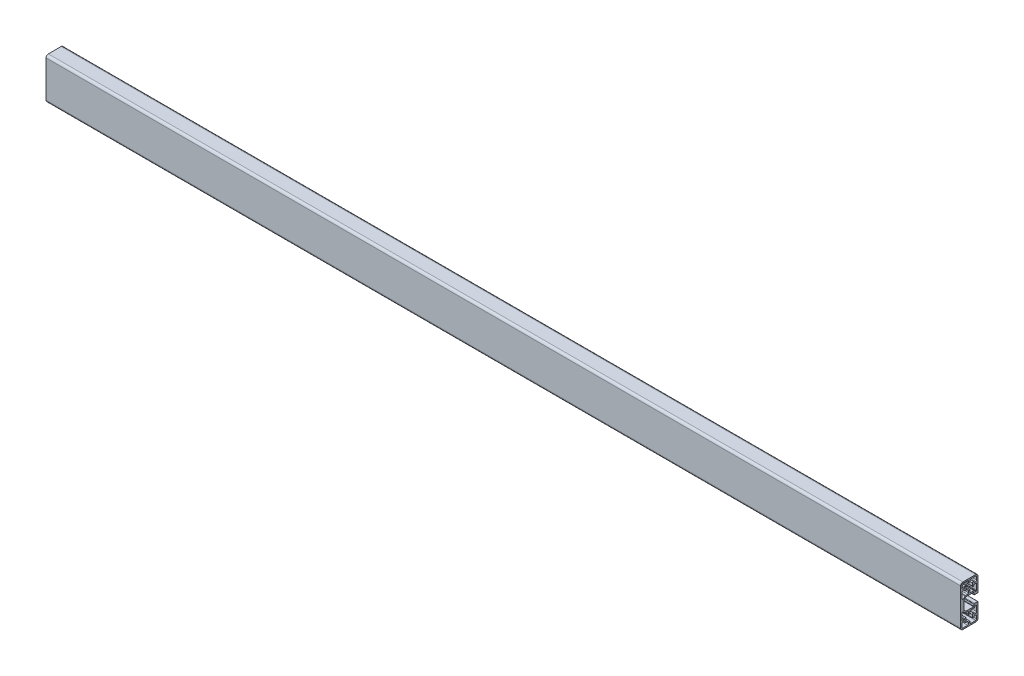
ISO-10303-21;
HEADER;
FILE_DESCRIPTION(('STEP AP214'),'2;1');
FILE_NAME('part.step','',(''),(''),'','','');
FILE_SCHEMA(('AUTOMOTIVE_DESIGN { 1 0 10303 214 1 1 1 1 }'));
ENDSEC;
DATA;
#1=APPLICATION_CONTEXT('core data for automotive mechanical design processes');
#2=APPLICATION_PROTOCOL_DEFINITION('international standard','automotive_design',2000,#1);
#3=PRODUCT_CONTEXT('',#1,'mechanical');
#4=PRODUCT('Part','Part','',(#3));
#5=PRODUCT_RELATED_PRODUCT_CATEGORY('part','',(#4));
#6=PRODUCT_DEFINITION_FORMATION('','',#4);
#7=PRODUCT_DEFINITION_CONTEXT('part definition',#1,'design');
#8=PRODUCT_DEFINITION('design','',#6,#7);
#9=PRODUCT_DEFINITION_SHAPE('','',#8);
#10=(LENGTH_UNIT() NAMED_UNIT(*) SI_UNIT(.MILLI.,.METRE.));
#11=(NAMED_UNIT(*) PLANE_ANGLE_UNIT() SI_UNIT($,.RADIAN.));
#12=(NAMED_UNIT(*) SI_UNIT($,.STERADIAN.) SOLID_ANGLE_UNIT());
#13=UNCERTAINTY_MEASURE_WITH_UNIT(LENGTH_MEASURE(1.E-05),#10,'distance_accuracy_value','');
#14=(GEOMETRIC_REPRESENTATION_CONTEXT(3) GLOBAL_UNCERTAINTY_ASSIGNED_CONTEXT((#13)) GLOBAL_UNIT_ASSIGNED_CONTEXT((#10,
#11,#12)) REPRESENTATION_CONTEXT('',''));
#15=CARTESIAN_POINT('',(0.,0.,0.));
#16=DIRECTION('',(0.,0.,1.));
#17=DIRECTION('',(1.,0.,0.));
#18=AXIS2_PLACEMENT_3D('',#15,#16,#17);
#19=CARTESIAN_POINT('',(1000.,-6.89409956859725,7.09997980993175));
#20=DIRECTION('',(-1.,0.,0.));
#21=DIRECTION('',(0.,0.,1.));
#22=AXIS2_PLACEMENT_3D('',#19,#20,#21);
#23=CYLINDRICAL_SURFACE('',#22,1.00000000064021);
#24=CARTESIAN_POINT('',(0.,-6.89409956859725,7.09997980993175));
#25=DIRECTION('',(1.,0.,0.));
#26=DIRECTION('',(0.,0.,-1.));
#27=AXIS2_PLACEMENT_3D('',#24,#25,#26);
#28=CIRCLE('',#27,1.00000000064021);
#29=CARTESIAN_POINT('',(0.,-6.18699278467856,6.39287303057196));
#30=VERTEX_POINT('',#29);
#31=CARTESIAN_POINT('',(0.,-6.89409956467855,8.09997981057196));
#32=VERTEX_POINT('',#31);
#33=EDGE_CURVE('E1228',#30,#32,#28,.T.);
#34=ORIENTED_EDGE('',*,*,#33,.F.);
#35=DIRECTION('',(-1.,0.,0.));
#36=VECTOR('',#35,1.);
#37=CARTESIAN_POINT('',(1000.,-6.18699278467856,6.39287303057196));
#38=LINE('',#37,#36);
#39=CARTESIAN_POINT('',(1000.,-6.18699278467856,6.39287303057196));
#40=VERTEX_POINT('',#39);
#41=EDGE_CURVE('E13',#40,#30,#38,.T.);
#42=ORIENTED_EDGE('',*,*,#41,.F.);
#43=CARTESIAN_POINT('',(1000.,-6.89409956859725,7.09997980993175));
#44=DIRECTION('',(1.,0.,0.));
#45=DIRECTION('',(0.,0.,-1.));
#46=AXIS2_PLACEMENT_3D('',#43,#44,#45);
#47=CIRCLE('',#46,1.00000000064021);
#48=CARTESIAN_POINT('',(1000.,-6.89409956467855,8.09997981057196));
#49=VERTEX_POINT('',#48);
#50=EDGE_CURVE('E2110',#40,#49,#47,.T.);
#51=ORIENTED_EDGE('',*,*,#50,.T.);
#52=DIRECTION('',(-1.,0.,0.));
#53=VECTOR('',#52,1.);
#54=CARTESIAN_POINT('',(1000.,-6.89409956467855,8.09997981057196));
#55=LINE('',#54,#53);
#56=EDGE_CURVE('E147',#49,#32,#55,.T.);
#57=ORIENTED_EDGE('',*,*,#56,.T.);
#58=EDGE_LOOP('',(#34,#42,#51,#57));
#59=FACE_BOUND('',#58,.T.);
#60=ADVANCED_FACE('F127',(#59),#23,.F.);
#61=CARTESIAN_POINT('',(1000.,-6.18699278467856,6.39287303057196));
#62=DIRECTION('',(0.,-0.707106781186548,0.707106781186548));
#63=DIRECTION('',(0.,-0.707106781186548,-0.707106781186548));
#64=AXIS2_PLACEMENT_3D('',#61,#62,#63);
#65=PLANE('',#64);
#66=DIRECTION('',(0.,0.707106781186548,0.707106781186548));
#67=VECTOR('',#66,1.);
#68=CARTESIAN_POINT('',(0.,-6.18699278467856,6.39287303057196));
#69=LINE('',#68,#67);
#70=CARTESIAN_POINT('',(0.,-7.90708373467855,4.67278208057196));
#71=VERTEX_POINT('',#70);
#72=EDGE_CURVE('E1231',#71,#30,#69,.T.);
#73=ORIENTED_EDGE('',*,*,#72,.F.);
#74=DIRECTION('',(-1.,0.,0.));
#75=VECTOR('',#74,1.);
#76=CARTESIAN_POINT('',(1000.,-7.90708373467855,4.67278208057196));
#77=LINE('',#76,#75);
#78=CARTESIAN_POINT('',(1000.,-7.90708373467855,4.67278208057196));
#79=VERTEX_POINT('',#78);
#80=EDGE_CURVE('E138',#79,#71,#77,.T.);
#81=ORIENTED_EDGE('',*,*,#80,.F.);
#82=DIRECTION('',(0.,0.707106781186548,0.707106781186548));
#83=VECTOR('',#82,1.);
#84=CARTESIAN_POINT('',(1000.,-6.18699278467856,6.39287303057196));
#85=LINE('',#84,#83);
#86=EDGE_CURVE('E2113',#79,#40,#85,.T.);
#87=ORIENTED_EDGE('',*,*,#86,.T.);
#88=ORIENTED_EDGE('',*,*,#41,.T.);
#89=EDGE_LOOP('',(#73,#81,#87,#88));
#90=FACE_BOUND('',#89,.T.);
#91=ADVANCED_FACE('F2309',(#90),#65,.T.);
#92=CARTESIAN_POINT('',(1000.,-7.19997692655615,3.9656752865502));
#93=DIRECTION('',(-1.,0.,0.));
#94=DIRECTION('',(0.,0.,1.));
#95=AXIS2_PLACEMENT_3D('',#92,#93,#94);
#96=CYLINDRICAL_SURFACE('',#95,1.00000002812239);
#97=CARTESIAN_POINT('',(0.,-7.19997692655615,3.9656752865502));
#98=DIRECTION('',(-1.,0.,0.));
#99=DIRECTION('',(0.,0.,-1.));
#100=AXIS2_PLACEMENT_3D('',#97,#98,#99);
#101=CIRCLE('',#100,1.00000002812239);
#102=CARTESIAN_POINT('',(0.,-8.19997695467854,3.96567530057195));
#103=VERTEX_POINT('',#102);
#104=EDGE_CURVE('E1235',#103,#71,#101,.T.);
#105=ORIENTED_EDGE('',*,*,#104,.F.);
#106=DIRECTION('',(-1.,0.,0.));
#107=VECTOR('',#106,1.);
#108=CARTESIAN_POINT('',(1000.,-8.19997695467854,3.96567530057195));
#109=LINE('',#108,#107);
#110=CARTESIAN_POINT('',(1000.,-8.19997695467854,3.96567530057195));
#111=VERTEX_POINT('',#110);
#112=EDGE_CURVE('E1553',#111,#103,#109,.T.);
#113=ORIENTED_EDGE('',*,*,#112,.F.);
#114=CARTESIAN_POINT('',(1000.,-7.19997692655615,3.9656752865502));
#115=DIRECTION('',(-1.,0.,0.));
#116=DIRECTION('',(0.,0.,-1.));
#117=AXIS2_PLACEMENT_3D('',#114,#115,#116);
#118=CIRCLE('',#117,1.00000002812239);
#119=EDGE_CURVE('E2117',#111,#79,#118,.T.);
#120=ORIENTED_EDGE('',*,*,#119,.T.);
#121=ORIENTED_EDGE('',*,*,#80,.T.);
#122=EDGE_LOOP('',(#105,#113,#120,#121));
#123=FACE_BOUND('',#122,.T.);
#124=ADVANCED_FACE('F2313',(#123),#96,.T.);
#125=CARTESIAN_POINT('',(1000.,-8.19997695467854,3.96567530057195));
#126=DIRECTION('',(0.,-1.,0.));
#127=DIRECTION('',(0.,0.,-1.));
#128=AXIS2_PLACEMENT_3D('',#125,#126,#127);
#129=PLANE('',#128);
#130=DIRECTION('',(0.,0.,1.));
#131=VECTOR('',#130,1.);
#132=CARTESIAN_POINT('',(0.,-8.19997695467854,3.96567530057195));
#133=LINE('',#132,#131);
#134=CARTESIAN_POINT('',(0.,-8.19997695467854,1.79997219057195));
#135=VERTEX_POINT('',#134);
#136=EDGE_CURVE('E1239',#135,#103,#133,.T.);
#137=ORIENTED_EDGE('',*,*,#136,.F.);
#138=DIRECTION('',(-1.,0.,0.));
#139=VECTOR('',#138,1.);
#140=CARTESIAN_POINT('',(1000.,-8.19997695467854,1.79997219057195));
#141=LINE('',#140,#139);
#142=CARTESIAN_POINT('',(1000.,-8.19997695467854,1.79997219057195));
#143=VERTEX_POINT('',#142);
#144=EDGE_CURVE('E1550',#143,#135,#141,.T.);
#145=ORIENTED_EDGE('',*,*,#144,.F.);
#146=DIRECTION('',(0.,0.,1.));
#147=VECTOR('',#146,1.);
#148=CARTESIAN_POINT('',(1000.,-8.19997695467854,3.96567530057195));
#149=LINE('',#148,#147);
#150=EDGE_CURVE('E2121',#143,#111,#149,.T.);
#151=ORIENTED_EDGE('',*,*,#150,.T.);
#152=ORIENTED_EDGE('',*,*,#112,.T.);
#153=EDGE_LOOP('',(#137,#145,#151,#152));
#154=FACE_BOUND('',#153,.T.);
#155=ADVANCED_FACE('F2981',(#154),#129,.T.);
#156=CARTESIAN_POINT('',(1000.,-9.19997695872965,1.79997219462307));
#157=DIRECTION('',(-1.,0.,0.));
#158=DIRECTION('',(0.,0.,1.));
#159=AXIS2_PLACEMENT_3D('',#156,#157,#158);
#160=CYLINDRICAL_SURFACE('',#159,1.00000000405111);
#161=CARTESIAN_POINT('',(0.,-9.19997695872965,1.79997219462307));
#162=DIRECTION('',(1.,0.,0.));
#163=DIRECTION('',(0.,0.,-1.));
#164=AXIS2_PLACEMENT_3D('',#161,#162,#163);
#165=CIRCLE('',#164,1.00000000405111);
#166=CARTESIAN_POINT('',(0.,-9.19997695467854,0.799972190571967));
#167=VERTEX_POINT('',#166);
#168=EDGE_CURVE('E1243',#167,#135,#165,.T.);
#169=ORIENTED_EDGE('',*,*,#168,.F.);
#170=DIRECTION('',(-1.,0.,0.));
#171=VECTOR('',#170,1.);
#172=CARTESIAN_POINT('',(1000.,-9.19997695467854,0.799972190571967));
#173=LINE('',#172,#171);
#174=CARTESIAN_POINT('',(1000.,-9.19997695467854,0.799972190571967));
#175=VERTEX_POINT('',#174);
#176=EDGE_CURVE('E1547',#175,#167,#173,.T.);
#177=ORIENTED_EDGE('',*,*,#176,.F.);
#178=CARTESIAN_POINT('',(1000.,-9.19997695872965,1.79997219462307));
#179=DIRECTION('',(1.,0.,0.));
#180=DIRECTION('',(0.,0.,-1.));
#181=AXIS2_PLACEMENT_3D('',#178,#179,#180);
#182=CIRCLE('',#181,1.00000000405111);
#183=EDGE_CURVE('E2125',#175,#143,#182,.T.);
#184=ORIENTED_EDGE('',*,*,#183,.T.);
#185=ORIENTED_EDGE('',*,*,#144,.T.);
#186=EDGE_LOOP('',(#169,#177,#184,#185));
#187=FACE_BOUND('',#186,.T.);
#188=ADVANCED_FACE('F2974',(#187),#160,.F.);
#189=CARTESIAN_POINT('',(1000.,-9.19997695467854,0.799972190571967));
#190=DIRECTION('',(0.,0.,1.));
#191=DIRECTION('',(1.,0.,0.));
#192=AXIS2_PLACEMENT_3D('',#189,#190,#191);
#193=PLANE('',#192);
#194=DIRECTION('',(0.,1.,0.));
#195=VECTOR('',#194,1.);
#196=CARTESIAN_POINT('',(0.,-9.19997695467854,0.799972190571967));
#197=LINE('',#196,#195);
#198=CARTESIAN_POINT('',(0.,-11.4131200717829,0.799972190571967));
#199=VERTEX_POINT('',#198);
#200=EDGE_CURVE('E1247',#199,#167,#197,.T.);
#201=ORIENTED_EDGE('',*,*,#200,.F.);
#202=DIRECTION('',(-1.,0.,0.));
#203=VECTOR('',#202,1.);
#204=CARTESIAN_POINT('',(1000.,-11.4131200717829,0.799972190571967));
#205=LINE('',#204,#203);
#206=CARTESIAN_POINT('',(1000.,-11.4131200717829,0.799972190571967));
#207=VERTEX_POINT('',#206);
#208=EDGE_CURVE('E1544',#207,#199,#205,.T.);
#209=ORIENTED_EDGE('',*,*,#208,.F.);
#210=DIRECTION('',(0.,1.,0.));
#211=VECTOR('',#210,1.);
#212=CARTESIAN_POINT('',(1000.,-9.19997695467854,0.799972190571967));
#213=LINE('',#212,#211);
#214=EDGE_CURVE('E2129',#207,#175,#213,.T.);
#215=ORIENTED_EDGE('',*,*,#214,.T.);
#216=ORIENTED_EDGE('',*,*,#176,.T.);
#217=EDGE_LOOP('',(#201,#209,#215,#216));
#218=FACE_BOUND('',#217,.T.);
#219=ADVANCED_FACE('F2967',(#218),#193,.T.);
#220=CARTESIAN_POINT('',(1000.,-14.9999884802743,-2.78220318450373E-05));
#221=DIRECTION('',(-1.,0.,0.));
#222=DIRECTION('',(0.,0.,1.));
#223=AXIS2_PLACEMENT_3D('',#220,#221,#222);
#224=CYLINDRICAL_SURFACE('',#223,3.675);
#225=CARTESIAN_POINT('',(0.,-14.9999884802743,-2.78220318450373E-05));
#226=DIRECTION('',(1.,0.,0.));
#227=DIRECTION('',(0.,0.,-1.));
#228=AXIS2_PLACEMENT_3D('',#225,#226,#227);
#229=CIRCLE('',#228,3.675);
#230=CARTESIAN_POINT('',(0.,-11.4131200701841,-0.80002782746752));
#231=VERTEX_POINT('',#230);
#232=EDGE_CURVE('E1251',#231,#199,#229,.T.);
#233=ORIENTED_EDGE('',*,*,#232,.F.);
#234=DIRECTION('',(-1.,0.,0.));
#235=VECTOR('',#234,1.);
#236=CARTESIAN_POINT('',(1000.,-11.4131200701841,-0.80002782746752));
#237=LINE('',#236,#235);
#238=CARTESIAN_POINT('',(1000.,-11.4131200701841,-0.80002782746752));
#239=VERTEX_POINT('',#238);
#240=EDGE_CURVE('E1541',#239,#231,#237,.T.);
#241=ORIENTED_EDGE('',*,*,#240,.F.);
#242=CARTESIAN_POINT('',(1000.,-14.9999884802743,-2.78220318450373E-05));
#243=DIRECTION('',(1.,0.,0.));
#244=DIRECTION('',(0.,0.,-1.));
#245=AXIS2_PLACEMENT_3D('',#242,#243,#244);
#246=CIRCLE('',#245,3.675);
#247=EDGE_CURVE('E2133',#239,#207,#246,.T.);
#248=ORIENTED_EDGE('',*,*,#247,.T.);
#249=ORIENTED_EDGE('',*,*,#208,.T.);
#250=EDGE_LOOP('',(#233,#241,#248,#249));
#251=FACE_BOUND('',#250,.T.);
#252=ADVANCED_FACE('F2960',(#251),#224,.F.);
#253=CARTESIAN_POINT('',(1000.,-11.4131200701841,-0.80002782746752));
#254=DIRECTION('',(0.,0.,-1.));
#255=DIRECTION('',(-1.,0.,0.));
#256=AXIS2_PLACEMENT_3D('',#253,#254,#255);
#257=PLANE('',#256);
#258=DIRECTION('',(0.,-1.,0.));
#259=VECTOR('',#258,1.);
#260=CARTESIAN_POINT('',(0.,-11.4131200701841,-0.80002782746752));
#261=LINE('',#260,#259);
#262=CARTESIAN_POINT('',(0.,-9.19997695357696,-0.800027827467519));
#263=VERTEX_POINT('',#262);
#264=EDGE_CURVE('E1255',#263,#231,#261,.T.);
#265=ORIENTED_EDGE('',*,*,#264,.F.);
#266=DIRECTION('',(-1.,0.,0.));
#267=VECTOR('',#266,1.);
#268=CARTESIAN_POINT('',(1000.,-9.19997695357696,-0.800027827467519));
#269=LINE('',#268,#267);
#270=CARTESIAN_POINT('',(1000.,-9.19997695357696,-0.800027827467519));
#271=VERTEX_POINT('',#270);
#272=EDGE_CURVE('E1538',#271,#263,#269,.T.);
#273=ORIENTED_EDGE('',*,*,#272,.F.);
#274=DIRECTION('',(0.,-1.,0.));
#275=VECTOR('',#274,1.);
#276=CARTESIAN_POINT('',(1000.,-11.4131200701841,-0.80002782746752));
#277=LINE('',#276,#275);
#278=EDGE_CURVE('E2137',#271,#239,#277,.T.);
#279=ORIENTED_EDGE('',*,*,#278,.T.);
#280=ORIENTED_EDGE('',*,*,#240,.T.);
#281=EDGE_LOOP('',(#265,#273,#279,#280));
#282=FACE_BOUND('',#281,.T.);
#283=ADVANCED_FACE('F2953',(#282),#257,.T.);
#284=CARTESIAN_POINT('',(1000.,-9.19997695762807,-1.80002783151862));
#285=DIRECTION('',(-1.,0.,0.));
#286=DIRECTION('',(0.,0.,1.));
#287=AXIS2_PLACEMENT_3D('',#284,#285,#286);
#288=CYLINDRICAL_SURFACE('',#287,1.0000000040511);
#289=CARTESIAN_POINT('',(0.,-9.19997695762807,-1.80002783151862));
#290=DIRECTION('',(1.,0.,0.));
#291=DIRECTION('',(0.,0.,-1.));
#292=AXIS2_PLACEMENT_3D('',#289,#290,#291);
#293=CIRCLE('',#292,1.0000000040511);
#294=CARTESIAN_POINT('',(0.,-8.19997695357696,-1.80002782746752));
#295=VERTEX_POINT('',#294);
#296=EDGE_CURVE('E1259',#295,#263,#293,.T.);
#297=ORIENTED_EDGE('',*,*,#296,.F.);
#298=DIRECTION('',(-1.,0.,0.));
#299=VECTOR('',#298,1.);
#300=CARTESIAN_POINT('',(1000.,-8.19997695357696,-1.80002782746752));
#301=LINE('',#300,#299);
#302=CARTESIAN_POINT('',(1000.,-8.19997695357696,-1.80002782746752));
#303=VERTEX_POINT('',#302);
#304=EDGE_CURVE('E1535',#303,#295,#301,.T.);
#305=ORIENTED_EDGE('',*,*,#304,.F.);
#306=CARTESIAN_POINT('',(1000.,-9.19997695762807,-1.80002783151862));
#307=DIRECTION('',(1.,0.,0.));
#308=DIRECTION('',(0.,0.,-1.));
#309=AXIS2_PLACEMENT_3D('',#306,#307,#308);
#310=CIRCLE('',#309,1.0000000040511);
#311=EDGE_CURVE('E2141',#303,#271,#310,.T.);
#312=ORIENTED_EDGE('',*,*,#311,.T.);
#313=ORIENTED_EDGE('',*,*,#272,.T.);
#314=EDGE_LOOP('',(#297,#305,#312,#313));
#315=FACE_BOUND('',#314,.T.);
#316=ADVANCED_FACE('F2946',(#315),#288,.F.);
#317=CARTESIAN_POINT('',(1000.,-8.19997695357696,-1.80002782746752));
#318=DIRECTION('',(0.,-1.,0.));
#319=DIRECTION('',(0.,0.,-1.));
#320=AXIS2_PLACEMENT_3D('',#317,#318,#319);
#321=PLANE('',#320);
#322=DIRECTION('',(0.,0.,1.));
#323=VECTOR('',#322,1.);
#324=CARTESIAN_POINT('',(0.,-8.19997695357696,-1.80002782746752));
#325=LINE('',#324,#323);
#326=CARTESIAN_POINT('',(0.,-8.19997695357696,-5.00004305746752));
#327=VERTEX_POINT('',#326);
#328=EDGE_CURVE('E1263',#327,#295,#325,.T.);
#329=ORIENTED_EDGE('',*,*,#328,.F.);
#330=DIRECTION('',(-1.,0.,0.));
#331=VECTOR('',#330,1.);
#332=CARTESIAN_POINT('',(1000.,-8.19997695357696,-5.00004305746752));
#333=LINE('',#332,#331);
#334=CARTESIAN_POINT('',(1000.,-8.19997695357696,-5.00004305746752));
#335=VERTEX_POINT('',#334);
#336=EDGE_CURVE('E1532',#335,#327,#333,.T.);
#337=ORIENTED_EDGE('',*,*,#336,.F.);
#338=DIRECTION('',(0.,0.,1.));
#339=VECTOR('',#338,1.);
#340=CARTESIAN_POINT('',(1000.,-8.19997695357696,-1.80002782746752));
#341=LINE('',#340,#339);
#342=EDGE_CURVE('E2145',#335,#303,#341,.T.);
#343=ORIENTED_EDGE('',*,*,#342,.T.);
#344=ORIENTED_EDGE('',*,*,#304,.T.);
#345=EDGE_LOOP('',(#329,#337,#343,#344));
#346=FACE_BOUND('',#345,.T.);
#347=ADVANCED_FACE('F2939',(#346),#321,.T.);
#348=CARTESIAN_POINT('',(1000.,-6.79997694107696,-5.00004304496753));
#349=DIRECTION('',(-1.,0.,0.));
#350=DIRECTION('',(0.,0.,1.));
#351=AXIS2_PLACEMENT_3D('',#348,#349,#350);
#352=CYLINDRICAL_SURFACE('',#351,1.4000000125);
#353=CARTESIAN_POINT('',(0.,-6.79997694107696,-5.00004304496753));
#354=DIRECTION('',(-1.,0.,0.));
#355=DIRECTION('',(0.,0.,-1.));
#356=AXIS2_PLACEMENT_3D('',#353,#354,#355);
#357=CIRCLE('',#356,1.4000000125);
#358=CARTESIAN_POINT('',(0.,-6.79997695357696,-6.40004305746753));
#359=VERTEX_POINT('',#358);
#360=EDGE_CURVE('E1267',#359,#327,#357,.T.);
#361=ORIENTED_EDGE('',*,*,#360,.F.);
#362=DIRECTION('',(-1.,0.,0.));
#363=VECTOR('',#362,1.);
#364=CARTESIAN_POINT('',(1000.,-6.79997695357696,-6.40004305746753));
#365=LINE('',#364,#363);
#366=CARTESIAN_POINT('',(1000.,-6.79997695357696,-6.40004305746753));
#367=VERTEX_POINT('',#366);
#368=EDGE_CURVE('E1529',#367,#359,#365,.T.);
#369=ORIENTED_EDGE('',*,*,#368,.F.);
#370=CARTESIAN_POINT('',(1000.,-6.79997694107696,-5.00004304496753));
#371=DIRECTION('',(-1.,0.,0.));
#372=DIRECTION('',(0.,0.,-1.));
#373=AXIS2_PLACEMENT_3D('',#370,#371,#372);
#374=CIRCLE('',#373,1.4000000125);
#375=EDGE_CURVE('E2149',#367,#335,#374,.T.);
#376=ORIENTED_EDGE('',*,*,#375,.T.);
#377=ORIENTED_EDGE('',*,*,#336,.T.);
#378=EDGE_LOOP('',(#361,#369,#376,#377));
#379=FACE_BOUND('',#378,.T.);
#380=ADVANCED_FACE('F2932',(#379),#352,.T.);
#381=CARTESIAN_POINT('',(1000.,-6.79998852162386,-6.70004305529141));
#382=DIRECTION('',(-1.,0.,0.));
#383=DIRECTION('',(0.,0.,1.));
#384=AXIS2_PLACEMENT_3D('',#381,#382,#383);
#385=CYLINDRICAL_SURFACE('',#384,0.299999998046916);
#386=CARTESIAN_POINT('',(0.,-6.79998852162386,-6.70004305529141));
#387=DIRECTION('',(1.,0.,0.));
#388=DIRECTION('',(0.,0.,-1.));
#389=AXIS2_PLACEMENT_3D('',#386,#387,#388);
#390=CIRCLE('',#389,0.299999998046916);
#391=CARTESIAN_POINT('',(0.,-6.49998852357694,-6.70004305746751));
#392=VERTEX_POINT('',#391);
#393=EDGE_CURVE('E1271',#392,#359,#390,.T.);
#394=ORIENTED_EDGE('',*,*,#393,.F.);
#395=DIRECTION('',(-1.,0.,0.));
#396=VECTOR('',#395,1.);
#397=CARTESIAN_POINT('',(1000.,-6.49998852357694,-6.70004305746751));
#398=LINE('',#397,#396);
#399=CARTESIAN_POINT('',(1000.,-6.49998852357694,-6.70004305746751));
#400=VERTEX_POINT('',#399);
#401=EDGE_CURVE('E1526',#400,#392,#398,.T.);
#402=ORIENTED_EDGE('',*,*,#401,.F.);
#403=CARTESIAN_POINT('',(1000.,-6.79998852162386,-6.70004305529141));
#404=DIRECTION('',(1.,0.,0.));
#405=DIRECTION('',(0.,0.,-1.));
#406=AXIS2_PLACEMENT_3D('',#403,#404,#405);
#407=CIRCLE('',#406,0.299999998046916);
#408=EDGE_CURVE('E2153',#400,#367,#407,.T.);
#409=ORIENTED_EDGE('',*,*,#408,.T.);
#410=ORIENTED_EDGE('',*,*,#368,.T.);
#411=EDGE_LOOP('',(#394,#402,#409,#410));
#412=FACE_BOUND('',#411,.T.);
#413=ADVANCED_FACE('F2925',(#412),#385,.F.);
#414=CARTESIAN_POINT('',(1000.,-6.49998852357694,-6.70004305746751));
#415=DIRECTION('',(0.,-1.,0.));
#416=DIRECTION('',(0.,0.,-1.));
#417=AXIS2_PLACEMENT_3D('',#414,#415,#416);
#418=PLANE('',#417);
#419=DIRECTION('',(0.,0.,1.));
#420=VECTOR('',#419,1.);
#421=CARTESIAN_POINT('',(0.,-6.49998852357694,-6.70004305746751));
#422=LINE('',#421,#420);
#423=CARTESIAN_POINT('',(0.,-6.49998852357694,-7.80003544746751));
#424=VERTEX_POINT('',#423);
#425=EDGE_CURVE('E1275',#424,#392,#422,.T.);
#426=ORIENTED_EDGE('',*,*,#425,.F.);
#427=DIRECTION('',(-1.,0.,0.));
#428=VECTOR('',#427,1.);
#429=CARTESIAN_POINT('',(1000.,-6.49998852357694,-7.80003544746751));
#430=LINE('',#429,#428);
#431=CARTESIAN_POINT('',(1000.,-6.49998852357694,-7.80003544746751));
#432=VERTEX_POINT('',#431);
#433=EDGE_CURVE('E1523',#432,#424,#430,.T.);
#434=ORIENTED_EDGE('',*,*,#433,.F.);
#435=DIRECTION('',(0.,0.,1.));
#436=VECTOR('',#435,1.);
#437=CARTESIAN_POINT('',(1000.,-6.49998852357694,-6.70004305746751));
#438=LINE('',#437,#436);
#439=EDGE_CURVE('E2157',#432,#400,#438,.T.);
#440=ORIENTED_EDGE('',*,*,#439,.T.);
#441=ORIENTED_EDGE('',*,*,#401,.T.);
#442=EDGE_LOOP('',(#426,#434,#440,#441));
#443=FACE_BOUND('',#442,.T.);
#444=ADVANCED_FACE('F2918',(#443),#418,.T.);
#445=CARTESIAN_POINT('',(1000.,-6.79998853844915,-7.80003542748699));
#446=DIRECTION('',(-1.,0.,0.));
#447=DIRECTION('',(0.,0.,1.));
#448=AXIS2_PLACEMENT_3D('',#445,#446,#447);
#449=CYLINDRICAL_SURFACE('',#448,0.300000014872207);
#450=CARTESIAN_POINT('',(0.,-6.79998853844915,-7.80003542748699));
#451=DIRECTION('',(1.,0.,0.));
#452=DIRECTION('',(0.,0.,-1.));
#453=AXIS2_PLACEMENT_3D('',#450,#451,#452);
#454=CIRCLE('',#453,0.300000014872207);
#455=CARTESIAN_POINT('',(0.,-6.79998852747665,-8.1000354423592));
#456=VERTEX_POINT('',#455);
#457=EDGE_CURVE('E1279',#456,#424,#454,.T.);
#458=ORIENTED_EDGE('',*,*,#457,.F.);
#459=DIRECTION('',(-1.,0.,0.));
#460=VECTOR('',#459,1.);
#461=CARTESIAN_POINT('',(1000.,-6.79998852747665,-8.1000354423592));
#462=LINE('',#461,#460);
#463=CARTESIAN_POINT('',(1000.,-6.79998852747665,-8.1000354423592));
#464=VERTEX_POINT('',#463);
#465=EDGE_CURVE('E1520',#464,#456,#462,.T.);
#466=ORIENTED_EDGE('',*,*,#465,.F.);
#467=CARTESIAN_POINT('',(1000.,-6.79998853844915,-7.80003542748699));
#468=DIRECTION('',(1.,0.,0.));
#469=DIRECTION('',(0.,0.,-1.));
#470=AXIS2_PLACEMENT_3D('',#467,#468,#469);
#471=CIRCLE('',#470,0.300000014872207);
#472=EDGE_CURVE('E2161',#464,#432,#471,.T.);
#473=ORIENTED_EDGE('',*,*,#472,.T.);
#474=ORIENTED_EDGE('',*,*,#433,.T.);
#475=EDGE_LOOP('',(#458,#466,#473,#474));
#476=FACE_BOUND('',#475,.T.);
#477=ADVANCED_FACE('F2911',(#476),#449,.F.);
#478=CARTESIAN_POINT('',(1000.,-6.79998852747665,-8.1000354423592));
#479=DIRECTION('',(0.,0.,1.));
#480=DIRECTION('',(1.,0.,0.));
#481=AXIS2_PLACEMENT_3D('',#478,#479,#480);
#482=PLANE('',#481);
#483=DIRECTION('',(0.,1.,0.));
#484=VECTOR('',#483,1.);
#485=CARTESIAN_POINT('',(0.,-6.79998852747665,-8.1000354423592));
#486=LINE('',#485,#484);
#487=CARTESIAN_POINT('',(0.,-13.1999885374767,-8.1000354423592));
#488=VERTEX_POINT('',#487);
#489=EDGE_CURVE('E1283',#488,#456,#486,.T.);
#490=ORIENTED_EDGE('',*,*,#489,.F.);
#491=DIRECTION('',(-1.,0.,0.));
#492=VECTOR('',#491,1.);
#493=CARTESIAN_POINT('',(1000.,-13.1999885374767,-8.1000354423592));
#494=LINE('',#493,#492);
#495=CARTESIAN_POINT('',(1000.,-13.1999885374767,-8.1000354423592));
#496=VERTEX_POINT('',#495);
#497=EDGE_CURVE('E1517',#496,#488,#494,.T.);
#498=ORIENTED_EDGE('',*,*,#497,.F.);
#499=DIRECTION('',(0.,1.,0.));
#500=VECTOR('',#499,1.);
#501=CARTESIAN_POINT('',(1000.,-6.79998852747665,-8.1000354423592));
#502=LINE('',#501,#500);
#503=EDGE_CURVE('E2165',#496,#464,#502,.T.);
#504=ORIENTED_EDGE('',*,*,#503,.T.);
#505=ORIENTED_EDGE('',*,*,#465,.T.);
#506=EDGE_LOOP('',(#490,#498,#504,#505));
#507=FACE_BOUND('',#506,.T.);
#508=ADVANCED_FACE('F2904',(#507),#482,.T.);
#509=CARTESIAN_POINT('',(1000.,-13.1999885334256,-7.10003543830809));
#510=DIRECTION('',(-1.,0.,0.));
#511=DIRECTION('',(0.,0.,1.));
#512=AXIS2_PLACEMENT_3D('',#509,#510,#511);
#513=CYLINDRICAL_SURFACE('',#512,1.0000000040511);
#514=CARTESIAN_POINT('',(0.,-13.1999885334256,-7.10003543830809));
#515=DIRECTION('',(1.,0.,0.));
#516=DIRECTION('',(0.,0.,-1.));
#517=AXIS2_PLACEMENT_3D('',#514,#515,#516);
#518=CIRCLE('',#517,1.0000000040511);
#519=CARTESIAN_POINT('',(0.,-14.1999885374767,-7.10003544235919));
#520=VERTEX_POINT('',#519);
#521=EDGE_CURVE('E1287',#520,#488,#518,.T.);
#522=ORIENTED_EDGE('',*,*,#521,.F.);
#523=DIRECTION('',(-1.,0.,0.));
#524=VECTOR('',#523,1.);
#525=CARTESIAN_POINT('',(1000.,-14.1999885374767,-7.10003544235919));
#526=LINE('',#525,#524);
#527=CARTESIAN_POINT('',(1000.,-14.1999885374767,-7.10003544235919));
#528=VERTEX_POINT('',#527);
#529=EDGE_CURVE('E1514',#528,#520,#526,.T.);
#530=ORIENTED_EDGE('',*,*,#529,.F.);
#531=CARTESIAN_POINT('',(1000.,-13.1999885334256,-7.10003543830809));
#532=DIRECTION('',(1.,0.,0.));
#533=DIRECTION('',(0.,0.,-1.));
#534=AXIS2_PLACEMENT_3D('',#531,#532,#533);
#535=CIRCLE('',#534,1.0000000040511);
#536=EDGE_CURVE('E2169',#528,#496,#535,.T.);
#537=ORIENTED_EDGE('',*,*,#536,.T.);
#538=ORIENTED_EDGE('',*,*,#497,.T.);
#539=EDGE_LOOP('',(#522,#530,#537,#538));
#540=FACE_BOUND('',#539,.T.);
#541=ADVANCED_FACE('F2897',(#540),#513,.F.);
#542=CARTESIAN_POINT('',(1000.,-14.1999885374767,-7.10003544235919));
#543=DIRECTION('',(0.,0.999999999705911,-2.42523977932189E-05));
#544=DIRECTION('',(0.,2.42523977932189E-05,0.999999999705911));
#545=AXIS2_PLACEMENT_3D('',#542,#543,#544);
#546=PLANE('',#545);
#547=DIRECTION('',(0.,-2.42523977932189E-05,-0.999999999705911));
#548=VECTOR('',#547,1.);
#549=CARTESIAN_POINT('',(0.,-14.1999885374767,-7.10003544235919));
#550=LINE('',#549,#548);
#551=CARTESIAN_POINT('',(0.,-14.1999527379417,-5.62391191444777));
#552=VERTEX_POINT('',#551);
#553=EDGE_CURVE('E1291',#552,#520,#550,.T.);
#554=ORIENTED_EDGE('',*,*,#553,.F.);
#555=DIRECTION('',(-1.,0.,0.));
#556=VECTOR('',#555,1.);
#557=CARTESIAN_POINT('',(1000.,-14.1999527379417,-5.62391191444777));
#558=LINE('',#557,#556);
#559=CARTESIAN_POINT('',(1000.,-14.1999527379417,-5.62391191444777));
#560=VERTEX_POINT('',#559);
#561=EDGE_CURVE('E1511',#560,#552,#558,.T.);
#562=ORIENTED_EDGE('',*,*,#561,.F.);
#563=DIRECTION('',(0.,-2.42523977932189E-05,-0.999999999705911));
#564=VECTOR('',#563,1.);
#565=CARTESIAN_POINT('',(1000.,-14.1999885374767,-7.10003544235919));
#566=LINE('',#565,#564);
#567=EDGE_CURVE('E2173',#560,#528,#566,.T.);
#568=ORIENTED_EDGE('',*,*,#567,.T.);
#569=ORIENTED_EDGE('',*,*,#529,.T.);
#570=EDGE_LOOP('',(#554,#562,#568,#569));
#571=FACE_BOUND('',#570,.T.);
#572=ADVANCED_FACE('F2890',(#571),#546,.T.);
#573=CARTESIAN_POINT('',(1000.,-13.699952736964,-5.62391191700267));
#574=DIRECTION('',(-1.,0.,0.));
#575=DIRECTION('',(0.,0.,1.));
#576=AXIS2_PLACEMENT_3D('',#573,#574,#575);
#577=CYLINDRICAL_SURFACE('',#576,0.500000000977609);
#578=CARTESIAN_POINT('',(0.,-13.699952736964,-5.62391191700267));
#579=DIRECTION('',(1.,0.,0.));
#580=DIRECTION('',(0.,0.,-1.));
#581=AXIS2_PLACEMENT_3D('',#578,#579,#580);
#582=CIRCLE('',#581,0.500000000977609);
#583=CARTESIAN_POINT('',(0.,-13.8110638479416,-5.13641389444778));
#584=VERTEX_POINT('',#583);
#585=EDGE_CURVE('E1295',#584,#552,#582,.T.);
#586=ORIENTED_EDGE('',*,*,#585,.F.);
#587=DIRECTION('',(-1.,0.,0.));
#588=VECTOR('',#587,1.);
#589=CARTESIAN_POINT('',(1000.,-13.8110638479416,-5.13641389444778));
#590=LINE('',#589,#588);
#591=CARTESIAN_POINT('',(1000.,-13.8110638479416,-5.13641389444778));
#592=VERTEX_POINT('',#591);
#593=EDGE_CURVE('E1508',#592,#584,#590,.T.);
#594=ORIENTED_EDGE('',*,*,#593,.F.);
#595=CARTESIAN_POINT('',(1000.,-13.699952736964,-5.62391191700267));
#596=DIRECTION('',(1.,0.,0.));
#597=DIRECTION('',(0.,0.,-1.));
#598=AXIS2_PLACEMENT_3D('',#595,#596,#597);
#599=CIRCLE('',#598,0.500000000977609);
#600=EDGE_CURVE('E2177',#592,#560,#599,.T.);
#601=ORIENTED_EDGE('',*,*,#600,.T.);
#602=ORIENTED_EDGE('',*,*,#561,.T.);
#603=EDGE_LOOP('',(#586,#594,#601,#602));
#604=FACE_BOUND('',#603,.T.);
#605=ADVANCED_FACE('F2883',(#604),#577,.F.);
#606=CARTESIAN_POINT('',(1000.,-14.9999526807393,0.0798149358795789));
#607=DIRECTION('',(-1.,0.,0.));
#608=DIRECTION('',(0.,0.,1.));
#609=AXIS2_PLACEMENT_3D('',#606,#607,#608);
#610=CYLINDRICAL_SURFACE('',#609,5.34999998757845);
#611=CARTESIAN_POINT('',(0.,-14.9999526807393,0.0798149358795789));
#612=DIRECTION('',(-1.,0.,0.));
#613=DIRECTION('',(0.,0.,-1.));
#614=AXIS2_PLACEMENT_3D('',#611,#612,#613);
#615=CIRCLE('',#614,5.34999998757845);
#616=CARTESIAN_POINT('',(0.,-13.1812598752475,-4.95157218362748));
#617=VERTEX_POINT('',#616);
#618=EDGE_CURVE('E1299',#617,#584,#615,.T.);
#619=ORIENTED_EDGE('',*,*,#618,.F.);
#620=DIRECTION('',(-1.,0.,0.));
#621=VECTOR('',#620,1.);
#622=CARTESIAN_POINT('',(1000.,-13.1812598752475,-4.95157218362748));
#623=LINE('',#622,#621);
#624=CARTESIAN_POINT('',(1000.,-13.1812598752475,-4.95157218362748));
#625=VERTEX_POINT('',#624);
#626=EDGE_CURVE('E1505',#625,#617,#623,.T.);
#627=ORIENTED_EDGE('',*,*,#626,.F.);
#628=CARTESIAN_POINT('',(1000.,-14.9999526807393,0.0798149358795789));
#629=DIRECTION('',(-1.,0.,0.));
#630=DIRECTION('',(0.,0.,-1.));
#631=AXIS2_PLACEMENT_3D('',#628,#629,#630);
#632=CIRCLE('',#631,5.34999998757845);
#633=EDGE_CURVE('E2181',#625,#592,#632,.T.);
#634=ORIENTED_EDGE('',*,*,#633,.T.);
#635=ORIENTED_EDGE('',*,*,#593,.T.);
#636=EDGE_LOOP('',(#619,#627,#634,#635));
#637=FACE_BOUND('',#636,.T.);
#638=ADVANCED_FACE('F2876',(#637),#610,.T.);
#639=CARTESIAN_POINT('',(1000.,-13.4532081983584,-4.1991998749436));
#640=DIRECTION('',(-1.,0.,0.));
#641=DIRECTION('',(0.,0.,1.));
#642=AXIS2_PLACEMENT_3D('',#639,#640,#641);
#643=CYLINDRICAL_SURFACE('',#642,0.800012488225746);
#644=CARTESIAN_POINT('',(0.,-13.4532081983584,-4.1991998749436));
#645=DIRECTION('',(-1.,0.,0.));
#646=DIRECTION('',(0.,0.,-1.));
#647=AXIS2_PLACEMENT_3D('',#644,#645,#646);
#648=CIRCLE('',#647,0.800012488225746);
#649=CARTESIAN_POINT('',(0.,-13.7251565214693,-3.44682756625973));
#650=VERTEX_POINT('',#649);
#651=EDGE_CURVE('E1303',#650,#617,#648,.T.);
#652=ORIENTED_EDGE('',*,*,#651,.F.);
#653=DIRECTION('',(-1.,0.,0.));
#654=VECTOR('',#653,1.);
#655=CARTESIAN_POINT('',(1000.,-13.7251565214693,-3.44682756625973));
#656=LINE('',#655,#654);
#657=CARTESIAN_POINT('',(1000.,-13.7251565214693,-3.44682756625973));
#658=VERTEX_POINT('',#657);
#659=EDGE_CURVE('E1502',#658,#650,#656,.T.);
#660=ORIENTED_EDGE('',*,*,#659,.F.);
#661=CARTESIAN_POINT('',(1000.,-13.4532081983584,-4.1991998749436));
#662=DIRECTION('',(-1.,0.,0.));
#663=DIRECTION('',(0.,0.,-1.));
#664=AXIS2_PLACEMENT_3D('',#661,#662,#663);
#665=CIRCLE('',#664,0.800012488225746);
#666=EDGE_CURVE('E2185',#658,#625,#665,.T.);
#667=ORIENTED_EDGE('',*,*,#666,.T.);
#668=ORIENTED_EDGE('',*,*,#626,.T.);
#669=EDGE_LOOP('',(#652,#660,#667,#668));
#670=FACE_BOUND('',#669,.T.);
#671=ADVANCED_FACE('F2869',(#670),#643,.T.);
#672=CARTESIAN_POINT('',(1000.,-14.9999884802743,-2.78220318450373E-05));
#673=DIRECTION('',(-1.,0.,0.));
#674=DIRECTION('',(0.,0.,1.));
#675=AXIS2_PLACEMENT_3D('',#672,#673,#674);
#676=CYLINDRICAL_SURFACE('',#675,3.675);
#677=CARTESIAN_POINT('',(0.,-14.9999884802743,-2.78220318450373E-05));
#678=DIRECTION('',(1.,0.,0.));
#679=DIRECTION('',(0.,0.,-1.));
#680=AXIS2_PLACEMENT_3D('',#677,#678,#679);
#681=CIRCLE('',#680,3.675);
#682=CARTESIAN_POINT('',(0.,-16.2747374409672,-3.44685826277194));
#683=VERTEX_POINT('',#682);
#684=EDGE_CURVE('E1307',#683,#650,#681,.T.);
#685=ORIENTED_EDGE('',*,*,#684,.F.);
#686=DIRECTION('',(-1.,0.,0.));
#687=VECTOR('',#686,1.);
#688=CARTESIAN_POINT('',(1000.,-16.2747374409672,-3.44685826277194));
#689=LINE('',#688,#687);
#690=CARTESIAN_POINT('',(1000.,-16.2747374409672,-3.44685826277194));
#691=VERTEX_POINT('',#690);
#692=EDGE_CURVE('E1499',#691,#683,#689,.T.);
#693=ORIENTED_EDGE('',*,*,#692,.F.);
#694=CARTESIAN_POINT('',(1000.,-14.9999884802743,-2.78220318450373E-05));
#695=DIRECTION('',(1.,0.,0.));
#696=DIRECTION('',(0.,0.,-1.));
#697=AXIS2_PLACEMENT_3D('',#694,#695,#696);
#698=CIRCLE('',#697,3.675);
#699=EDGE_CURVE('E2189',#691,#658,#698,.T.);
#700=ORIENTED_EDGE('',*,*,#699,.T.);
#701=ORIENTED_EDGE('',*,*,#659,.T.);
#702=EDGE_LOOP('',(#685,#693,#700,#701));
#703=FACE_BOUND('',#702,.T.);
#704=ADVANCED_FACE('F2862',(#703),#676,.F.);
#705=CARTESIAN_POINT('',(1000.,-16.5466915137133,-4.19921522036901));
#706=DIRECTION('',(-1.,0.,0.));
#707=DIRECTION('',(0.,0.,1.));
#708=AXIS2_PLACEMENT_3D('',#705,#706,#707);
#709=CYLINDRICAL_SURFACE('',#708,0.80000000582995);
#710=CARTESIAN_POINT('',(0.,-16.5466915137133,-4.19921522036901));
#711=DIRECTION('',(-1.,0.,0.));
#712=DIRECTION('',(0.,0.,-1.));
#713=AXIS2_PLACEMENT_3D('',#710,#711,#712);
#714=CIRCLE('',#713,0.80000000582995);
#715=CARTESIAN_POINT('',(0.,-16.8186455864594,-4.95157217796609));
#716=VERTEX_POINT('',#715);
#717=EDGE_CURVE('E1311',#716,#683,#714,.T.);
#718=ORIENTED_EDGE('',*,*,#717,.F.);
#719=DIRECTION('',(-1.,0.,0.));
#720=VECTOR('',#719,1.);
#721=CARTESIAN_POINT('',(1000.,-16.8186455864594,-4.95157217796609));
#722=LINE('',#721,#720);
#723=CARTESIAN_POINT('',(1000.,-16.8186455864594,-4.95157217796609));
#724=VERTEX_POINT('',#723);
#725=EDGE_CURVE('E1496',#724,#716,#722,.T.);
#726=ORIENTED_EDGE('',*,*,#725,.F.);
#727=CARTESIAN_POINT('',(1000.,-16.5466915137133,-4.19921522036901));
#728=DIRECTION('',(-1.,0.,0.));
#729=DIRECTION('',(0.,0.,-1.));
#730=AXIS2_PLACEMENT_3D('',#727,#728,#729);
#731=CIRCLE('',#730,0.80000000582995);
#732=EDGE_CURVE('E2193',#724,#691,#731,.T.);
#733=ORIENTED_EDGE('',*,*,#732,.T.);
#734=ORIENTED_EDGE('',*,*,#692,.T.);
#735=EDGE_LOOP('',(#718,#726,#733,#734));
#736=FACE_BOUND('',#735,.T.);
#737=ADVANCED_FACE('F2855',(#736),#709,.T.);
#738=CARTESIAN_POINT('',(1000.,-14.9999526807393,0.0798149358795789));
#739=DIRECTION('',(-1.,0.,0.));
#740=DIRECTION('',(0.,0.,1.));
#741=AXIS2_PLACEMENT_3D('',#738,#739,#740);
#742=CYLINDRICAL_SURFACE('',#741,5.35000001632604);
#743=CARTESIAN_POINT('',(0.,-14.9999526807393,0.0798149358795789));
#744=DIRECTION('',(-1.,0.,0.));
#745=DIRECTION('',(0.,0.,-1.));
#746=AXIS2_PLACEMENT_3D('',#743,#744,#745);
#747=CIRCLE('',#746,5.35000001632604);
#748=CARTESIAN_POINT('',(0.,-16.1888416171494,-5.13641390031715));
#749=VERTEX_POINT('',#748);
#750=EDGE_CURVE('E1315',#749,#716,#747,.T.);
#751=ORIENTED_EDGE('',*,*,#750,.F.);
#752=DIRECTION('',(-1.,0.,0.));
#753=VECTOR('',#752,1.);
#754=CARTESIAN_POINT('',(1000.,-16.1888416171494,-5.13641390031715));
#755=LINE('',#754,#753);
#756=CARTESIAN_POINT('',(1000.,-16.1888416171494,-5.13641390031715));
#757=VERTEX_POINT('',#756);
#758=EDGE_CURVE('E1493',#757,#749,#755,.T.);
#759=ORIENTED_EDGE('',*,*,#758,.F.);
#760=CARTESIAN_POINT('',(1000.,-14.9999526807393,0.0798149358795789));
#761=DIRECTION('',(-1.,0.,0.));
#762=DIRECTION('',(0.,0.,-1.));
#763=AXIS2_PLACEMENT_3D('',#760,#761,#762);
#764=CIRCLE('',#763,5.35000001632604);
#765=EDGE_CURVE('E2197',#757,#724,#764,.T.);
#766=ORIENTED_EDGE('',*,*,#765,.T.);
#767=ORIENTED_EDGE('',*,*,#725,.T.);
#768=EDGE_LOOP('',(#751,#759,#766,#767));
#769=FACE_BOUND('',#768,.T.);
#770=ADVANCED_FACE('F2848',(#769),#742,.T.);
#771=CARTESIAN_POINT('',(1000.,-16.299952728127,-5.62391192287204));
#772=DIRECTION('',(-1.,0.,0.));
#773=DIRECTION('',(0.,0.,1.));
#774=AXIS2_PLACEMENT_3D('',#771,#772,#773);
#775=CYLINDRICAL_SURFACE('',#774,0.500000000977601);
#776=CARTESIAN_POINT('',(0.,-16.299952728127,-5.62391192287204));
#777=DIRECTION('',(1.,0.,0.));
#778=DIRECTION('',(0.,0.,-1.));
#779=AXIS2_PLACEMENT_3D('',#776,#777,#778);
#780=CIRCLE('',#779,0.500000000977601);
#781=CARTESIAN_POINT('',(0.,-15.7999885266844,-5.61792875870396));
#782=VERTEX_POINT('',#781);
#783=EDGE_CURVE('E1319',#782,#749,#780,.T.);
#784=ORIENTED_EDGE('',*,*,#783,.F.);
#785=DIRECTION('',(-1.,0.,0.));
#786=VECTOR('',#785,1.);
#787=CARTESIAN_POINT('',(1000.,-15.7999885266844,-5.61792875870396));
#788=LINE('',#787,#786);
#789=CARTESIAN_POINT('',(1000.,-15.7999885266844,-5.61792875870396));
#790=VERTEX_POINT('',#789);
#791=EDGE_CURVE('E1490',#790,#782,#788,.T.);
#792=ORIENTED_EDGE('',*,*,#791,.F.);
#793=CARTESIAN_POINT('',(1000.,-16.299952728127,-5.62391192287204));
#794=DIRECTION('',(1.,0.,0.));
#795=DIRECTION('',(0.,0.,-1.));
#796=AXIS2_PLACEMENT_3D('',#793,#794,#795);
#797=CIRCLE('',#796,0.500000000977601);
#798=EDGE_CURVE('E2201',#790,#757,#797,.T.);
#799=ORIENTED_EDGE('',*,*,#798,.T.);
#800=ORIENTED_EDGE('',*,*,#758,.T.);
#801=EDGE_LOOP('',(#784,#792,#799,#800));
#802=FACE_BOUND('',#801,.T.);
#803=ADVANCED_FACE('F2841',(#802),#775,.F.);
#804=CARTESIAN_POINT('',(1000.,-15.7999885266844,-5.61792875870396));
#805=DIRECTION('',(0.,-1.,0.));
#806=DIRECTION('',(0.,0.,-1.));
#807=AXIS2_PLACEMENT_3D('',#804,#805,#806);
#808=PLANE('',#807);
#809=DIRECTION('',(0.,0.,1.));
#810=VECTOR('',#809,1.);
#811=CARTESIAN_POINT('',(0.,-15.7999885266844,-5.61792875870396));
#812=LINE('',#811,#810);
#813=CARTESIAN_POINT('',(0.,-15.7999885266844,-7.10003544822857));
#814=VERTEX_POINT('',#813);
#815=EDGE_CURVE('E1323',#814,#782,#812,.T.);
#816=ORIENTED_EDGE('',*,*,#815,.F.);
#817=DIRECTION('',(-1.,0.,0.));
#818=VECTOR('',#817,1.);
#819=CARTESIAN_POINT('',(1000.,-15.7999885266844,-7.10003544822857));
#820=LINE('',#819,#818);
#821=CARTESIAN_POINT('',(1000.,-15.7999885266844,-7.10003544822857));
#822=VERTEX_POINT('',#821);
#823=EDGE_CURVE('E1487',#822,#814,#820,.T.);
#824=ORIENTED_EDGE('',*,*,#823,.F.);
#825=DIRECTION('',(0.,0.,1.));
#826=VECTOR('',#825,1.);
#827=CARTESIAN_POINT('',(1000.,-15.7999885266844,-5.61792875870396));
#828=LINE('',#827,#826);
#829=EDGE_CURVE('E2205',#822,#790,#828,.T.);
#830=ORIENTED_EDGE('',*,*,#829,.T.);
#831=ORIENTED_EDGE('',*,*,#791,.T.);
#832=EDGE_LOOP('',(#816,#824,#830,#831));
#833=FACE_BOUND('',#832,.T.);
#834=ADVANCED_FACE('F2834',(#833),#808,.T.);
#835=CARTESIAN_POINT('',(1000.,-16.7999885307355,-7.10003544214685));
#836=DIRECTION('',(-1.,0.,0.));
#837=DIRECTION('',(0.,0.,1.));
#838=AXIS2_PLACEMENT_3D('',#835,#836,#837);
#839=CYLINDRICAL_SURFACE('',#838,1.0000000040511);
#840=CARTESIAN_POINT('',(0.,-16.7999885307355,-7.10003544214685));
#841=DIRECTION('',(1.,0.,0.));
#842=DIRECTION('',(0.,0.,-1.));
#843=AXIS2_PLACEMENT_3D('',#840,#841,#842);
#844=CIRCLE('',#843,1.0000000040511);
#845=CARTESIAN_POINT('',(0.,-16.7999885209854,-8.10003544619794));
#846=VERTEX_POINT('',#845);
#847=EDGE_CURVE('E1327',#846,#814,#844,.T.);
#848=ORIENTED_EDGE('',*,*,#847,.F.);
#849=DIRECTION('',(-1.,0.,0.));
#850=VECTOR('',#849,1.);
#851=CARTESIAN_POINT('',(1000.,-16.7999885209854,-8.10003544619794));
#852=LINE('',#851,#850);
#853=CARTESIAN_POINT('',(1000.,-16.7999885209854,-8.10003544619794));
#854=VERTEX_POINT('',#853);
#855=EDGE_CURVE('E1484',#854,#846,#852,.T.);
#856=ORIENTED_EDGE('',*,*,#855,.F.);
#857=CARTESIAN_POINT('',(1000.,-16.7999885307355,-7.10003544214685));
#858=DIRECTION('',(1.,0.,0.));
#859=DIRECTION('',(0.,0.,-1.));
#860=AXIS2_PLACEMENT_3D('',#857,#858,#859);
#861=CIRCLE('',#860,1.0000000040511);
#862=EDGE_CURVE('E2209',#854,#822,#861,.T.);
#863=ORIENTED_EDGE('',*,*,#862,.T.);
#864=ORIENTED_EDGE('',*,*,#823,.T.);
#865=EDGE_LOOP('',(#848,#856,#863,#864));
#866=FACE_BOUND('',#865,.T.);
#867=ADVANCED_FACE('F2827',(#866),#839,.F.);
#868=CARTESIAN_POINT('',(1000.,-16.7999885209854,-8.10003544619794));
#869=DIRECTION('',(0.,0.,1.));
#870=DIRECTION('',(1.,0.,0.));
#871=AXIS2_PLACEMENT_3D('',#868,#869,#870);
#872=PLANE('',#871);
#873=DIRECTION('',(0.,1.,0.));
#874=VECTOR('',#873,1.);
#875=CARTESIAN_POINT('',(0.,-16.7999885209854,-8.10003544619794));
#876=LINE('',#875,#874);
#877=CARTESIAN_POINT('',(0.,-20.0999906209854,-8.10003544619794));
#878=VERTEX_POINT('',#877);
#879=EDGE_CURVE('E1331',#878,#846,#876,.T.);
#880=ORIENTED_EDGE('',*,*,#879,.F.);
#881=DIRECTION('',(-1.,0.,0.));
#882=VECTOR('',#881,1.);
#883=CARTESIAN_POINT('',(1000.,-20.0999906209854,-8.10003544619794));
#884=LINE('',#883,#882);
#885=CARTESIAN_POINT('',(1000.,-20.0999906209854,-8.10003544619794));
#886=VERTEX_POINT('',#885);
#887=EDGE_CURVE('E1481',#886,#878,#884,.T.);
#888=ORIENTED_EDGE('',*,*,#887,.F.);
#889=DIRECTION('',(0.,1.,0.));
#890=VECTOR('',#889,1.);
#891=CARTESIAN_POINT('',(1000.,-16.7999885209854,-8.10003544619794));
#892=LINE('',#891,#890);
#893=EDGE_CURVE('E2213',#886,#854,#892,.T.);
#894=ORIENTED_EDGE('',*,*,#893,.T.);
#895=ORIENTED_EDGE('',*,*,#855,.T.);
#896=EDGE_LOOP('',(#880,#888,#894,#895));
#897=FACE_BOUND('',#896,.T.);
#898=ADVANCED_FACE('F2820',(#897),#872,.T.);
#899=CARTESIAN_POINT('',(1000.,-20.0999906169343,-7.10003544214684));
#900=DIRECTION('',(-1.,0.,0.));
#901=DIRECTION('',(0.,0.,1.));
#902=AXIS2_PLACEMENT_3D('',#899,#900,#901);
#903=CYLINDRICAL_SURFACE('',#902,1.0000000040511);
#904=CARTESIAN_POINT('',(0.,-20.0999906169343,-7.10003544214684));
#905=DIRECTION('',(1.,0.,0.));
#906=DIRECTION('',(0.,0.,-1.));
#907=AXIS2_PLACEMENT_3D('',#904,#905,#906);
#908=CIRCLE('',#907,1.0000000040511);
#909=CARTESIAN_POINT('',(0.,-21.0999906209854,-7.10003544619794));
#910=VERTEX_POINT('',#909);
#911=EDGE_CURVE('E1335',#910,#878,#908,.T.);
#912=ORIENTED_EDGE('',*,*,#911,.F.);
#913=DIRECTION('',(-1.,0.,0.));
#914=VECTOR('',#913,1.);
#915=CARTESIAN_POINT('',(1000.,-21.0999906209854,-7.10003544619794));
#916=LINE('',#915,#914);
#917=CARTESIAN_POINT('',(1000.,-21.0999906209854,-7.10003544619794));
#918=VERTEX_POINT('',#917);
#919=EDGE_CURVE('E1478',#918,#910,#916,.T.);
#920=ORIENTED_EDGE('',*,*,#919,.F.);
#921=CARTESIAN_POINT('',(1000.,-20.0999906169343,-7.10003544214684));
#922=DIRECTION('',(1.,0.,0.));
#923=DIRECTION('',(0.,0.,-1.));
#924=AXIS2_PLACEMENT_3D('',#921,#922,#923);
#925=CIRCLE('',#924,1.0000000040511);
#926=EDGE_CURVE('E2217',#918,#886,#925,.T.);
#927=ORIENTED_EDGE('',*,*,#926,.T.);
#928=ORIENTED_EDGE('',*,*,#887,.T.);
#929=EDGE_LOOP('',(#912,#920,#927,#928));
#930=FACE_BOUND('',#929,.T.);
#931=ADVANCED_FACE('F2813',(#930),#903,.F.);
#932=CARTESIAN_POINT('',(1000.,-21.0999906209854,-7.10003544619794));
#933=DIRECTION('',(0.,1.,0.));
#934=DIRECTION('',(0.,0.,1.));
#935=AXIS2_PLACEMENT_3D('',#932,#933,#934);
#936=PLANE('',#935);
#937=DIRECTION('',(0.,0.,-1.));
#938=VECTOR('',#937,1.);
#939=CARTESIAN_POINT('',(0.,-21.0999906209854,-7.10003544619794));
#940=LINE('',#939,#938);
#941=CARTESIAN_POINT('',(0.,-21.0999906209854,-1.80002782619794));
#942=VERTEX_POINT('',#941);
#943=EDGE_CURVE('E1339',#942,#910,#940,.T.);
#944=ORIENTED_EDGE('',*,*,#943,.F.);
#945=DIRECTION('',(-1.,0.,0.));
#946=VECTOR('',#945,1.);
#947=CARTESIAN_POINT('',(1000.,-21.0999906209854,-1.80002782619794));
#948=LINE('',#947,#946);
#949=CARTESIAN_POINT('',(1000.,-21.0999906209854,-1.80002782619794));
#950=VERTEX_POINT('',#949);
#951=EDGE_CURVE('E1475',#950,#942,#948,.T.);
#952=ORIENTED_EDGE('',*,*,#951,.F.);
#953=DIRECTION('',(0.,0.,-1.));
#954=VECTOR('',#953,1.);
#955=CARTESIAN_POINT('',(1000.,-21.0999906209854,-7.10003544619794));
#956=LINE('',#955,#954);
#957=EDGE_CURVE('E2221',#950,#918,#956,.T.);
#958=ORIENTED_EDGE('',*,*,#957,.T.);
#959=ORIENTED_EDGE('',*,*,#919,.T.);
#960=EDGE_LOOP('',(#944,#952,#958,#959));
#961=FACE_BOUND('',#960,.T.);
#962=ADVANCED_FACE('F2806',(#961),#936,.T.);
#963=CARTESIAN_POINT('',(1000.,-20.0999906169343,-1.80002783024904));
#964=DIRECTION('',(-1.,0.,0.));
#965=DIRECTION('',(0.,0.,1.));
#966=AXIS2_PLACEMENT_3D('',#963,#964,#965);
#967=CYLINDRICAL_SURFACE('',#966,1.0000000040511);
#968=CARTESIAN_POINT('',(0.,-20.0999906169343,-1.80002783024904));
#969=DIRECTION('',(1.,0.,0.));
#970=DIRECTION('',(0.,0.,-1.));
#971=AXIS2_PLACEMENT_3D('',#968,#969,#970);
#972=CIRCLE('',#971,1.0000000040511);
#973=CARTESIAN_POINT('',(0.,-20.0999906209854,-0.800027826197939));
#974=VERTEX_POINT('',#973);
#975=EDGE_CURVE('E1343',#974,#942,#972,.T.);
#976=ORIENTED_EDGE('',*,*,#975,.F.);
#977=DIRECTION('',(-1.,0.,0.));
#978=VECTOR('',#977,1.);
#979=CARTESIAN_POINT('',(1000.,-20.0999906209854,-0.800027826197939));
#980=LINE('',#979,#978);
#981=CARTESIAN_POINT('',(1000.,-20.0999906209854,-0.800027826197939));
#982=VERTEX_POINT('',#981);
#983=EDGE_CURVE('E1472',#982,#974,#980,.T.);
#984=ORIENTED_EDGE('',*,*,#983,.F.);
#985=CARTESIAN_POINT('',(1000.,-20.0999906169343,-1.80002783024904));
#986=DIRECTION('',(1.,0.,0.));
#987=DIRECTION('',(0.,0.,-1.));
#988=AXIS2_PLACEMENT_3D('',#985,#986,#987);
#989=CIRCLE('',#988,1.0000000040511);
#990=EDGE_CURVE('E2225',#982,#950,#989,.T.);
#991=ORIENTED_EDGE('',*,*,#990,.T.);
#992=ORIENTED_EDGE('',*,*,#951,.T.);
#993=EDGE_LOOP('',(#976,#984,#991,#992));
#994=FACE_BOUND('',#993,.T.);
#995=ADVANCED_FACE('F2799',(#994),#967,.F.);
#996=CARTESIAN_POINT('',(1000.,-20.0999906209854,-0.800027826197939));
#997=DIRECTION('',(0.,0.,-1.));
#998=DIRECTION('',(-1.,0.,0.));
#999=AXIS2_PLACEMENT_3D('',#996,#997,#998);
#1000=PLANE('',#999);
#1001=DIRECTION('',(0.,-1.,0.));
#1002=VECTOR('',#1001,1.);
#1003=CARTESIAN_POINT('',(0.,-20.0999906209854,-0.800027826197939));
#1004=LINE('',#1003,#1002);
#1005=CARTESIAN_POINT('',(0.,-18.5868568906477,-0.800027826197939));
#1006=VERTEX_POINT('',#1005);
#1007=EDGE_CURVE('E1347',#1006,#974,#1004,.T.);
#1008=ORIENTED_EDGE('',*,*,#1007,.F.);
#1009=DIRECTION('',(-1.,0.,0.));
#1010=VECTOR('',#1009,1.);
#1011=CARTESIAN_POINT('',(1000.,-18.5868568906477,-0.800027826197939));
#1012=LINE('',#1011,#1010);
#1013=CARTESIAN_POINT('',(1000.,-18.5868568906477,-0.800027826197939));
#1014=VERTEX_POINT('',#1013);
#1015=EDGE_CURVE('E1469',#1014,#1006,#1012,.T.);
#1016=ORIENTED_EDGE('',*,*,#1015,.F.);
#1017=DIRECTION('',(0.,-1.,0.));
#1018=VECTOR('',#1017,1.);
#1019=CARTESIAN_POINT('',(1000.,-20.0999906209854,-0.800027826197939));
#1020=LINE('',#1019,#1018);
#1021=EDGE_CURVE('E2229',#1014,#982,#1020,.T.);
#1022=ORIENTED_EDGE('',*,*,#1021,.T.);
#1023=ORIENTED_EDGE('',*,*,#983,.T.);
#1024=EDGE_LOOP('',(#1008,#1016,#1022,#1023));
#1025=FACE_BOUND('',#1024,.T.);
#1026=ADVANCED_FACE('F2792',(#1025),#1000,.T.);
#1027=CARTESIAN_POINT('',(1000.,-14.9999884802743,-2.78220318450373E-05));
#1028=DIRECTION('',(-1.,0.,0.));
#1029=DIRECTION('',(0.,0.,1.));
#1030=AXIS2_PLACEMENT_3D('',#1027,#1028,#1029);
#1031=CYLINDRICAL_SURFACE('',#1030,3.675);
#1032=CARTESIAN_POINT('',(0.,-14.9999884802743,-2.78220318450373E-05));
#1033=DIRECTION('',(1.,0.,0.));
#1034=DIRECTION('',(0.,0.,-1.));
#1035=AXIS2_PLACEMENT_3D('',#1032,#1033,#1034);
#1036=CIRCLE('',#1035,3.675);
#1037=CARTESIAN_POINT('',(0.,-18.5868568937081,0.799972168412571));
#1038=VERTEX_POINT('',#1037);
#1039=EDGE_CURVE('E1351',#1038,#1006,#1036,.T.);
#1040=ORIENTED_EDGE('',*,*,#1039,.F.);
#1041=DIRECTION('',(-1.,0.,0.));
#1042=VECTOR('',#1041,1.);
#1043=CARTESIAN_POINT('',(1000.,-18.5868568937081,0.799972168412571));
#1044=LINE('',#1043,#1042);
#1045=CARTESIAN_POINT('',(1000.,-18.5868568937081,0.799972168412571));
#1046=VERTEX_POINT('',#1045);
#1047=EDGE_CURVE('E1466',#1046,#1038,#1044,.T.);
#1048=ORIENTED_EDGE('',*,*,#1047,.F.);
#1049=CARTESIAN_POINT('',(1000.,-14.9999884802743,-2.78220318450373E-05));
#1050=DIRECTION('',(1.,0.,0.));
#1051=DIRECTION('',(0.,0.,-1.));
#1052=AXIS2_PLACEMENT_3D('',#1049,#1050,#1051);
#1053=CIRCLE('',#1052,3.675);
#1054=EDGE_CURVE('E2233',#1046,#1014,#1053,.T.);
#1055=ORIENTED_EDGE('',*,*,#1054,.T.);
#1056=ORIENTED_EDGE('',*,*,#1015,.T.);
#1057=EDGE_LOOP('',(#1040,#1048,#1055,#1056));
#1058=FACE_BOUND('',#1057,.T.);
#1059=ADVANCED_FACE('F2785',(#1058),#1031,.F.);
#1060=CARTESIAN_POINT('',(1000.,-18.5868568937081,0.799972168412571));
#1061=DIRECTION('',(0.,0.,1.));
#1062=DIRECTION('',(1.,0.,0.));
#1063=AXIS2_PLACEMENT_3D('',#1060,#1061,#1062);
#1064=PLANE('',#1063);
#1065=DIRECTION('',(0.,1.,0.));
#1066=VECTOR('',#1065,1.);
#1067=CARTESIAN_POINT('',(0.,-18.5868568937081,0.799972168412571));
#1068=LINE('',#1067,#1066);
#1069=CARTESIAN_POINT('',(0.,-20.0999906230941,0.799972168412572));
#1070=VERTEX_POINT('',#1069);
#1071=EDGE_CURVE('E1355',#1070,#1038,#1068,.T.);
#1072=ORIENTED_EDGE('',*,*,#1071,.F.);
#1073=DIRECTION('',(-1.,0.,0.));
#1074=VECTOR('',#1073,1.);
#1075=CARTESIAN_POINT('',(1000.,-20.0999906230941,0.799972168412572));
#1076=LINE('',#1075,#1074);
#1077=CARTESIAN_POINT('',(1000.,-20.0999906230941,0.799972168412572));
#1078=VERTEX_POINT('',#1077);
#1079=EDGE_CURVE('E1463',#1078,#1070,#1076,.T.);
#1080=ORIENTED_EDGE('',*,*,#1079,.F.);
#1081=DIRECTION('',(0.,1.,0.));
#1082=VECTOR('',#1081,1.);
#1083=CARTESIAN_POINT('',(1000.,-18.5868568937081,0.799972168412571));
#1084=LINE('',#1083,#1082);
#1085=EDGE_CURVE('E2237',#1078,#1046,#1084,.T.);
#1086=ORIENTED_EDGE('',*,*,#1085,.T.);
#1087=ORIENTED_EDGE('',*,*,#1047,.T.);
#1088=EDGE_LOOP('',(#1072,#1080,#1086,#1087));
#1089=FACE_BOUND('',#1088,.T.);
#1090=ADVANCED_FACE('F2778',(#1089),#1064,.T.);
#1091=CARTESIAN_POINT('',(1000.,-20.099990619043,1.79997217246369));
#1092=DIRECTION('',(-1.,0.,0.));
#1093=DIRECTION('',(0.,0.,1.));
#1094=AXIS2_PLACEMENT_3D('',#1091,#1092,#1093);
#1095=CYLINDRICAL_SURFACE('',#1094,1.00000000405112);
#1096=CARTESIAN_POINT('',(0.,-20.099990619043,1.79997217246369));
#1097=DIRECTION('',(1.,0.,0.));
#1098=DIRECTION('',(0.,0.,-1.));
#1099=AXIS2_PLACEMENT_3D('',#1096,#1097,#1098);
#1100=CIRCLE('',#1099,1.00000000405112);
#1101=CARTESIAN_POINT('',(0.,-21.0999906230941,1.79997216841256));
#1102=VERTEX_POINT('',#1101);
#1103=EDGE_CURVE('E1359',#1102,#1070,#1100,.T.);
#1104=ORIENTED_EDGE('',*,*,#1103,.F.);
#1105=DIRECTION('',(-1.,0.,0.));
#1106=VECTOR('',#1105,1.);
#1107=CARTESIAN_POINT('',(1000.,-21.0999906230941,1.79997216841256));
#1108=LINE('',#1107,#1106);
#1109=CARTESIAN_POINT('',(1000.,-21.0999906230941,1.79997216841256));
#1110=VERTEX_POINT('',#1109);
#1111=EDGE_CURVE('E1460',#1110,#1102,#1108,.T.);
#1112=ORIENTED_EDGE('',*,*,#1111,.F.);
#1113=CARTESIAN_POINT('',(1000.,-20.099990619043,1.79997217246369));
#1114=DIRECTION('',(1.,0.,0.));
#1115=DIRECTION('',(0.,0.,-1.));
#1116=AXIS2_PLACEMENT_3D('',#1113,#1114,#1115);
#1117=CIRCLE('',#1116,1.00000000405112);
#1118=EDGE_CURVE('E2241',#1110,#1078,#1117,.T.);
#1119=ORIENTED_EDGE('',*,*,#1118,.T.);
#1120=ORIENTED_EDGE('',*,*,#1079,.T.);
#1121=EDGE_LOOP('',(#1104,#1112,#1119,#1120));
#1122=FACE_BOUND('',#1121,.T.);
#1123=ADVANCED_FACE('F2771',(#1122),#1095,.F.);
#1124=CARTESIAN_POINT('',(1000.,-21.0999906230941,1.79997216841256));
#1125=DIRECTION('',(0.,1.,0.));
#1126=DIRECTION('',(0.,0.,1.));
#1127=AXIS2_PLACEMENT_3D('',#1124,#1125,#1126);
#1128=PLANE('',#1127);
#1129=DIRECTION('',(0.,0.,-1.));
#1130=VECTOR('',#1129,1.);
#1131=CARTESIAN_POINT('',(0.,-21.0999906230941,1.79997216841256));
#1132=LINE('',#1131,#1130);
#1133=CARTESIAN_POINT('',(0.,-21.0999906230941,7.09997978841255));
#1134=VERTEX_POINT('',#1133);
#1135=EDGE_CURVE('E1363',#1134,#1102,#1132,.T.);
#1136=ORIENTED_EDGE('',*,*,#1135,.F.);
#1137=DIRECTION('',(-1.,0.,0.));
#1138=VECTOR('',#1137,1.);
#1139=CARTESIAN_POINT('',(1000.,-21.0999906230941,7.09997978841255));
#1140=LINE('',#1139,#1138);
#1141=CARTESIAN_POINT('',(1000.,-21.0999906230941,7.09997978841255));
#1142=VERTEX_POINT('',#1141);
#1143=EDGE_CURVE('E1457',#1142,#1134,#1140,.T.);
#1144=ORIENTED_EDGE('',*,*,#1143,.F.);
#1145=DIRECTION('',(0.,0.,-1.));
#1146=VECTOR('',#1145,1.);
#1147=CARTESIAN_POINT('',(1000.,-21.0999906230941,1.79997216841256));
#1148=LINE('',#1147,#1146);
#1149=EDGE_CURVE('E2245',#1142,#1110,#1148,.T.);
#1150=ORIENTED_EDGE('',*,*,#1149,.T.);
#1151=ORIENTED_EDGE('',*,*,#1111,.T.);
#1152=EDGE_LOOP('',(#1136,#1144,#1150,#1151));
#1153=FACE_BOUND('',#1152,.T.);
#1154=ADVANCED_FACE('F2764',(#1153),#1128,.T.);
#1155=CARTESIAN_POINT('',(1000.,-20.099990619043,7.09997978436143));
#1156=DIRECTION('',(-1.,0.,0.));
#1157=DIRECTION('',(0.,0.,1.));
#1158=AXIS2_PLACEMENT_3D('',#1155,#1156,#1157);
#1159=CYLINDRICAL_SURFACE('',#1158,1.00000000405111);
#1160=CARTESIAN_POINT('',(0.,-20.099990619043,7.09997978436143));
#1161=DIRECTION('',(1.,0.,0.));
#1162=DIRECTION('',(0.,0.,-1.));
#1163=AXIS2_PLACEMENT_3D('',#1160,#1161,#1162);
#1164=CIRCLE('',#1163,1.00000000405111);
#1165=CARTESIAN_POINT('',(0.,-20.0999906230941,8.09997978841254));
#1166=VERTEX_POINT('',#1165);
#1167=EDGE_CURVE('E1367',#1166,#1134,#1164,.T.);
#1168=ORIENTED_EDGE('',*,*,#1167,.F.);
#1169=DIRECTION('',(-1.,0.,0.));
#1170=VECTOR('',#1169,1.);
#1171=CARTESIAN_POINT('',(1000.,-20.0999906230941,8.09997978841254));
#1172=LINE('',#1171,#1170);
#1173=CARTESIAN_POINT('',(1000.,-20.0999906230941,8.09997978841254));
#1174=VERTEX_POINT('',#1173);
#1175=EDGE_CURVE('E1454',#1174,#1166,#1172,.T.);
#1176=ORIENTED_EDGE('',*,*,#1175,.F.);
#1177=CARTESIAN_POINT('',(1000.,-20.099990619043,7.09997978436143));
#1178=DIRECTION('',(1.,0.,0.));
#1179=DIRECTION('',(0.,0.,-1.));
#1180=AXIS2_PLACEMENT_3D('',#1177,#1178,#1179);
#1181=CIRCLE('',#1180,1.00000000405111);
#1182=EDGE_CURVE('E2249',#1174,#1142,#1181,.T.);
#1183=ORIENTED_EDGE('',*,*,#1182,.T.);
#1184=ORIENTED_EDGE('',*,*,#1143,.T.);
#1185=EDGE_LOOP('',(#1168,#1176,#1183,#1184));
#1186=FACE_BOUND('',#1185,.T.);
#1187=ADVANCED_FACE('F2757',(#1186),#1159,.F.);
#1188=CARTESIAN_POINT('',(1000.,-20.0999906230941,8.09997978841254));
#1189=DIRECTION('',(0.,0.,-1.));
#1190=DIRECTION('',(-1.,0.,0.));
#1191=AXIS2_PLACEMENT_3D('',#1188,#1189,#1190);
#1192=PLANE('',#1191);
#1193=DIRECTION('',(0.,-1.,0.));
#1194=VECTOR('',#1193,1.);
#1195=CARTESIAN_POINT('',(0.,-20.0999906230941,8.09997978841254));
#1196=LINE('',#1195,#1194);
#1197=CARTESIAN_POINT('',(0.,-16.7999885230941,8.09997978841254));
#1198=VERTEX_POINT('',#1197);
#1199=EDGE_CURVE('E1371',#1198,#1166,#1196,.T.);
#1200=ORIENTED_EDGE('',*,*,#1199,.F.);
#1201=DIRECTION('',(-1.,0.,0.));
#1202=VECTOR('',#1201,1.);
#1203=CARTESIAN_POINT('',(1000.,-16.7999885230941,8.09997978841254));
#1204=LINE('',#1203,#1202);
#1205=CARTESIAN_POINT('',(1000.,-16.7999885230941,8.09997978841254));
#1206=VERTEX_POINT('',#1205);
#1207=EDGE_CURVE('E1451',#1206,#1198,#1204,.T.);
#1208=ORIENTED_EDGE('',*,*,#1207,.F.);
#1209=DIRECTION('',(0.,-1.,0.));
#1210=VECTOR('',#1209,1.);
#1211=CARTESIAN_POINT('',(1000.,-20.0999906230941,8.09997978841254));
#1212=LINE('',#1211,#1210);
#1213=EDGE_CURVE('E2253',#1206,#1174,#1212,.T.);
#1214=ORIENTED_EDGE('',*,*,#1213,.T.);
#1215=ORIENTED_EDGE('',*,*,#1175,.T.);
#1216=EDGE_LOOP('',(#1200,#1208,#1214,#1215));
#1217=FACE_BOUND('',#1216,.T.);
#1218=ADVANCED_FACE('F2750',(#1217),#1192,.T.);
#1219=CARTESIAN_POINT('',(1000.,-16.7999885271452,7.09997978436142));
#1220=DIRECTION('',(-1.,0.,0.));
#1221=DIRECTION('',(0.,0.,1.));
#1222=AXIS2_PLACEMENT_3D('',#1219,#1220,#1221);
#1223=CYLINDRICAL_SURFACE('',#1222,1.00000000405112);
#1224=CARTESIAN_POINT('',(0.,-16.7999885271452,7.09997978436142));
#1225=DIRECTION('',(1.,0.,0.));
#1226=DIRECTION('',(0.,0.,-1.));
#1227=AXIS2_PLACEMENT_3D('',#1224,#1225,#1226);
#1228=CIRCLE('',#1227,1.00000000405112);
#1229=CARTESIAN_POINT('',(0.,-15.7999885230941,7.09997978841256));
#1230=VERTEX_POINT('',#1229);
#1231=EDGE_CURVE('E1375',#1230,#1198,#1228,.T.);
#1232=ORIENTED_EDGE('',*,*,#1231,.F.);
#1233=DIRECTION('',(-1.,0.,0.));
#1234=VECTOR('',#1233,1.);
#1235=CARTESIAN_POINT('',(1000.,-15.7999885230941,7.09997978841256));
#1236=LINE('',#1235,#1234);
#1237=CARTESIAN_POINT('',(1000.,-15.7999885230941,7.09997978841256));
#1238=VERTEX_POINT('',#1237);
#1239=EDGE_CURVE('E1448',#1238,#1230,#1236,.T.);
#1240=ORIENTED_EDGE('',*,*,#1239,.F.);
#1241=CARTESIAN_POINT('',(1000.,-16.7999885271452,7.09997978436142));
#1242=DIRECTION('',(1.,0.,0.));
#1243=DIRECTION('',(0.,0.,-1.));
#1244=AXIS2_PLACEMENT_3D('',#1241,#1242,#1243);
#1245=CIRCLE('',#1244,1.00000000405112);
#1246=EDGE_CURVE('E2257',#1238,#1206,#1245,.T.);
#1247=ORIENTED_EDGE('',*,*,#1246,.T.);
#1248=ORIENTED_EDGE('',*,*,#1207,.T.);
#1249=EDGE_LOOP('',(#1232,#1240,#1247,#1248));
#1250=FACE_BOUND('',#1249,.T.);
#1251=ADVANCED_FACE('F2743',(#1250),#1223,.F.);
#1252=CARTESIAN_POINT('',(1000.,-15.7999885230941,7.09997978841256));
#1253=DIRECTION('',(0.,-1.,0.));
#1254=DIRECTION('',(0.,0.,-1.));
#1255=AXIS2_PLACEMENT_3D('',#1252,#1253,#1254);
#1256=PLANE('',#1255);
#1257=DIRECTION('',(0.,0.,1.));
#1258=VECTOR('',#1257,1.);
#1259=CARTESIAN_POINT('',(0.,-15.7999885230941,7.09997978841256));
#1260=LINE('',#1259,#1258);
#1261=CARTESIAN_POINT('',(0.,-15.7999885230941,5.61753316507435));
#1262=VERTEX_POINT('',#1261);
#1263=EDGE_CURVE('E1379',#1262,#1230,#1260,.T.);
#1264=ORIENTED_EDGE('',*,*,#1263,.F.);
#1265=DIRECTION('',(-1.,0.,0.));
#1266=VECTOR('',#1265,1.);
#1267=CARTESIAN_POINT('',(1000.,-15.7999885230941,5.61753316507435));
#1268=LINE('',#1267,#1266);
#1269=CARTESIAN_POINT('',(1000.,-15.7999885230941,5.61753316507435));
#1270=VERTEX_POINT('',#1269);
#1271=EDGE_CURVE('E1446',#1270,#1262,#1268,.T.);
#1272=ORIENTED_EDGE('',*,*,#1271,.F.);
#1273=DIRECTION('',(0.,0.,1.));
#1274=VECTOR('',#1273,1.);
#1275=CARTESIAN_POINT('',(1000.,-15.7999885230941,7.09997978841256));
#1276=LINE('',#1275,#1274);
#1277=EDGE_CURVE('E2261',#1270,#1238,#1276,.T.);
#1278=ORIENTED_EDGE('',*,*,#1277,.T.);
#1279=ORIENTED_EDGE('',*,*,#1239,.T.);
#1280=EDGE_LOOP('',(#1264,#1272,#1278,#1279));
#1281=FACE_BOUND('',#1280,.T.);
#1282=ADVANCED_FACE('F2736',(#1281),#1256,.T.);
#1283=CARTESIAN_POINT('',(1000.,-16.2999485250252,5.62385751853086));
#1284=DIRECTION('',(-1.,0.,0.));
#1285=DIRECTION('',(0.,0.,1.));
#1286=AXIS2_PLACEMENT_3D('',#1283,#1284,#1285);
#1287=CYLINDRICAL_SURFACE('',#1286,0.500000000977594);
#1288=CARTESIAN_POINT('',(0.,-16.2999485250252,5.62385751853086));
#1289=DIRECTION('',(1.,0.,0.));
#1290=DIRECTION('',(0.,0.,-1.));
#1291=AXIS2_PLACEMENT_3D('',#1288,#1289,#1290);
#1292=CIRCLE('',#1291,0.500000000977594);
#1293=CARTESIAN_POINT('',(0.,-16.1888374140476,5.13635949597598));
#1294=VERTEX_POINT('',#1293);
#1295=EDGE_CURVE('E1383',#1294,#1262,#1292,.T.);
#1296=ORIENTED_EDGE('',*,*,#1295,.F.);
#1297=DIRECTION('',(-1.,0.,0.));
#1298=VECTOR('',#1297,1.);
#1299=CARTESIAN_POINT('',(1000.,-16.1888374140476,5.13635949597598));
#1300=LINE('',#1299,#1298);
#1301=CARTESIAN_POINT('',(1000.,-16.1888374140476,5.13635949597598));
#1302=VERTEX_POINT('',#1301);
#1303=EDGE_CURVE('E1443',#1302,#1294,#1300,.T.);
#1304=ORIENTED_EDGE('',*,*,#1303,.F.);
#1305=CARTESIAN_POINT('',(1000.,-16.2999485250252,5.62385751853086));
#1306=DIRECTION('',(1.,0.,0.));
#1307=DIRECTION('',(0.,0.,-1.));
#1308=AXIS2_PLACEMENT_3D('',#1305,#1306,#1307);
#1309=CIRCLE('',#1308,0.500000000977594);
#1310=EDGE_CURVE('E2265',#1302,#1270,#1309,.T.);
#1311=ORIENTED_EDGE('',*,*,#1310,.T.);
#1312=ORIENTED_EDGE('',*,*,#1271,.T.);
#1313=EDGE_LOOP('',(#1296,#1304,#1311,#1312));
#1314=FACE_BOUND('',#1313,.T.);
#1315=ADVANCED_FACE('F2729',(#1314),#1287,.F.);
#1316=CARTESIAN_POINT('',(1000.,-14.9999411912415,-0.0799013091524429));
#1317=DIRECTION('',(-1.,0.,0.));
#1318=DIRECTION('',(0.,0.,1.));
#1319=AXIS2_PLACEMENT_3D('',#1316,#1317,#1318);
#1320=CYLINDRICAL_SURFACE('',#1319,5.35003280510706);
#1321=CARTESIAN_POINT('',(0.,-14.9999411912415,-0.0799013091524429));
#1322=DIRECTION('',(-1.,0.,0.));
#1323=DIRECTION('',(0.,0.,-1.));
#1324=AXIS2_PLACEMENT_3D('',#1321,#1322,#1323);
#1325=CIRCLE('',#1324,5.35003280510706);
#1326=CARTESIAN_POINT('',(0.,-16.8186455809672,4.95151651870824));
#1327=VERTEX_POINT('',#1326);
#1328=EDGE_CURVE('E1387',#1327,#1294,#1325,.T.);
#1329=ORIENTED_EDGE('',*,*,#1328,.F.);
#1330=DIRECTION('',(-1.,0.,0.));
#1331=VECTOR('',#1330,1.);
#1332=CARTESIAN_POINT('',(1000.,-16.8186455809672,4.95151651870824));
#1333=LINE('',#1332,#1331);
#1334=CARTESIAN_POINT('',(1000.,-16.8186455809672,4.95151651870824));
#1335=VERTEX_POINT('',#1334);
#1336=EDGE_CURVE('E1440',#1335,#1327,#1333,.T.);
#1337=ORIENTED_EDGE('',*,*,#1336,.F.);
#1338=CARTESIAN_POINT('',(1000.,-14.9999411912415,-0.0799013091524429));
#1339=DIRECTION('',(-1.,0.,0.));
#1340=DIRECTION('',(0.,0.,-1.));
#1341=AXIS2_PLACEMENT_3D('',#1338,#1339,#1340);
#1342=CIRCLE('',#1341,5.35003280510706);
#1343=EDGE_CURVE('E2269',#1335,#1302,#1342,.T.);
#1344=ORIENTED_EDGE('',*,*,#1343,.T.);
#1345=ORIENTED_EDGE('',*,*,#1303,.T.);
#1346=EDGE_LOOP('',(#1329,#1337,#1344,#1345));
#1347=FACE_BOUND('',#1346,.T.);
#1348=ADVANCED_FACE('F2722',(#1347),#1320,.T.);
#1349=CARTESIAN_POINT('',(1000.,-16.5466915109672,4.19915956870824));
#1350=DIRECTION('',(-1.,0.,0.));
#1351=DIRECTION('',(0.,0.,1.));
#1352=AXIS2_PLACEMENT_3D('',#1349,#1350,#1351);
#1353=CYLINDRICAL_SURFACE('',#1352,0.799999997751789);
#1354=CARTESIAN_POINT('',(0.,-16.5466915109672,4.19915956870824));
#1355=DIRECTION('',(-1.,0.,0.));
#1356=DIRECTION('',(0.,0.,-1.));
#1357=AXIS2_PLACEMENT_3D('',#1354,#1355,#1356);
#1358=CIRCLE('',#1357,0.799999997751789);
#1359=CARTESIAN_POINT('',(0.,-16.2747374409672,3.44680261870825));
#1360=VERTEX_POINT('',#1359);
#1361=EDGE_CURVE('E1391',#1360,#1327,#1358,.T.);
#1362=ORIENTED_EDGE('',*,*,#1361,.F.);
#1363=DIRECTION('',(-1.,0.,0.));
#1364=VECTOR('',#1363,1.);
#1365=CARTESIAN_POINT('',(1000.,-16.2747374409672,3.44680261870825));
#1366=LINE('',#1365,#1364);
#1367=CARTESIAN_POINT('',(1000.,-16.2747374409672,3.44680261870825));
#1368=VERTEX_POINT('',#1367);
#1369=EDGE_CURVE('E1437',#1368,#1360,#1366,.T.);
#1370=ORIENTED_EDGE('',*,*,#1369,.F.);
#1371=CARTESIAN_POINT('',(1000.,-16.5466915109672,4.19915956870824));
#1372=DIRECTION('',(-1.,0.,0.));
#1373=DIRECTION('',(0.,0.,-1.));
#1374=AXIS2_PLACEMENT_3D('',#1371,#1372,#1373);
#1375=CIRCLE('',#1374,0.799999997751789);
#1376=EDGE_CURVE('E2273',#1368,#1335,#1375,.T.);
#1377=ORIENTED_EDGE('',*,*,#1376,.T.);
#1378=ORIENTED_EDGE('',*,*,#1336,.T.);
#1379=EDGE_LOOP('',(#1362,#1370,#1377,#1378));
#1380=FACE_BOUND('',#1379,.T.);
#1381=ADVANCED_FACE('F2715',(#1380),#1353,.T.);
#1382=CARTESIAN_POINT('',(1000.,-14.9999884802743,-2.78220318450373E-05));
#1383=DIRECTION('',(-1.,0.,0.));
#1384=DIRECTION('',(0.,0.,1.));
#1385=AXIS2_PLACEMENT_3D('',#1382,#1383,#1384);
#1386=CYLINDRICAL_SURFACE('',#1385,3.675);
#1387=CARTESIAN_POINT('',(0.,-14.9999884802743,-2.78220318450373E-05));
#1388=DIRECTION('',(1.,0.,0.));
#1389=DIRECTION('',(0.,0.,-1.));
#1390=AXIS2_PLACEMENT_3D('',#1387,#1388,#1389);
#1391=CIRCLE('',#1390,3.675);
#1392=CARTESIAN_POINT('',(0.,-13.7251565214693,3.44677192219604));
#1393=VERTEX_POINT('',#1392);
#1394=EDGE_CURVE('E1395',#1393,#1360,#1391,.T.);
#1395=ORIENTED_EDGE('',*,*,#1394,.F.);
#1396=DIRECTION('',(-1.,0.,0.));
#1397=VECTOR('',#1396,1.);
#1398=CARTESIAN_POINT('',(1000.,-13.7251565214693,3.44677192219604));
#1399=LINE('',#1398,#1397);
#1400=CARTESIAN_POINT('',(1000.,-13.7251565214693,3.44677192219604));
#1401=VERTEX_POINT('',#1400);
#1402=EDGE_CURVE('E1434',#1401,#1393,#1399,.T.);
#1403=ORIENTED_EDGE('',*,*,#1402,.F.);
#1404=CARTESIAN_POINT('',(1000.,-14.9999884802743,-2.78220318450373E-05));
#1405=DIRECTION('',(1.,0.,0.));
#1406=DIRECTION('',(0.,0.,-1.));
#1407=AXIS2_PLACEMENT_3D('',#1404,#1405,#1406);
#1408=CIRCLE('',#1407,3.675);
#1409=EDGE_CURVE('E2277',#1401,#1368,#1408,.T.);
#1410=ORIENTED_EDGE('',*,*,#1409,.T.);
#1411=ORIENTED_EDGE('',*,*,#1369,.T.);
#1412=EDGE_LOOP('',(#1395,#1403,#1410,#1411));
#1413=FACE_BOUND('',#1412,.T.);
#1414=ADVANCED_FACE('F2708',(#1413),#1386,.F.);
#1415=CARTESIAN_POINT('',(1000.,-13.4532024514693,4.19912887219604));
#1416=DIRECTION('',(-1.,0.,0.));
#1417=DIRECTION('',(0.,0.,1.));
#1418=AXIS2_PLACEMENT_3D('',#1415,#1416,#1417);
#1419=CYLINDRICAL_SURFACE('',#1418,0.799999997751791);
#1420=CARTESIAN_POINT('',(0.,-13.4532024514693,4.19912887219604));
#1421=DIRECTION('',(-1.,0.,0.));
#1422=DIRECTION('',(0.,0.,-1.));
#1423=AXIS2_PLACEMENT_3D('',#1420,#1421,#1422);
#1424=CIRCLE('',#1423,0.799999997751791);
#1425=CARTESIAN_POINT('',(0.,-13.1812483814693,4.95148582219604));
#1426=VERTEX_POINT('',#1425);
#1427=EDGE_CURVE('E1399',#1426,#1393,#1424,.T.);
#1428=ORIENTED_EDGE('',*,*,#1427,.F.);
#1429=DIRECTION('',(-1.,0.,0.));
#1430=VECTOR('',#1429,1.);
#1431=CARTESIAN_POINT('',(1000.,-13.1812483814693,4.95148582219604));
#1432=LINE('',#1431,#1430);
#1433=CARTESIAN_POINT('',(1000.,-13.1812483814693,4.95148582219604));
#1434=VERTEX_POINT('',#1433);
#1435=EDGE_CURVE('E1431',#1434,#1426,#1432,.T.);
#1436=ORIENTED_EDGE('',*,*,#1435,.F.);
#1437=CARTESIAN_POINT('',(1000.,-13.4532024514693,4.19912887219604));
#1438=DIRECTION('',(-1.,0.,0.));
#1439=DIRECTION('',(0.,0.,-1.));
#1440=AXIS2_PLACEMENT_3D('',#1437,#1438,#1439);
#1441=CIRCLE('',#1440,0.799999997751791);
#1442=EDGE_CURVE('E2281',#1434,#1401,#1441,.T.);
#1443=ORIENTED_EDGE('',*,*,#1442,.T.);
#1444=ORIENTED_EDGE('',*,*,#1402,.T.);
#1445=EDGE_LOOP('',(#1428,#1436,#1443,#1444));
#1446=FACE_BOUND('',#1445,.T.);
#1447=ADVANCED_FACE('F2701',(#1446),#1419,.T.);
#1448=CARTESIAN_POINT('',(1000.,-14.9999411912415,-0.0799013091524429));
#1449=DIRECTION('',(-1.,0.,0.));
#1450=DIRECTION('',(0.,0.,1.));
#1451=AXIS2_PLACEMENT_3D('',#1448,#1449,#1450);
#1452=CYLINDRICAL_SURFACE('',#1451,5.35000000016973);
#1453=CARTESIAN_POINT('',(0.,-14.9999411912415,-0.0799013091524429));
#1454=DIRECTION('',(-1.,0.,0.));
#1455=DIRECTION('',(0.,0.,-1.));
#1456=AXIS2_PLACEMENT_3D('',#1453,#1454,#1455);
#1457=CIRCLE('',#1456,5.35000000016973);
#1458=CARTESIAN_POINT('',(0.,-13.8110523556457,5.13632753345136));
#1459=VERTEX_POINT('',#1458);
#1460=EDGE_CURVE('E1403',#1459,#1426,#1457,.T.);
#1461=ORIENTED_EDGE('',*,*,#1460,.F.);
#1462=DIRECTION('',(-1.,0.,0.));
#1463=VECTOR('',#1462,1.);
#1464=CARTESIAN_POINT('',(1000.,-13.8110523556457,5.13632753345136));
#1465=LINE('',#1464,#1463);
#1466=CARTESIAN_POINT('',(1000.,-13.8110523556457,5.13632753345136));
#1467=VERTEX_POINT('',#1466);
#1468=EDGE_CURVE('E1428',#1467,#1459,#1465,.T.);
#1469=ORIENTED_EDGE('',*,*,#1468,.F.);
#1470=CARTESIAN_POINT('',(1000.,-14.9999411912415,-0.0799013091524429));
#1471=DIRECTION('',(-1.,0.,0.));
#1472=DIRECTION('',(0.,0.,-1.));
#1473=AXIS2_PLACEMENT_3D('',#1470,#1471,#1472);
#1474=CIRCLE('',#1473,5.35000000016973);
#1475=EDGE_CURVE('E2285',#1467,#1434,#1474,.T.);
#1476=ORIENTED_EDGE('',*,*,#1475,.T.);
#1477=ORIENTED_EDGE('',*,*,#1435,.T.);
#1478=EDGE_LOOP('',(#1461,#1469,#1476,#1477));
#1479=FACE_BOUND('',#1478,.T.);
#1480=ADVANCED_FACE('F2695',(#1479),#1452,.T.);
#1481=CARTESIAN_POINT('',(1000.,-13.6999412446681,5.62382555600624));
#1482=DIRECTION('',(-1.,0.,0.));
#1483=DIRECTION('',(0.,0.,1.));
#1484=AXIS2_PLACEMENT_3D('',#1481,#1482,#1483);
#1485=CYLINDRICAL_SURFACE('',#1484,0.500000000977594);
#1486=CARTESIAN_POINT('',(0.,-13.6999412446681,5.62382555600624));
#1487=DIRECTION('',(1.,0.,0.));
#1488=DIRECTION('',(0.,0.,-1.));
#1489=AXIS2_PLACEMENT_3D('',#1486,#1487,#1488);
#1490=CIRCLE('',#1489,0.500000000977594);
#1491=CARTESIAN_POINT('',(0.,-14.1999412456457,5.62382555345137));
#1492=VERTEX_POINT('',#1491);
#1493=EDGE_CURVE('E1407',#1492,#1459,#1490,.T.);
#1494=ORIENTED_EDGE('',*,*,#1493,.F.);
#1495=DIRECTION('',(-1.,0.,0.));
#1496=VECTOR('',#1495,1.);
#1497=CARTESIAN_POINT('',(1000.,-14.1999412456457,5.62382555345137));
#1498=LINE('',#1497,#1496);
#1499=CARTESIAN_POINT('',(1000.,-14.1999412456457,5.62382555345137));
#1500=VERTEX_POINT('',#1499);
#1501=EDGE_CURVE('E918',#1500,#1492,#1498,.T.);
#1502=ORIENTED_EDGE('',*,*,#1501,.F.);
#1503=CARTESIAN_POINT('',(1000.,-13.6999412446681,5.62382555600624));
#1504=DIRECTION('',(1.,0.,0.));
#1505=DIRECTION('',(0.,0.,-1.));
#1506=AXIS2_PLACEMENT_3D('',#1503,#1504,#1505);
#1507=CIRCLE('',#1506,0.500000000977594);
#1508=EDGE_CURVE('E929',#1500,#1467,#1507,.T.);
#1509=ORIENTED_EDGE('',*,*,#1508,.T.);
#1510=ORIENTED_EDGE('',*,*,#1468,.T.);
#1511=EDGE_LOOP('',(#1494,#1502,#1509,#1510));
#1512=FACE_BOUND('',#1511,.T.);
#1513=ADVANCED_FACE('F2292',(#1512),#1485,.F.);
#1514=CARTESIAN_POINT('',(1000.,-14.1999412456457,5.62382555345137));
#1515=DIRECTION('',(0.,0.99999999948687,3.20352920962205E-05));
#1516=DIRECTION('',(0.,-3.20352920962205E-05,0.99999999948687));
#1517=AXIS2_PLACEMENT_3D('',#1514,#1515,#1516);
#1518=PLANE('',#1517);
#1519=DIRECTION('',(0.,3.20352920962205E-05,-0.99999999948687));
#1520=VECTOR('',#1519,1.);
#1521=CARTESIAN_POINT('',(0.,-14.1999412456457,5.62382555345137));
#1522=LINE('',#1521,#1520);
#1523=CARTESIAN_POINT('',(0.,-14.1999885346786,7.09997981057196));
#1524=VERTEX_POINT('',#1523);
#1525=EDGE_CURVE('E913',#1524,#1492,#1522,.T.);
#1526=ORIENTED_EDGE('',*,*,#1525,.F.);
#1527=DIRECTION('',(-1.,0.,0.));
#1528=VECTOR('',#1527,1.);
#1529=CARTESIAN_POINT('',(1000.,-14.1999885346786,7.09997981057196));
#1530=LINE('',#1529,#1528);
#1531=CARTESIAN_POINT('',(1000.,-14.1999885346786,7.09997981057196));
#1532=VERTEX_POINT('',#1531);
#1533=EDGE_CURVE('E908',#1532,#1524,#1530,.T.);
#1534=ORIENTED_EDGE('',*,*,#1533,.F.);
#1535=DIRECTION('',(0.,3.20352920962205E-05,-0.99999999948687));
#1536=VECTOR('',#1535,1.);
#1537=CARTESIAN_POINT('',(1000.,-14.1999412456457,5.62382555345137));
#1538=LINE('',#1537,#1536);
#1539=EDGE_CURVE('E911',#1532,#1500,#1538,.T.);
#1540=ORIENTED_EDGE('',*,*,#1539,.T.);
#1541=ORIENTED_EDGE('',*,*,#1501,.T.);
#1542=EDGE_LOOP('',(#1526,#1534,#1540,#1541));
#1543=FACE_BOUND('',#1542,.T.);
#1544=ADVANCED_FACE('F910',(#1543),#1518,.T.);
#1545=CARTESIAN_POINT('',(1000.,-13.1999885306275,7.09997980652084));
#1546=DIRECTION('',(-1.,0.,0.));
#1547=DIRECTION('',(0.,0.,1.));
#1548=AXIS2_PLACEMENT_3D('',#1545,#1546,#1547);
#1549=CYLINDRICAL_SURFACE('',#1548,1.00000000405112);
#1550=CARTESIAN_POINT('',(0.,-13.1999885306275,7.09997980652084));
#1551=DIRECTION('',(1.,0.,0.));
#1552=DIRECTION('',(0.,0.,-1.));
#1553=AXIS2_PLACEMENT_3D('',#1550,#1551,#1552);
#1554=CIRCLE('',#1553,1.00000000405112);
#1555=CARTESIAN_POINT('',(0.,-13.1999885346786,8.09997981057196));
#1556=VERTEX_POINT('',#1555);
#1557=EDGE_CURVE('E1413',#1556,#1524,#1554,.T.);
#1558=ORIENTED_EDGE('',*,*,#1557,.F.);
#1559=DIRECTION('',(-1.,0.,0.));
#1560=VECTOR('',#1559,1.);
#1561=CARTESIAN_POINT('',(1000.,-13.1999885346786,8.09997981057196));
#1562=LINE('',#1561,#1560);
#1563=CARTESIAN_POINT('',(1000.,-13.1999885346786,8.09997981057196));
#1564=VERTEX_POINT('',#1563);
#1565=EDGE_CURVE('E526',#1564,#1556,#1562,.T.);
#1566=ORIENTED_EDGE('',*,*,#1565,.F.);
#1567=CARTESIAN_POINT('',(1000.,-13.1999885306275,7.09997980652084));
#1568=DIRECTION('',(1.,0.,0.));
#1569=DIRECTION('',(0.,0.,-1.));
#1570=AXIS2_PLACEMENT_3D('',#1567,#1568,#1569);
#1571=CIRCLE('',#1570,1.00000000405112);
#1572=EDGE_CURVE('E926',#1564,#1532,#1571,.T.);
#1573=ORIENTED_EDGE('',*,*,#1572,.T.);
#1574=ORIENTED_EDGE('',*,*,#1533,.T.);
#1575=EDGE_LOOP('',(#1558,#1566,#1573,#1574));
#1576=FACE_BOUND('',#1575,.T.);
#1577=ADVANCED_FACE('F932',(#1576),#1549,.F.);
#1578=CARTESIAN_POINT('',(1000.,19.9999999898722,-6.99999710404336));
#1579=DIRECTION('',(-1.,0.,0.));
#1580=DIRECTION('',(0.,0.,1.));
#1581=AXIS2_PLACEMENT_3D('',#1578,#1579,#1580);
#1582=CYLINDRICAL_SURFACE('',#1581,2.50000001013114);
#1583=CARTESIAN_POINT('',(0.,19.9999999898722,-6.99999710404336));
#1584=DIRECTION('',(1.,0.,0.));
#1585=DIRECTION('',(0.,0.,-1.));
#1586=AXIS2_PLACEMENT_3D('',#1583,#1584,#1585);
#1587=CIRCLE('',#1586,2.50000001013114);
#1588=CARTESIAN_POINT('',(0.,19.9999999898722,-9.49999711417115));
#1589=VERTEX_POINT('',#1588);
#1590=CARTESIAN_POINT('',(0.,22.5,-7.00000287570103));
#1591=VERTEX_POINT('',#1590);
#1592=EDGE_CURVE('E1156',#1589,#1591,#1587,.T.);
#1593=ORIENTED_EDGE('',*,*,#1592,.T.);
#1594=DIRECTION('',(-1.,0.,0.));
#1595=VECTOR('',#1594,1.);
#1596=CARTESIAN_POINT('',(1000.,22.5,-7.00000287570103));
#1597=LINE('',#1596,#1595);
#1598=CARTESIAN_POINT('',(1000.,22.5,-7.00000287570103));
#1599=VERTEX_POINT('',#1598);
#1600=EDGE_CURVE('E1423',#1599,#1591,#1597,.T.);
#1601=ORIENTED_EDGE('',*,*,#1600,.F.);
#1602=CARTESIAN_POINT('',(1000.,19.9999999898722,-6.99999710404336));
#1603=DIRECTION('',(1.,0.,0.));
#1604=DIRECTION('',(0.,0.,-1.));
#1605=AXIS2_PLACEMENT_3D('',#1602,#1603,#1604);
#1606=CIRCLE('',#1605,2.50000001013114);
#1607=CARTESIAN_POINT('',(1000.,19.9999999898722,-9.49999711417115));
#1608=VERTEX_POINT('',#1607);
#1609=EDGE_CURVE('E2038',#1608,#1599,#1606,.T.);
#1610=ORIENTED_EDGE('',*,*,#1609,.F.);
#1611=DIRECTION('',(-1.,0.,0.));
#1612=VECTOR('',#1611,1.);
#1613=CARTESIAN_POINT('',(1000.,19.9999999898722,-9.49999711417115));
#1614=LINE('',#1613,#1612);
#1615=EDGE_CURVE('E1558',#1608,#1589,#1614,.T.);
#1616=ORIENTED_EDGE('',*,*,#1615,.T.);
#1617=EDGE_LOOP('',(#1593,#1601,#1610,#1616));
#1618=FACE_BOUND('',#1617,.T.);
#1619=ADVANCED_FACE('F2409',(#1618),#1582,.T.);
#1620=CARTESIAN_POINT('',(1000.,22.5,-7.00000287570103));
#1621=DIRECTION('',(0.,-1.,0.));
#1622=DIRECTION('',(0.,0.,-1.));
#1623=AXIS2_PLACEMENT_3D('',#1620,#1621,#1622);
#1624=PLANE('',#1623);
#1625=DIRECTION('',(0.,0.,1.));
#1626=VECTOR('',#1625,1.);
#1627=CARTESIAN_POINT('',(0.,22.5,-7.00000287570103));
#1628=LINE('',#1627,#1626);
#1629=CARTESIAN_POINT('',(0.,22.5,7.00000287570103));
#1630=VERTEX_POINT('',#1629);
#1631=EDGE_CURVE('E1160',#1591,#1630,#1628,.T.);
#1632=ORIENTED_EDGE('',*,*,#1631,.T.);
#1633=DIRECTION('',(-1.,0.,0.));
#1634=VECTOR('',#1633,1.);
#1635=CARTESIAN_POINT('',(1000.,22.5,7.00000287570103));
#1636=LINE('',#1635,#1634);
#1637=CARTESIAN_POINT('',(1000.,22.5,7.00000287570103));
#1638=VERTEX_POINT('',#1637);
#1639=EDGE_CURVE('E1646',#1638,#1630,#1636,.T.);
#1640=ORIENTED_EDGE('',*,*,#1639,.F.);
#1641=DIRECTION('',(0.,0.,1.));
#1642=VECTOR('',#1641,1.);
#1643=CARTESIAN_POINT('',(1000.,22.5,-7.00000287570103));
#1644=LINE('',#1643,#1642);
#1645=EDGE_CURVE('E2042',#1599,#1638,#1644,.T.);
#1646=ORIENTED_EDGE('',*,*,#1645,.F.);
#1647=ORIENTED_EDGE('',*,*,#1600,.T.);
#1648=EDGE_LOOP('',(#1632,#1640,#1646,#1647));
#1649=FACE_BOUND('',#1648,.T.);
#1650=ADVANCED_FACE('F2405',(#1649),#1624,.F.);
#1651=CARTESIAN_POINT('',(1000.,19.9999999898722,7.00000287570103));
#1652=DIRECTION('',(-1.,0.,0.));
#1653=DIRECTION('',(0.,0.,1.));
#1654=AXIS2_PLACEMENT_3D('',#1651,#1652,#1653);
#1655=CYLINDRICAL_SURFACE('',#1654,2.50000001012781);
#1656=CARTESIAN_POINT('',(0.,19.9999999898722,7.00000287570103));
#1657=DIRECTION('',(1.,0.,0.));
#1658=DIRECTION('',(0.,0.,-1.));
#1659=AXIS2_PLACEMENT_3D('',#1656,#1657,#1658);
#1660=CIRCLE('',#1659,2.50000001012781);
#1661=CARTESIAN_POINT('',(0.,20.,9.50000288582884));
#1662=VERTEX_POINT('',#1661);
#1663=EDGE_CURVE('E1163',#1630,#1662,#1660,.T.);
#1664=ORIENTED_EDGE('',*,*,#1663,.T.);
#1665=DIRECTION('',(-1.,0.,0.));
#1666=VECTOR('',#1665,1.);
#1667=CARTESIAN_POINT('',(1000.,20.,9.50000288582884));
#1668=LINE('',#1667,#1666);
#1669=CARTESIAN_POINT('',(1000.,20.,9.50000288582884));
#1670=VERTEX_POINT('',#1669);
#1671=EDGE_CURVE('E1642',#1670,#1662,#1668,.T.);
#1672=ORIENTED_EDGE('',*,*,#1671,.F.);
#1673=CARTESIAN_POINT('',(1000.,19.9999999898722,7.00000287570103));
#1674=DIRECTION('',(1.,0.,0.));
#1675=DIRECTION('',(0.,0.,-1.));
#1676=AXIS2_PLACEMENT_3D('',#1673,#1674,#1675);
#1677=CIRCLE('',#1676,2.50000001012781);
#1678=EDGE_CURVE('E2045',#1638,#1670,#1677,.T.);
#1679=ORIENTED_EDGE('',*,*,#1678,.F.);
#1680=ORIENTED_EDGE('',*,*,#1639,.T.);
#1681=EDGE_LOOP('',(#1664,#1672,#1679,#1680));
#1682=FACE_BOUND('',#1681,.T.);
#1683=ADVANCED_FACE('F2401',(#1682),#1655,.T.);
#1684=CARTESIAN_POINT('',(1000.,20.,9.50000288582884));
#1685=DIRECTION('',(0.,0.,-1.));
#1686=DIRECTION('',(-1.,0.,0.));
#1687=AXIS2_PLACEMENT_3D('',#1684,#1685,#1686);
#1688=PLANE('',#1687);
#1689=DIRECTION('',(0.,-1.,0.));
#1690=VECTOR('',#1689,1.);
#1691=CARTESIAN_POINT('',(0.,20.,9.50000288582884));
#1692=LINE('',#1691,#1690);
#1693=CARTESIAN_POINT('',(0.,-20.,9.50000288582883));
#1694=VERTEX_POINT('',#1693);
#1695=EDGE_CURVE('E1166',#1662,#1694,#1692,.T.);
#1696=ORIENTED_EDGE('',*,*,#1695,.T.);
#1697=DIRECTION('',(-1.,0.,0.));
#1698=VECTOR('',#1697,1.);
#1699=CARTESIAN_POINT('',(1000.,-20.,9.50000288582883));
#1700=LINE('',#1699,#1698);
#1701=CARTESIAN_POINT('',(1000.,-20.,9.50000288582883));
#1702=VERTEX_POINT('',#1701);
#1703=EDGE_CURVE('E1638',#1702,#1694,#1700,.T.);
#1704=ORIENTED_EDGE('',*,*,#1703,.F.);
#1705=DIRECTION('',(0.,-1.,0.));
#1706=VECTOR('',#1705,1.);
#1707=CARTESIAN_POINT('',(1000.,20.,9.50000288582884));
#1708=LINE('',#1707,#1706);
#1709=EDGE_CURVE('E2048',#1670,#1702,#1708,.T.);
#1710=ORIENTED_EDGE('',*,*,#1709,.F.);
#1711=ORIENTED_EDGE('',*,*,#1671,.T.);
#1712=EDGE_LOOP('',(#1696,#1704,#1710,#1711));
#1713=FACE_BOUND('',#1712,.T.);
#1714=ADVANCED_FACE('F2397',(#1713),#1688,.F.);
#1715=CARTESIAN_POINT('',(1000.,-19.9999999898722,7.00000287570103));
#1716=DIRECTION('',(-1.,0.,0.));
#1717=DIRECTION('',(0.,0.,1.));
#1718=AXIS2_PLACEMENT_3D('',#1715,#1716,#1717);
#1719=CYLINDRICAL_SURFACE('',#1718,2.5000000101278);
#1720=CARTESIAN_POINT('',(0.,-19.9999999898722,7.00000287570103));
#1721=DIRECTION('',(1.,0.,0.));
#1722=DIRECTION('',(0.,0.,-1.));
#1723=AXIS2_PLACEMENT_3D('',#1720,#1721,#1722);
#1724=CIRCLE('',#1723,2.5000000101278);
#1725=CARTESIAN_POINT('',(0.,-22.5,7.00000288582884));
#1726=VERTEX_POINT('',#1725);
#1727=EDGE_CURVE('E1169',#1694,#1726,#1724,.T.);
#1728=ORIENTED_EDGE('',*,*,#1727,.T.);
#1729=DIRECTION('',(-1.,0.,0.));
#1730=VECTOR('',#1729,1.);
#1731=CARTESIAN_POINT('',(1000.,-22.5,7.00000288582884));
#1732=LINE('',#1731,#1730);
#1733=CARTESIAN_POINT('',(1000.,-22.5,7.00000288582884));
#1734=VERTEX_POINT('',#1733);
#1735=EDGE_CURVE('E1634',#1734,#1726,#1732,.T.);
#1736=ORIENTED_EDGE('',*,*,#1735,.F.);
#1737=CARTESIAN_POINT('',(1000.,-19.9999999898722,7.00000287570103));
#1738=DIRECTION('',(1.,0.,0.));
#1739=DIRECTION('',(0.,0.,-1.));
#1740=AXIS2_PLACEMENT_3D('',#1737,#1738,#1739);
#1741=CIRCLE('',#1740,2.5000000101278);
#1742=EDGE_CURVE('E2051',#1702,#1734,#1741,.T.);
#1743=ORIENTED_EDGE('',*,*,#1742,.F.);
#1744=ORIENTED_EDGE('',*,*,#1703,.T.);
#1745=EDGE_LOOP('',(#1728,#1736,#1743,#1744));
#1746=FACE_BOUND('',#1745,.T.);
#1747=ADVANCED_FACE('F2393',(#1746),#1719,.T.);
#1748=CARTESIAN_POINT('',(1000.,-22.5,7.00000288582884));
#1749=DIRECTION('',(0.,1.,0.));
#1750=DIRECTION('',(0.,0.,1.));
#1751=AXIS2_PLACEMENT_3D('',#1748,#1749,#1750);
#1752=PLANE('',#1751);
#1753=DIRECTION('',(0.,0.,-1.));
#1754=VECTOR('',#1753,1.);
#1755=CARTESIAN_POINT('',(0.,-22.5,7.00000288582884));
#1756=LINE('',#1755,#1754);
#1757=CARTESIAN_POINT('',(0.,-22.5,-6.99999711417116));
#1758=VERTEX_POINT('',#1757);
#1759=EDGE_CURVE('E1172',#1726,#1758,#1756,.T.);
#1760=ORIENTED_EDGE('',*,*,#1759,.T.);
#1761=DIRECTION('',(-1.,0.,0.));
#1762=VECTOR('',#1761,1.);
#1763=CARTESIAN_POINT('',(1000.,-22.5,-6.99999711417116));
#1764=LINE('',#1763,#1762);
#1765=CARTESIAN_POINT('',(1000.,-22.5,-6.99999711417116));
#1766=VERTEX_POINT('',#1765);
#1767=EDGE_CURVE('E1630',#1766,#1758,#1764,.T.);
#1768=ORIENTED_EDGE('',*,*,#1767,.F.);
#1769=DIRECTION('',(0.,0.,-1.));
#1770=VECTOR('',#1769,1.);
#1771=CARTESIAN_POINT('',(1000.,-22.5,7.00000288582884));
#1772=LINE('',#1771,#1770);
#1773=EDGE_CURVE('E2054',#1734,#1766,#1772,.T.);
#1774=ORIENTED_EDGE('',*,*,#1773,.F.);
#1775=ORIENTED_EDGE('',*,*,#1735,.T.);
#1776=EDGE_LOOP('',(#1760,#1768,#1774,#1775));
#1777=FACE_BOUND('',#1776,.T.);
#1778=ADVANCED_FACE('F2389',(#1777),#1752,.F.);
#1779=CARTESIAN_POINT('',(1000.,-19.9999999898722,-6.99999710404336));
#1780=DIRECTION('',(-1.,0.,0.));
#1781=DIRECTION('',(0.,0.,1.));
#1782=AXIS2_PLACEMENT_3D('',#1779,#1780,#1781);
#1783=CYLINDRICAL_SURFACE('',#1782,2.50000001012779);
#1784=CARTESIAN_POINT('',(0.,-19.9999999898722,-6.99999710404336));
#1785=DIRECTION('',(1.,0.,0.));
#1786=DIRECTION('',(0.,0.,-1.));
#1787=AXIS2_PLACEMENT_3D('',#1784,#1785,#1786);
#1788=CIRCLE('',#1787,2.50000001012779);
#1789=CARTESIAN_POINT('',(0.,-20.,-9.49999711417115));
#1790=VERTEX_POINT('',#1789);
#1791=EDGE_CURVE('E1175',#1758,#1790,#1788,.T.);
#1792=ORIENTED_EDGE('',*,*,#1791,.T.);
#1793=DIRECTION('',(-1.,0.,0.));
#1794=VECTOR('',#1793,1.);
#1795=CARTESIAN_POINT('',(1000.,-20.,-9.49999711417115));
#1796=LINE('',#1795,#1794);
#1797=CARTESIAN_POINT('',(1000.,-20.,-9.49999711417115));
#1798=VERTEX_POINT('',#1797);
#1799=EDGE_CURVE('E1626',#1798,#1790,#1796,.T.);
#1800=ORIENTED_EDGE('',*,*,#1799,.F.);
#1801=CARTESIAN_POINT('',(1000.,-19.9999999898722,-6.99999710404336));
#1802=DIRECTION('',(1.,0.,0.));
#1803=DIRECTION('',(0.,0.,-1.));
#1804=AXIS2_PLACEMENT_3D('',#1801,#1802,#1803);
#1805=CIRCLE('',#1804,2.50000001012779);
#1806=EDGE_CURVE('E2057',#1766,#1798,#1805,.T.);
#1807=ORIENTED_EDGE('',*,*,#1806,.F.);
#1808=ORIENTED_EDGE('',*,*,#1767,.T.);
#1809=EDGE_LOOP('',(#1792,#1800,#1807,#1808));
#1810=FACE_BOUND('',#1809,.T.);
#1811=ADVANCED_FACE('F2385',(#1810),#1783,.T.);
#1812=CARTESIAN_POINT('',(1000.,-20.,-9.49999711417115));
#1813=DIRECTION('',(0.,0.,1.));
#1814=DIRECTION('',(1.,0.,0.));
#1815=AXIS2_PLACEMENT_3D('',#1812,#1813,#1814);
#1816=PLANE('',#1815);
#1817=DIRECTION('',(0.,1.,0.));
#1818=VECTOR('',#1817,1.);
#1819=CARTESIAN_POINT('',(0.,-20.,-9.49999711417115));
#1820=LINE('',#1819,#1818);
#1821=CARTESIAN_POINT('',(0.,-4.3999939,-9.49999711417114));
#1822=VERTEX_POINT('',#1821);
#1823=EDGE_CURVE('E1178',#1790,#1822,#1820,.T.);
#1824=ORIENTED_EDGE('',*,*,#1823,.T.);
#1825=DIRECTION('',(-1.,0.,0.));
#1826=VECTOR('',#1825,1.);
#1827=CARTESIAN_POINT('',(1000.,-4.3999939,-9.49999711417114));
#1828=LINE('',#1827,#1826);
#1829=CARTESIAN_POINT('',(1000.,-4.3999939,-9.49999711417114));
#1830=VERTEX_POINT('',#1829);
#1831=EDGE_CURVE('E1622',#1830,#1822,#1828,.T.);
#1832=ORIENTED_EDGE('',*,*,#1831,.F.);
#1833=DIRECTION('',(0.,1.,0.));
#1834=VECTOR('',#1833,1.);
#1835=CARTESIAN_POINT('',(1000.,-20.,-9.49999711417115));
#1836=LINE('',#1835,#1834);
#1837=EDGE_CURVE('E2060',#1798,#1830,#1836,.T.);
#1838=ORIENTED_EDGE('',*,*,#1837,.F.);
#1839=ORIENTED_EDGE('',*,*,#1799,.T.);
#1840=EDGE_LOOP('',(#1824,#1832,#1838,#1839));
#1841=FACE_BOUND('',#1840,.T.);
#1842=ADVANCED_FACE('F2381',(#1841),#1816,.F.);
#1843=CARTESIAN_POINT('',(1000.,-4.3999904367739,-9.20001278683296));
#1844=DIRECTION('',(-1.,0.,0.));
#1845=DIRECTION('',(0.,0.,1.));
#1846=AXIS2_PLACEMENT_3D('',#1843,#1844,#1845);
#1847=CYLINDRICAL_SURFACE('',#1846,0.299984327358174);
#1848=CARTESIAN_POINT('',(0.,-4.3999904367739,-9.20001278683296));
#1849=DIRECTION('',(1.,0.,0.));
#1850=DIRECTION('',(0.,0.,-1.));
#1851=AXIS2_PLACEMENT_3D('',#1848,#1849,#1850);
#1852=CIRCLE('',#1851,0.299984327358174);
#1853=CARTESIAN_POINT('',(0.,-4.10000611,-9.19999406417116));
#1854=VERTEX_POINT('',#1853);
#1855=EDGE_CURVE('E1181',#1822,#1854,#1852,.T.);
#1856=ORIENTED_EDGE('',*,*,#1855,.T.);
#1857=DIRECTION('',(-1.,0.,0.));
#1858=VECTOR('',#1857,1.);
#1859=CARTESIAN_POINT('',(1000.,-4.10000611,-9.19999406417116));
#1860=LINE('',#1859,#1858);
#1861=CARTESIAN_POINT('',(1000.,-4.10000611,-9.19999406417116));
#1862=VERTEX_POINT('',#1861);
#1863=EDGE_CURVE('E1618',#1862,#1854,#1860,.T.);
#1864=ORIENTED_EDGE('',*,*,#1863,.F.);
#1865=CARTESIAN_POINT('',(1000.,-4.3999904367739,-9.20001278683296));
#1866=DIRECTION('',(1.,0.,0.));
#1867=DIRECTION('',(0.,0.,-1.));
#1868=AXIS2_PLACEMENT_3D('',#1865,#1866,#1867);
#1869=CIRCLE('',#1868,0.299984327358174);
#1870=EDGE_CURVE('E2063',#1830,#1862,#1869,.T.);
#1871=ORIENTED_EDGE('',*,*,#1870,.F.);
#1872=ORIENTED_EDGE('',*,*,#1831,.T.);
#1873=EDGE_LOOP('',(#1856,#1864,#1871,#1872));
#1874=FACE_BOUND('',#1873,.T.);
#1875=ADVANCED_FACE('F2377',(#1874),#1847,.T.);
#1876=CARTESIAN_POINT('',(1000.,-4.10000611,-9.19999406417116));
#1877=DIRECTION('',(0.,-1.,0.));
#1878=DIRECTION('',(0.,0.,-1.));
#1879=AXIS2_PLACEMENT_3D('',#1876,#1877,#1878);
#1880=PLANE('',#1879);
#1881=DIRECTION('',(0.,0.,1.));
#1882=VECTOR('',#1881,1.);
#1883=CARTESIAN_POINT('',(0.,-4.10000611,-9.19999406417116));
#1884=LINE('',#1883,#1882);
#1885=CARTESIAN_POINT('',(0.,-4.10000611,-5.49999711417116));
#1886=VERTEX_POINT('',#1885);
#1887=EDGE_CURVE('E1184',#1854,#1886,#1884,.T.);
#1888=ORIENTED_EDGE('',*,*,#1887,.T.);
#1889=DIRECTION('',(-1.,0.,0.));
#1890=VECTOR('',#1889,1.);
#1891=CARTESIAN_POINT('',(1000.,-4.10000611,-5.49999711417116));
#1892=LINE('',#1891,#1890);
#1893=CARTESIAN_POINT('',(1000.,-4.10000611,-5.49999711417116));
#1894=VERTEX_POINT('',#1893);
#1895=EDGE_CURVE('E1614',#1894,#1886,#1892,.T.);
#1896=ORIENTED_EDGE('',*,*,#1895,.F.);
#1897=DIRECTION('',(0.,0.,1.));
#1898=VECTOR('',#1897,1.);
#1899=CARTESIAN_POINT('',(1000.,-4.10000611,-9.19999406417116));
#1900=LINE('',#1899,#1898);
#1901=EDGE_CURVE('E2066',#1862,#1894,#1900,.T.);
#1902=ORIENTED_EDGE('',*,*,#1901,.F.);
#1903=ORIENTED_EDGE('',*,*,#1863,.T.);
#1904=EDGE_LOOP('',(#1888,#1896,#1902,#1903));
#1905=FACE_BOUND('',#1904,.T.);
#1906=ADVANCED_FACE('F2373',(#1905),#1880,.F.);
#1907=CARTESIAN_POINT('',(1000.,-4.6000061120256,-5.49999711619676));
#1908=DIRECTION('',(-1.,0.,0.));
#1909=DIRECTION('',(0.,0.,1.));
#1910=AXIS2_PLACEMENT_3D('',#1907,#1908,#1909);
#1911=CYLINDRICAL_SURFACE('',#1910,0.500000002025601);
#1912=CARTESIAN_POINT('',(0.,-4.6000061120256,-5.49999711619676));
#1913=DIRECTION('',(1.,0.,0.));
#1914=DIRECTION('',(0.,0.,-1.));
#1915=AXIS2_PLACEMENT_3D('',#1912,#1913,#1914);
#1916=CIRCLE('',#1915,0.500000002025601);
#1917=CARTESIAN_POINT('',(0.,-4.60000611,-4.99999711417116));
#1918=VERTEX_POINT('',#1917);
#1919=EDGE_CURVE('E1187',#1886,#1918,#1916,.T.);
#1920=ORIENTED_EDGE('',*,*,#1919,.T.);
#1921=DIRECTION('',(-1.,0.,0.));
#1922=VECTOR('',#1921,1.);
#1923=CARTESIAN_POINT('',(1000.,-4.60000611,-4.99999711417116));
#1924=LINE('',#1923,#1922);
#1925=CARTESIAN_POINT('',(1000.,-4.60000611,-4.99999711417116));
#1926=VERTEX_POINT('',#1925);
#1927=EDGE_CURVE('E1610',#1926,#1918,#1924,.T.);
#1928=ORIENTED_EDGE('',*,*,#1927,.F.);
#1929=CARTESIAN_POINT('',(1000.,-4.6000061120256,-5.49999711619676));
#1930=DIRECTION('',(1.,0.,0.));
#1931=DIRECTION('',(0.,0.,-1.));
#1932=AXIS2_PLACEMENT_3D('',#1929,#1930,#1931);
#1933=CIRCLE('',#1932,0.500000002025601);
#1934=EDGE_CURVE('E2069',#1894,#1926,#1933,.T.);
#1935=ORIENTED_EDGE('',*,*,#1934,.F.);
#1936=ORIENTED_EDGE('',*,*,#1895,.T.);
#1937=EDGE_LOOP('',(#1920,#1928,#1935,#1936));
#1938=FACE_BOUND('',#1937,.T.);
#1939=ADVANCED_FACE('F2369',(#1938),#1911,.T.);
#1940=CARTESIAN_POINT('',(1000.,-4.60000611,-4.99999711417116));
#1941=DIRECTION('',(0.,0.,-1.));
#1942=DIRECTION('',(-1.,0.,0.));
#1943=AXIS2_PLACEMENT_3D('',#1940,#1941,#1942);
#1944=PLANE('',#1943);
#1945=DIRECTION('',(0.,-1.,0.));
#1946=VECTOR('',#1945,1.);
#1947=CARTESIAN_POINT('',(0.,-4.60000611,-4.99999711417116));
#1948=LINE('',#1947,#1946);
#1949=CARTESIAN_POINT('',(0.,-6.50000000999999,-4.99999711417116));
#1950=VERTEX_POINT('',#1949);
#1951=EDGE_CURVE('E1190',#1918,#1950,#1948,.T.);
#1952=ORIENTED_EDGE('',*,*,#1951,.T.);
#1953=DIRECTION('',(-1.,0.,0.));
#1954=VECTOR('',#1953,1.);
#1955=CARTESIAN_POINT('',(1000.,-6.50000000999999,-4.99999711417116));
#1956=LINE('',#1955,#1954);
#1957=CARTESIAN_POINT('',(1000.,-6.50000000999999,-4.99999711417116));
#1958=VERTEX_POINT('',#1957);
#1959=EDGE_CURVE('E1606',#1958,#1950,#1956,.T.);
#1960=ORIENTED_EDGE('',*,*,#1959,.F.);
#1961=DIRECTION('',(0.,-1.,0.));
#1962=VECTOR('',#1961,1.);
#1963=CARTESIAN_POINT('',(1000.,-4.60000611,-4.99999711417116));
#1964=LINE('',#1963,#1962);
#1965=EDGE_CURVE('E2072',#1926,#1958,#1964,.T.);
#1966=ORIENTED_EDGE('',*,*,#1965,.F.);
#1967=ORIENTED_EDGE('',*,*,#1927,.T.);
#1968=EDGE_LOOP('',(#1952,#1960,#1966,#1967));
#1969=FACE_BOUND('',#1968,.T.);
#1970=ADVANCED_FACE('F2365',(#1969),#1944,.F.);
#1971=CARTESIAN_POINT('',(1000.,-6.4999926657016,-4.69998671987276));
#1972=DIRECTION('',(-1.,0.,0.));
#1973=DIRECTION('',(0.,0.,1.));
#1974=AXIS2_PLACEMENT_3D('',#1971,#1972,#1973);
#1975=CYLINDRICAL_SURFACE('',#1974,0.300010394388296);
#1976=CARTESIAN_POINT('',(0.,-6.4999926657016,-4.69998671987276));
#1977=DIRECTION('',(-1.,0.,0.));
#1978=DIRECTION('',(0.,0.,-1.));
#1979=AXIS2_PLACEMENT_3D('',#1976,#1977,#1978);
#1980=CIRCLE('',#1979,0.300010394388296);
#1981=CARTESIAN_POINT('',(0.,-6.80000306,-4.69999406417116));
#1982=VERTEX_POINT('',#1981);
#1983=EDGE_CURVE('E1193',#1950,#1982,#1980,.T.);
#1984=ORIENTED_EDGE('',*,*,#1983,.T.);
#1985=DIRECTION('',(-1.,0.,0.));
#1986=VECTOR('',#1985,1.);
#1987=CARTESIAN_POINT('',(1000.,-6.80000306,-4.69999406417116));
#1988=LINE('',#1987,#1986);
#1989=CARTESIAN_POINT('',(1000.,-6.80000306,-4.69999406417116));
#1990=VERTEX_POINT('',#1989);
#1991=EDGE_CURVE('E1602',#1990,#1982,#1988,.T.);
#1992=ORIENTED_EDGE('',*,*,#1991,.F.);
#1993=CARTESIAN_POINT('',(1000.,-6.4999926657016,-4.69998671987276));
#1994=DIRECTION('',(-1.,0.,0.));
#1995=DIRECTION('',(0.,0.,-1.));
#1996=AXIS2_PLACEMENT_3D('',#1993,#1994,#1995);
#1997=CIRCLE('',#1996,0.300010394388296);
#1998=EDGE_CURVE('E2075',#1958,#1990,#1997,.T.);
#1999=ORIENTED_EDGE('',*,*,#1998,.F.);
#2000=ORIENTED_EDGE('',*,*,#1959,.T.);
#2001=EDGE_LOOP('',(#1984,#1992,#1999,#2000));
#2002=FACE_BOUND('',#2001,.T.);
#2003=ADVANCED_FACE('F2361',(#2002),#1975,.F.);
#2004=CARTESIAN_POINT('',(1000.,-6.80000306,-4.69999406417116));
#2005=DIRECTION('',(0.,-1.,0.));
#2006=DIRECTION('',(0.,0.,-1.));
#2007=AXIS2_PLACEMENT_3D('',#2004,#2005,#2006);
#2008=PLANE('',#2007);
#2009=DIRECTION('',(0.,0.,1.));
#2010=VECTOR('',#2009,1.);
#2011=CARTESIAN_POINT('',(0.,-6.80000306,-4.69999406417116));
#2012=LINE('',#2011,#2010);
#2013=CARTESIAN_POINT('',(0.,-6.80000306,3.80000593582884));
#2014=VERTEX_POINT('',#2013);
#2015=EDGE_CURVE('E1195',#1982,#2014,#2012,.T.);
#2016=ORIENTED_EDGE('',*,*,#2015,.T.);
#2017=DIRECTION('',(-1.,0.,0.));
#2018=VECTOR('',#2017,1.);
#2019=CARTESIAN_POINT('',(1000.,-6.80000306,3.80000593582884));
#2020=LINE('',#2019,#2018);
#2021=CARTESIAN_POINT('',(1000.,-6.80000306,3.80000593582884));
#2022=VERTEX_POINT('',#2021);
#2023=EDGE_CURVE('E1598',#2022,#2014,#2020,.T.);
#2024=ORIENTED_EDGE('',*,*,#2023,.F.);
#2025=DIRECTION('',(0.,0.,1.));
#2026=VECTOR('',#2025,1.);
#2027=CARTESIAN_POINT('',(1000.,-6.80000306,-4.69999406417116));
#2028=LINE('',#2027,#2026);
#2029=EDGE_CURVE('E2078',#1990,#2022,#2028,.T.);
#2030=ORIENTED_EDGE('',*,*,#2029,.F.);
#2031=ORIENTED_EDGE('',*,*,#1991,.T.);
#2032=EDGE_LOOP('',(#2016,#2024,#2030,#2031));
#2033=FACE_BOUND('',#2032,.T.);
#2034=ADVANCED_FACE('F2357',(#2033),#2008,.F.);
#2035=CARTESIAN_POINT('',(1000.,-6.80000306,3.80000593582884));
#2036=DIRECTION('',(0.,-0.707106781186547,0.707106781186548));
#2037=DIRECTION('',(0.,-0.707106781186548,-0.707106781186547));
#2038=AXIS2_PLACEMENT_3D('',#2035,#2036,#2037);
#2039=PLANE('',#2038);
#2040=DIRECTION('',(0.,0.707106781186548,0.707106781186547));
#2041=VECTOR('',#2040,1.);
#2042=CARTESIAN_POINT('',(0.,-6.80000306,3.80000593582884));
#2043=LINE('',#2042,#2041);
#2044=CARTESIAN_POINT('',(0.,-4.80000306,5.80000593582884));
#2045=VERTEX_POINT('',#2044);
#2046=EDGE_CURVE('E1198',#2014,#2045,#2043,.T.);
#2047=ORIENTED_EDGE('',*,*,#2046,.T.);
#2048=DIRECTION('',(-1.,0.,0.));
#2049=VECTOR('',#2048,1.);
#2050=CARTESIAN_POINT('',(1000.,-4.80000306,5.80000593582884));
#2051=LINE('',#2050,#2049);
#2052=CARTESIAN_POINT('',(1000.,-4.80000306,5.80000593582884));
#2053=VERTEX_POINT('',#2052);
#2054=EDGE_CURVE('E1594',#2053,#2045,#2051,.T.);
#2055=ORIENTED_EDGE('',*,*,#2054,.F.);
#2056=DIRECTION('',(0.,0.707106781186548,0.707106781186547));
#2057=VECTOR('',#2056,1.);
#2058=CARTESIAN_POINT('',(1000.,-6.80000306,3.80000593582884));
#2059=LINE('',#2058,#2057);
#2060=EDGE_CURVE('E2081',#2022,#2053,#2059,.T.);
#2061=ORIENTED_EDGE('',*,*,#2060,.F.);
#2062=ORIENTED_EDGE('',*,*,#2023,.T.);
#2063=EDGE_LOOP('',(#2047,#2055,#2061,#2062));
#2064=FACE_BOUND('',#2063,.T.);
#2065=ADVANCED_FACE('F2353',(#2064),#2039,.F.);
#2066=CARTESIAN_POINT('',(1000.,-4.80000306,5.80000593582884));
#2067=DIRECTION('',(0.,0.,1.));
#2068=DIRECTION('',(1.,0.,0.));
#2069=AXIS2_PLACEMENT_3D('',#2066,#2067,#2068);
#2070=PLANE('',#2069);
#2071=DIRECTION('',(0.,1.,0.));
#2072=VECTOR('',#2071,1.);
#2073=CARTESIAN_POINT('',(0.,-4.80000306,5.80000593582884));
#2074=LINE('',#2073,#2072);
#2075=CARTESIAN_POINT('',(0.,4.80000304,5.80000593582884));
#2076=VERTEX_POINT('',#2075);
#2077=EDGE_CURVE('E1201',#2045,#2076,#2074,.T.);
#2078=ORIENTED_EDGE('',*,*,#2077,.T.);
#2079=DIRECTION('',(-1.,0.,0.));
#2080=VECTOR('',#2079,1.);
#2081=CARTESIAN_POINT('',(1000.,4.80000304,5.80000593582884));
#2082=LINE('',#2081,#2080);
#2083=CARTESIAN_POINT('',(1000.,4.80000304,5.80000593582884));
#2084=VERTEX_POINT('',#2083);
#2085=EDGE_CURVE('E1590',#2084,#2076,#2082,.T.);
#2086=ORIENTED_EDGE('',*,*,#2085,.F.);
#2087=DIRECTION('',(0.,1.,0.));
#2088=VECTOR('',#2087,1.);
#2089=CARTESIAN_POINT('',(1000.,-4.80000306,5.80000593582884));
#2090=LINE('',#2089,#2088);
#2091=EDGE_CURVE('E2084',#2053,#2084,#2090,.T.);
#2092=ORIENTED_EDGE('',*,*,#2091,.F.);
#2093=ORIENTED_EDGE('',*,*,#2054,.T.);
#2094=EDGE_LOOP('',(#2078,#2086,#2092,#2093));
#2095=FACE_BOUND('',#2094,.T.);
#2096=ADVANCED_FACE('F2349',(#2095),#2070,.F.);
#2097=CARTESIAN_POINT('',(1000.,4.80000304,5.80000593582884));
#2098=DIRECTION('',(0.,0.707106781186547,0.707106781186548));
#2099=DIRECTION('',(0.,-0.707106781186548,0.707106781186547));
#2100=AXIS2_PLACEMENT_3D('',#2097,#2098,#2099);
#2101=PLANE('',#2100);
#2102=DIRECTION('',(0.,0.707106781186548,-0.707106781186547));
#2103=VECTOR('',#2102,1.);
#2104=CARTESIAN_POINT('',(0.,4.80000304,5.80000593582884));
#2105=LINE('',#2104,#2103);
#2106=CARTESIAN_POINT('',(0.,6.80000304,3.80000593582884));
#2107=VERTEX_POINT('',#2106);
#2108=EDGE_CURVE('E1204',#2076,#2107,#2105,.T.);
#2109=ORIENTED_EDGE('',*,*,#2108,.T.);
#2110=DIRECTION('',(-1.,0.,0.));
#2111=VECTOR('',#2110,1.);
#2112=CARTESIAN_POINT('',(1000.,6.80000304,3.80000593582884));
#2113=LINE('',#2112,#2111);
#2114=CARTESIAN_POINT('',(1000.,6.80000304,3.80000593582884));
#2115=VERTEX_POINT('',#2114);
#2116=EDGE_CURVE('E1586',#2115,#2107,#2113,.T.);
#2117=ORIENTED_EDGE('',*,*,#2116,.F.);
#2118=DIRECTION('',(0.,0.707106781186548,-0.707106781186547));
#2119=VECTOR('',#2118,1.);
#2120=CARTESIAN_POINT('',(1000.,4.80000304,5.80000593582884));
#2121=LINE('',#2120,#2119);
#2122=EDGE_CURVE('E2087',#2084,#2115,#2121,.T.);
#2123=ORIENTED_EDGE('',*,*,#2122,.F.);
#2124=ORIENTED_EDGE('',*,*,#2085,.T.);
#2125=EDGE_LOOP('',(#2109,#2117,#2123,#2124));
#2126=FACE_BOUND('',#2125,.T.);
#2127=ADVANCED_FACE('F2345',(#2126),#2101,.F.);
#2128=CARTESIAN_POINT('',(1000.,6.80000304,3.80000593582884));
#2129=DIRECTION('',(0.,1.,0.));
#2130=DIRECTION('',(0.,0.,1.));
#2131=AXIS2_PLACEMENT_3D('',#2128,#2129,#2130);
#2132=PLANE('',#2131);
#2133=DIRECTION('',(0.,0.,-1.));
#2134=VECTOR('',#2133,1.);
#2135=CARTESIAN_POINT('',(0.,6.80000304,3.80000593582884));
#2136=LINE('',#2135,#2134);
#2137=CARTESIAN_POINT('',(0.,6.80000304,-4.69998671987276));
#2138=VERTEX_POINT('',#2137);
#2139=EDGE_CURVE('E1207',#2107,#2138,#2136,.T.);
#2140=ORIENTED_EDGE('',*,*,#2139,.T.);
#2141=DIRECTION('',(-1.,0.,0.));
#2142=VECTOR('',#2141,1.);
#2143=CARTESIAN_POINT('',(1000.,6.80000304,-4.69998671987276));
#2144=LINE('',#2143,#2142);
#2145=CARTESIAN_POINT('',(1000.,6.80000304,-4.69998671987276));
#2146=VERTEX_POINT('',#2145);
#2147=EDGE_CURVE('E1582',#2146,#2138,#2144,.T.);
#2148=ORIENTED_EDGE('',*,*,#2147,.F.);
#2149=DIRECTION('',(0.,0.,-1.));
#2150=VECTOR('',#2149,1.);
#2151=CARTESIAN_POINT('',(1000.,6.80000304,3.80000593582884));
#2152=LINE('',#2151,#2150);
#2153=EDGE_CURVE('E2090',#2115,#2146,#2152,.T.);
#2154=ORIENTED_EDGE('',*,*,#2153,.F.);
#2155=ORIENTED_EDGE('',*,*,#2116,.T.);
#2156=EDGE_LOOP('',(#2140,#2148,#2154,#2155));
#2157=FACE_BOUND('',#2156,.T.);
#2158=ADVANCED_FACE('F2341',(#2157),#2132,.F.);
#2159=CARTESIAN_POINT('',(1000.,6.4999926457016,-4.69998671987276));
#2160=DIRECTION('',(-1.,0.,0.));
#2161=DIRECTION('',(0.,0.,1.));
#2162=AXIS2_PLACEMENT_3D('',#2159,#2160,#2161);
#2163=CYLINDRICAL_SURFACE('',#2162,0.300010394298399);
#2164=CARTESIAN_POINT('',(0.,6.4999926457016,-4.69998671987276));
#2165=DIRECTION('',(-1.,0.,0.));
#2166=DIRECTION('',(0.,0.,-1.));
#2167=AXIS2_PLACEMENT_3D('',#2164,#2165,#2166);
#2168=CIRCLE('',#2167,0.300010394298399);
#2169=CARTESIAN_POINT('',(0.,6.4999926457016,-4.99999711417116));
#2170=VERTEX_POINT('',#2169);
#2171=EDGE_CURVE('E1210',#2138,#2170,#2168,.T.);
#2172=ORIENTED_EDGE('',*,*,#2171,.T.);
#2173=DIRECTION('',(-1.,0.,0.));
#2174=VECTOR('',#2173,1.);
#2175=CARTESIAN_POINT('',(1000.,6.4999926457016,-4.99999711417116));
#2176=LINE('',#2175,#2174);
#2177=CARTESIAN_POINT('',(1000.,6.4999926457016,-4.99999711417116));
#2178=VERTEX_POINT('',#2177);
#2179=EDGE_CURVE('E1578',#2178,#2170,#2176,.T.);
#2180=ORIENTED_EDGE('',*,*,#2179,.F.);
#2181=CARTESIAN_POINT('',(1000.,6.4999926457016,-4.69998671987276));
#2182=DIRECTION('',(-1.,0.,0.));
#2183=DIRECTION('',(0.,0.,-1.));
#2184=AXIS2_PLACEMENT_3D('',#2181,#2182,#2183);
#2185=CIRCLE('',#2184,0.300010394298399);
#2186=EDGE_CURVE('E2093',#2146,#2178,#2185,.T.);
#2187=ORIENTED_EDGE('',*,*,#2186,.F.);
#2188=ORIENTED_EDGE('',*,*,#2147,.T.);
#2189=EDGE_LOOP('',(#2172,#2180,#2187,#2188));
#2190=FACE_BOUND('',#2189,.T.);
#2191=ADVANCED_FACE('F2337',(#2190),#2163,.F.);
#2192=CARTESIAN_POINT('',(1000.,6.4999926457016,-4.99999711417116));
#2193=DIRECTION('',(0.,0.,-1.));
#2194=DIRECTION('',(-1.,0.,0.));
#2195=AXIS2_PLACEMENT_3D('',#2192,#2193,#2194);
#2196=PLANE('',#2195);
#2197=DIRECTION('',(0.,-1.,0.));
#2198=VECTOR('',#2197,1.);
#2199=CARTESIAN_POINT('',(0.,6.4999926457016,-4.99999711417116));
#2200=LINE('',#2199,#2198);
#2201=CARTESIAN_POINT('',(0.,4.6000060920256,-4.99999711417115));
#2202=VERTEX_POINT('',#2201);
#2203=EDGE_CURVE('E1213',#2170,#2202,#2200,.T.);
#2204=ORIENTED_EDGE('',*,*,#2203,.T.);
#2205=DIRECTION('',(-1.,0.,0.));
#2206=VECTOR('',#2205,1.);
#2207=CARTESIAN_POINT('',(1000.,4.6000060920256,-4.99999711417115));
#2208=LINE('',#2207,#2206);
#2209=CARTESIAN_POINT('',(1000.,4.6000060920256,-4.99999711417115));
#2210=VERTEX_POINT('',#2209);
#2211=EDGE_CURVE('E1574',#2210,#2202,#2208,.T.);
#2212=ORIENTED_EDGE('',*,*,#2211,.F.);
#2213=DIRECTION('',(0.,-1.,0.));
#2214=VECTOR('',#2213,1.);
#2215=CARTESIAN_POINT('',(1000.,6.4999926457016,-4.99999711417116));
#2216=LINE('',#2215,#2214);
#2217=EDGE_CURVE('E2096',#2178,#2210,#2216,.T.);
#2218=ORIENTED_EDGE('',*,*,#2217,.F.);
#2219=ORIENTED_EDGE('',*,*,#2179,.T.);
#2220=EDGE_LOOP('',(#2204,#2212,#2218,#2219));
#2221=FACE_BOUND('',#2220,.T.);
#2222=ADVANCED_FACE('F2333',(#2221),#2196,.F.);
#2223=CARTESIAN_POINT('',(1000.,4.6000060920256,-5.49999711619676));
#2224=DIRECTION('',(-1.,0.,0.));
#2225=DIRECTION('',(0.,0.,1.));
#2226=AXIS2_PLACEMENT_3D('',#2223,#2224,#2225);
#2227=CYLINDRICAL_SURFACE('',#2226,0.500000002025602);
#2228=CARTESIAN_POINT('',(0.,4.6000060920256,-5.49999711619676));
#2229=DIRECTION('',(1.,0.,0.));
#2230=DIRECTION('',(0.,0.,-1.));
#2231=AXIS2_PLACEMENT_3D('',#2228,#2229,#2230);
#2232=CIRCLE('',#2231,0.500000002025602);
#2233=CARTESIAN_POINT('',(0.,4.10000609,-5.49999711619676));
#2234=VERTEX_POINT('',#2233);
#2235=EDGE_CURVE('E1216',#2202,#2234,#2232,.T.);
#2236=ORIENTED_EDGE('',*,*,#2235,.T.);
#2237=DIRECTION('',(-1.,0.,0.));
#2238=VECTOR('',#2237,1.);
#2239=CARTESIAN_POINT('',(1000.,4.10000609,-5.49999711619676));
#2240=LINE('',#2239,#2238);
#2241=CARTESIAN_POINT('',(1000.,4.10000609,-5.49999711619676));
#2242=VERTEX_POINT('',#2241);
#2243=EDGE_CURVE('E1570',#2242,#2234,#2240,.T.);
#2244=ORIENTED_EDGE('',*,*,#2243,.F.);
#2245=CARTESIAN_POINT('',(1000.,4.6000060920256,-5.49999711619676));
#2246=DIRECTION('',(1.,0.,0.));
#2247=DIRECTION('',(0.,0.,-1.));
#2248=AXIS2_PLACEMENT_3D('',#2245,#2246,#2247);
#2249=CIRCLE('',#2248,0.500000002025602);
#2250=EDGE_CURVE('E2099',#2210,#2242,#2249,.T.);
#2251=ORIENTED_EDGE('',*,*,#2250,.F.);
#2252=ORIENTED_EDGE('',*,*,#2211,.T.);
#2253=EDGE_LOOP('',(#2236,#2244,#2251,#2252));
#2254=FACE_BOUND('',#2253,.T.);
#2255=ADVANCED_FACE('F2329',(#2254),#2227,.T.);
#2256=CARTESIAN_POINT('',(1000.,4.10000609,-5.49999711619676));
#2257=DIRECTION('',(0.,1.,0.));
#2258=DIRECTION('',(0.,0.,1.));
#2259=AXIS2_PLACEMENT_3D('',#2256,#2257,#2258);
#2260=PLANE('',#2259);
#2261=DIRECTION('',(0.,0.,-1.));
#2262=VECTOR('',#2261,1.);
#2263=CARTESIAN_POINT('',(0.,4.10000609,-5.49999711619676));
#2264=LINE('',#2263,#2262);
#2265=CARTESIAN_POINT('',(0.,4.10000608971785,-9.20001278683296));
#2266=VERTEX_POINT('',#2265);
#2267=EDGE_CURVE('E1219',#2234,#2266,#2264,.T.);
#2268=ORIENTED_EDGE('',*,*,#2267,.T.);
#2269=DIRECTION('',(-1.,0.,0.));
#2270=VECTOR('',#2269,1.);
#2271=CARTESIAN_POINT('',(1000.,4.10000608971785,-9.20001278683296));
#2272=LINE('',#2271,#2270);
#2273=CARTESIAN_POINT('',(1000.,4.10000608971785,-9.20001278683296));
#2274=VERTEX_POINT('',#2273);
#2275=EDGE_CURVE('E1566',#2274,#2266,#2272,.T.);
#2276=ORIENTED_EDGE('',*,*,#2275,.F.);
#2277=DIRECTION('',(0.,0.,-1.));
#2278=VECTOR('',#2277,1.);
#2279=CARTESIAN_POINT('',(1000.,4.10000609,-5.49999711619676));
#2280=LINE('',#2279,#2278);
#2281=EDGE_CURVE('E2102',#2242,#2274,#2280,.T.);
#2282=ORIENTED_EDGE('',*,*,#2281,.F.);
#2283=ORIENTED_EDGE('',*,*,#2243,.T.);
#2284=EDGE_LOOP('',(#2268,#2276,#2282,#2283));
#2285=FACE_BOUND('',#2284,.T.);
#2286=ADVANCED_FACE('F2325',(#2285),#2260,.F.);
#2287=CARTESIAN_POINT('',(1000.,4.3999904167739,-9.20001278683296));
#2288=DIRECTION('',(-1.,0.,0.));
#2289=DIRECTION('',(0.,0.,1.));
#2290=AXIS2_PLACEMENT_3D('',#2287,#2288,#2289);
#2291=CYLINDRICAL_SURFACE('',#2290,0.299984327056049);
#2292=CARTESIAN_POINT('',(0.,4.3999904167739,-9.20001278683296));
#2293=DIRECTION('',(1.,0.,0.));
#2294=DIRECTION('',(0.,0.,-1.));
#2295=AXIS2_PLACEMENT_3D('',#2292,#2293,#2294);
#2296=CIRCLE('',#2295,0.299984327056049);
#2297=CARTESIAN_POINT('',(0.,4.3999904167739,-9.49999711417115));
#2298=VERTEX_POINT('',#2297);
#2299=EDGE_CURVE('E1222',#2266,#2298,#2296,.T.);
#2300=ORIENTED_EDGE('',*,*,#2299,.T.);
#2301=DIRECTION('',(-1.,0.,0.));
#2302=VECTOR('',#2301,1.);
#2303=CARTESIAN_POINT('',(1000.,4.3999904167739,-9.49999711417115));
#2304=LINE('',#2303,#2302);
#2305=CARTESIAN_POINT('',(1000.,4.3999904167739,-9.49999711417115));
#2306=VERTEX_POINT('',#2305);
#2307=EDGE_CURVE('E1562',#2306,#2298,#2304,.T.);
#2308=ORIENTED_EDGE('',*,*,#2307,.F.);
#2309=CARTESIAN_POINT('',(1000.,4.3999904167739,-9.20001278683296));
#2310=DIRECTION('',(1.,0.,0.));
#2311=DIRECTION('',(0.,0.,-1.));
#2312=AXIS2_PLACEMENT_3D('',#2309,#2310,#2311);
#2313=CIRCLE('',#2312,0.299984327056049);
#2314=EDGE_CURVE('E2105',#2274,#2306,#2313,.T.);
#2315=ORIENTED_EDGE('',*,*,#2314,.F.);
#2316=ORIENTED_EDGE('',*,*,#2275,.T.);
#2317=EDGE_LOOP('',(#2300,#2308,#2315,#2316));
#2318=FACE_BOUND('',#2317,.T.);
#2319=ADVANCED_FACE('F2322',(#2318),#2291,.T.);
#2320=CARTESIAN_POINT('',(1000.,13.4532612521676,-4.19902712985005));
#2321=DIRECTION('',(-1.,0.,0.));
#2322=DIRECTION('',(0.,0.,1.));
#2323=AXIS2_PLACEMENT_3D('',#2320,#2321,#2322);
#2324=CYLINDRICAL_SURFACE('',#2323,0.799999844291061);
#2325=CARTESIAN_POINT('',(0.,13.4532612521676,-4.19902712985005));
#2326=DIRECTION('',(-1.,0.,0.));
#2327=DIRECTION('',(0.,0.,-1.));
#2328=AXIS2_PLACEMENT_3D('',#2325,#2326,#2327);
#2329=CIRCLE('',#2328,0.799999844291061);
#2330=CARTESIAN_POINT('',(0.,13.1813071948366,-4.95138392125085));
#2331=VERTEX_POINT('',#2330);
#2332=CARTESIAN_POINT('',(0.,13.7248519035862,-3.44653907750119));
#2333=VERTEX_POINT('',#2332);
#2334=EDGE_CURVE('E944',#2331,#2333,#2329,.T.);
#2335=ORIENTED_EDGE('',*,*,#2334,.F.);
#2336=DIRECTION('',(-1.,0.,0.));
#2337=VECTOR('',#2336,1.);
#2338=CARTESIAN_POINT('',(1000.,13.1813071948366,-4.95138392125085));
#2339=LINE('',#2338,#2337);
#2340=CARTESIAN_POINT('',(1000.,13.1813071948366,-4.95138392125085));
#2341=VERTEX_POINT('',#2340);
#2342=EDGE_CURVE('E131',#2341,#2331,#2339,.T.);
#2343=ORIENTED_EDGE('',*,*,#2342,.F.);
#2344=CARTESIAN_POINT('',(1000.,13.4532612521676,-4.19902712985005));
#2345=DIRECTION('',(-1.,0.,0.));
#2346=DIRECTION('',(0.,0.,-1.));
#2347=AXIS2_PLACEMENT_3D('',#2344,#2345,#2346);
#2348=CIRCLE('',#2347,0.799999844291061);
#2349=CARTESIAN_POINT('',(1000.,13.7248519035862,-3.44653907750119));
#2350=VERTEX_POINT('',#2349);
#2351=EDGE_CURVE('E1420',#2341,#2350,#2348,.T.);
#2352=ORIENTED_EDGE('',*,*,#2351,.T.);
#2353=DIRECTION('',(-1.,0.,0.));
#2354=VECTOR('',#2353,1.);
#2355=CARTESIAN_POINT('',(1000.,13.7248519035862,-3.44653907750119));
#2356=LINE('',#2355,#2354);
#2357=EDGE_CURVE('E940',#2350,#2333,#2356,.T.);
#2358=ORIENTED_EDGE('',*,*,#2357,.T.);
#2359=EDGE_LOOP('',(#2335,#2343,#2352,#2358));
#2360=FACE_BOUND('',#2359,.T.);
#2361=ADVANCED_FACE('F129',(#2360),#2324,.T.);
#2362=CARTESIAN_POINT('',(1000.,14.9999991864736,0.0800000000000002));
#2363=DIRECTION('',(-1.,0.,0.));
#2364=DIRECTION('',(0.,0.,1.));
#2365=AXIS2_PLACEMENT_3D('',#2362,#2363,#2364);
#2366=CYLINDRICAL_SURFACE('',#2365,5.34999670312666);
#2367=CARTESIAN_POINT('',(0.,14.9999991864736,0.0800000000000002));
#2368=DIRECTION('',(-1.,0.,0.));
#2369=DIRECTION('',(0.,0.,-1.));
#2370=AXIS2_PLACEMENT_3D('',#2367,#2368,#2369);
#2371=CIRCLE('',#2370,5.34999670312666);
#2372=CARTESIAN_POINT('',(0.,13.8111111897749,-5.13622565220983));
#2373=VERTEX_POINT('',#2372);
#2374=EDGE_CURVE('E948',#2373,#2331,#2371,.T.);
#2375=ORIENTED_EDGE('',*,*,#2374,.F.);
#2376=DIRECTION('',(-1.,0.,0.));
#2377=VECTOR('',#2376,1.);
#2378=CARTESIAN_POINT('',(1000.,13.8111111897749,-5.13622565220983));
#2379=LINE('',#2378,#2377);
#2380=CARTESIAN_POINT('',(1000.,13.8111111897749,-5.13622565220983));
#2381=VERTEX_POINT('',#2380);
#2382=EDGE_CURVE('E1804',#2381,#2373,#2379,.T.);
#2383=ORIENTED_EDGE('',*,*,#2382,.F.);
#2384=CARTESIAN_POINT('',(1000.,14.9999991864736,0.0800000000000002));
#2385=DIRECTION('',(-1.,0.,0.));
#2386=DIRECTION('',(0.,0.,-1.));
#2387=AXIS2_PLACEMENT_3D('',#2384,#2385,#2386);
#2388=CIRCLE('',#2387,5.34999670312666);
#2389=EDGE_CURVE('E1819',#2381,#2341,#2388,.T.);
#2390=ORIENTED_EDGE('',*,*,#2389,.T.);
#2391=ORIENTED_EDGE('',*,*,#2342,.T.);
#2392=EDGE_LOOP('',(#2375,#2383,#2390,#2391));
#2393=FACE_BOUND('',#2392,.T.);
#2394=ADVANCED_FACE('F1817',(#2393),#2366,.T.);
#2395=CARTESIAN_POINT('',(1000.,13.7000000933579,-5.62372367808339));
#2396=DIRECTION('',(-1.,0.,0.));
#2397=DIRECTION('',(0.,0.,1.));
#2398=AXIS2_PLACEMENT_3D('',#2395,#2396,#2397);
#2399=CYLINDRICAL_SURFACE('',#2398,0.500000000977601);
#2400=CARTESIAN_POINT('',(0.,13.7000000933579,-5.62372367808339));
#2401=DIRECTION('',(1.,0.,0.));
#2402=DIRECTION('',(0.,0.,-1.));
#2403=AXIS2_PLACEMENT_3D('',#2400,#2401,#2402);
#2404=CIRCLE('',#2403,0.500000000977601);
#2405=CARTESIAN_POINT('',(0.,14.2000000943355,-5.62372367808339));
#2406=VERTEX_POINT('',#2405);
#2407=EDGE_CURVE('E952',#2406,#2373,#2404,.T.);
#2408=ORIENTED_EDGE('',*,*,#2407,.F.);
#2409=DIRECTION('',(-1.,0.,0.));
#2410=VECTOR('',#2409,1.);
#2411=CARTESIAN_POINT('',(1000.,14.2000000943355,-5.62372367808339));
#2412=LINE('',#2411,#2410);
#2413=CARTESIAN_POINT('',(1000.,14.2000000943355,-5.62372367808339));
#2414=VERTEX_POINT('',#2413);
#2415=EDGE_CURVE('E1802',#2414,#2406,#2412,.T.);
#2416=ORIENTED_EDGE('',*,*,#2415,.F.);
#2417=CARTESIAN_POINT('',(1000.,13.7000000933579,-5.62372367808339));
#2418=DIRECTION('',(1.,0.,0.));
#2419=DIRECTION('',(0.,0.,-1.));
#2420=AXIS2_PLACEMENT_3D('',#2417,#2418,#2419);
#2421=CIRCLE('',#2420,0.500000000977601);
#2422=EDGE_CURVE('E1827',#2414,#2381,#2421,.T.);
#2423=ORIENTED_EDGE('',*,*,#2422,.T.);
#2424=ORIENTED_EDGE('',*,*,#2382,.T.);
#2425=EDGE_LOOP('',(#2408,#2416,#2423,#2424));
#2426=FACE_BOUND('',#2425,.T.);
#2427=ADVANCED_FACE('F1825',(#2426),#2399,.F.);
#2428=CARTESIAN_POINT('',(1000.,14.2000000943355,-5.62372367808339));
#2429=DIRECTION('',(0.,-1.,0.));
#2430=DIRECTION('',(0.,0.,-1.));
#2431=AXIS2_PLACEMENT_3D('',#2428,#2429,#2430);
#2432=PLANE('',#2431);
#2433=DIRECTION('',(0.,0.,1.));
#2434=VECTOR('',#2433,1.);
#2435=CARTESIAN_POINT('',(0.,14.2000000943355,-5.62372367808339));
#2436=LINE('',#2435,#2434);
#2437=CARTESIAN_POINT('',(0.,14.2000000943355,-7.10000444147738));
#2438=VERTEX_POINT('',#2437);
#2439=EDGE_CURVE('E956',#2438,#2406,#2436,.T.);
#2440=ORIENTED_EDGE('',*,*,#2439,.F.);
#2441=DIRECTION('',(-1.,0.,0.));
#2442=VECTOR('',#2441,1.);
#2443=CARTESIAN_POINT('',(1000.,14.2000000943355,-7.10000444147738));
#2444=LINE('',#2443,#2442);
#2445=CARTESIAN_POINT('',(1000.,14.2000000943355,-7.10000444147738));
#2446=VERTEX_POINT('',#2445);
#2447=EDGE_CURVE('E1799',#2446,#2438,#2444,.T.);
#2448=ORIENTED_EDGE('',*,*,#2447,.F.);
#2449=DIRECTION('',(0.,0.,1.));
#2450=VECTOR('',#2449,1.);
#2451=CARTESIAN_POINT('',(1000.,14.2000000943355,-5.62372367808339));
#2452=LINE('',#2451,#2450);
#2453=EDGE_CURVE('E1834',#2446,#2414,#2452,.T.);
#2454=ORIENTED_EDGE('',*,*,#2453,.T.);
#2455=ORIENTED_EDGE('',*,*,#2415,.T.);
#2456=EDGE_LOOP('',(#2440,#2448,#2454,#2455));
#2457=FACE_BOUND('',#2456,.T.);
#2458=ADVANCED_FACE('F1837',(#2457),#2432,.T.);
#2459=CARTESIAN_POINT('',(1000.,13.2000000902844,-7.10000444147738));
#2460=DIRECTION('',(-1.,0.,0.));
#2461=DIRECTION('',(0.,0.,1.));
#2462=AXIS2_PLACEMENT_3D('',#2459,#2460,#2461);
#2463=CYLINDRICAL_SURFACE('',#2462,1.00000000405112);
#2464=CARTESIAN_POINT('',(0.,13.2000000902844,-7.10000444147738));
#2465=DIRECTION('',(1.,0.,0.));
#2466=DIRECTION('',(0.,0.,-1.));
#2467=AXIS2_PLACEMENT_3D('',#2464,#2465,#2466);
#2468=CIRCLE('',#2467,1.00000000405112);
#2469=CARTESIAN_POINT('',(0.,13.2000000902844,-8.1000044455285));
#2470=VERTEX_POINT('',#2469);
#2471=EDGE_CURVE('E960',#2470,#2438,#2468,.T.);
#2472=ORIENTED_EDGE('',*,*,#2471,.F.);
#2473=DIRECTION('',(-1.,0.,0.));
#2474=VECTOR('',#2473,1.);
#2475=CARTESIAN_POINT('',(1000.,13.2000000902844,-8.1000044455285));
#2476=LINE('',#2475,#2474);
#2477=CARTESIAN_POINT('',(1000.,13.2000000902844,-8.1000044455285));
#2478=VERTEX_POINT('',#2477);
#2479=EDGE_CURVE('E1796',#2478,#2470,#2476,.T.);
#2480=ORIENTED_EDGE('',*,*,#2479,.F.);
#2481=CARTESIAN_POINT('',(1000.,13.2000000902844,-7.10000444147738));
#2482=DIRECTION('',(1.,0.,0.));
#2483=DIRECTION('',(0.,0.,-1.));
#2484=AXIS2_PLACEMENT_3D('',#2481,#2482,#2483);
#2485=CIRCLE('',#2484,1.00000000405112);
#2486=EDGE_CURVE('E1839',#2478,#2446,#2485,.T.);
#2487=ORIENTED_EDGE('',*,*,#2486,.T.);
#2488=ORIENTED_EDGE('',*,*,#2447,.T.);
#2489=EDGE_LOOP('',(#2472,#2480,#2487,#2488));
#2490=FACE_BOUND('',#2489,.T.);
#2491=ADVANCED_FACE('F2600',(#2490),#2463,.F.);
#2492=CARTESIAN_POINT('',(1000.,13.2000000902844,-8.1000044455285));
#2493=DIRECTION('',(0.,0.,1.));
#2494=DIRECTION('',(1.,0.,0.));
#2495=AXIS2_PLACEMENT_3D('',#2492,#2493,#2494);
#2496=PLANE('',#2495);
#2497=DIRECTION('',(0.,1.,0.));
#2498=VECTOR('',#2497,1.);
#2499=CARTESIAN_POINT('',(0.,13.2000000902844,-8.1000044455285));
#2500=LINE('',#2499,#2498);
#2501=CARTESIAN_POINT('',(0.,6.79999911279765,-8.1000044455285));
#2502=VERTEX_POINT('',#2501);
#2503=EDGE_CURVE('E964',#2502,#2470,#2500,.T.);
#2504=ORIENTED_EDGE('',*,*,#2503,.F.);
#2505=DIRECTION('',(-1.,0.,0.));
#2506=VECTOR('',#2505,1.);
#2507=CARTESIAN_POINT('',(1000.,6.79999911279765,-8.1000044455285));
#2508=LINE('',#2507,#2506);
#2509=CARTESIAN_POINT('',(1000.,6.79999911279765,-8.1000044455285));
#2510=VERTEX_POINT('',#2509);
#2511=EDGE_CURVE('E1793',#2510,#2502,#2508,.T.);
#2512=ORIENTED_EDGE('',*,*,#2511,.F.);
#2513=DIRECTION('',(0.,1.,0.));
#2514=VECTOR('',#2513,1.);
#2515=CARTESIAN_POINT('',(1000.,13.2000000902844,-8.1000044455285));
#2516=LINE('',#2515,#2514);
#2517=EDGE_CURVE('E1843',#2510,#2478,#2516,.T.);
#2518=ORIENTED_EDGE('',*,*,#2517,.T.);
#2519=ORIENTED_EDGE('',*,*,#2479,.T.);
#2520=EDGE_LOOP('',(#2504,#2512,#2518,#2519));
#2521=FACE_BOUND('',#2520,.T.);
#2522=ADVANCED_FACE('F2596',(#2521),#2496,.T.);
#2523=CARTESIAN_POINT('',(1000.,6.79999911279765,-7.80000443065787));
#2524=DIRECTION('',(-1.,0.,0.));
#2525=DIRECTION('',(0.,0.,1.));
#2526=AXIS2_PLACEMENT_3D('',#2523,#2524,#2525);
#2527=CYLINDRICAL_SURFACE('',#2526,0.300000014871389);
#2528=CARTESIAN_POINT('',(0.,6.79999911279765,-7.80000443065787));
#2529=DIRECTION('',(1.,0.,0.));
#2530=DIRECTION('',(0.,0.,-1.));
#2531=AXIS2_PLACEMENT_3D('',#2528,#2529,#2530);
#2532=CIRCLE('',#2531,0.300000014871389);
#2533=CARTESIAN_POINT('',(0.,6.49999909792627,-7.80000443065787));
#2534=VERTEX_POINT('',#2533);
#2535=EDGE_CURVE('E968',#2534,#2502,#2532,.T.);
#2536=ORIENTED_EDGE('',*,*,#2535,.F.);
#2537=DIRECTION('',(-1.,0.,0.));
#2538=VECTOR('',#2537,1.);
#2539=CARTESIAN_POINT('',(1000.,6.49999909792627,-7.80000443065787));
#2540=LINE('',#2539,#2538);
#2541=CARTESIAN_POINT('',(1000.,6.49999909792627,-7.80000443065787));
#2542=VERTEX_POINT('',#2541);
#2543=EDGE_CURVE('E1790',#2542,#2534,#2540,.T.);
#2544=ORIENTED_EDGE('',*,*,#2543,.F.);
#2545=CARTESIAN_POINT('',(1000.,6.79999911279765,-7.80000443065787));
#2546=DIRECTION('',(1.,0.,0.));
#2547=DIRECTION('',(0.,0.,-1.));
#2548=AXIS2_PLACEMENT_3D('',#2545,#2546,#2547);
#2549=CIRCLE('',#2548,0.300000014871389);
#2550=EDGE_CURVE('E1850',#2542,#2510,#2549,.T.);
#2551=ORIENTED_EDGE('',*,*,#2550,.T.);
#2552=ORIENTED_EDGE('',*,*,#2511,.T.);
#2553=EDGE_LOOP('',(#2536,#2544,#2551,#2552));
#2554=FACE_BOUND('',#2553,.T.);
#2555=ADVANCED_FACE('F2592',(#2554),#2527,.F.);
#2556=CARTESIAN_POINT('',(1000.,6.4999990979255,-7.80000443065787));
#2557=DIRECTION('',(0.,1.,0.));
#2558=DIRECTION('',(0.,0.,1.));
#2559=AXIS2_PLACEMENT_3D('',#2556,#2557,#2558);
#2560=PLANE('',#2559);
#2561=DIRECTION('',(0.,0.,-1.));
#2562=VECTOR('',#2561,1.);
#2563=CARTESIAN_POINT('',(0.,6.4999990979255,-7.80000443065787));
#2564=LINE('',#2563,#2562);
#2565=CARTESIAN_POINT('',(0.,6.4999990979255,-6.69976581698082));
#2566=VERTEX_POINT('',#2565);
#2567=EDGE_CURVE('E972',#2566,#2534,#2564,.T.);
#2568=ORIENTED_EDGE('',*,*,#2567,.F.);
#2569=DIRECTION('',(-1.,0.,0.));
#2570=VECTOR('',#2569,1.);
#2571=CARTESIAN_POINT('',(1000.,6.4999990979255,-6.69976581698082));
#2572=LINE('',#2571,#2570);
#2573=CARTESIAN_POINT('',(1000.,6.4999990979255,-6.69976581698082));
#2574=VERTEX_POINT('',#2573);
#2575=EDGE_CURVE('E1787',#2574,#2566,#2572,.T.);
#2576=ORIENTED_EDGE('',*,*,#2575,.F.);
#2577=DIRECTION('',(0.,0.,-1.));
#2578=VECTOR('',#2577,1.);
#2579=CARTESIAN_POINT('',(1000.,6.4999990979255,-7.80000443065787));
#2580=LINE('',#2579,#2578);
#2581=EDGE_CURVE('E1854',#2574,#2542,#2580,.T.);
#2582=ORIENTED_EDGE('',*,*,#2581,.T.);
#2583=ORIENTED_EDGE('',*,*,#2543,.T.);
#2584=EDGE_LOOP('',(#2568,#2576,#2582,#2583));
#2585=FACE_BOUND('',#2584,.T.);
#2586=ADVANCED_FACE('F2588',(#2585),#2560,.T.);
#2587=CARTESIAN_POINT('',(1000.,6.7997526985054,-6.69976581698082));
#2588=DIRECTION('',(-1.,0.,0.));
#2589=DIRECTION('',(0.,0.,1.));
#2590=AXIS2_PLACEMENT_3D('',#2587,#2588,#2589);
#2591=CYLINDRICAL_SURFACE('',#2590,0.299753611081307);
#2592=CARTESIAN_POINT('',(0.,6.7997526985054,-6.69976581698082));
#2593=DIRECTION('',(1.,0.,0.));
#2594=DIRECTION('',(0.,0.,-1.));
#2595=AXIS2_PLACEMENT_3D('',#2592,#2593,#2594);
#2596=CIRCLE('',#2595,0.299753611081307);
#2597=CARTESIAN_POINT('',(0.,6.79979410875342,-6.40001220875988));
#2598=VERTEX_POINT('',#2597);
#2599=EDGE_CURVE('E976',#2598,#2566,#2596,.T.);
#2600=ORIENTED_EDGE('',*,*,#2599,.F.);
#2601=DIRECTION('',(-1.,0.,0.));
#2602=VECTOR('',#2601,1.);
#2603=CARTESIAN_POINT('',(1000.,6.79979410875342,-6.40001220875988));
#2604=LINE('',#2603,#2602);
#2605=CARTESIAN_POINT('',(1000.,6.79979410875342,-6.40001220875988));
#2606=VERTEX_POINT('',#2605);
#2607=EDGE_CURVE('E1784',#2606,#2598,#2604,.T.);
#2608=ORIENTED_EDGE('',*,*,#2607,.F.);
#2609=CARTESIAN_POINT('',(1000.,6.7997526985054,-6.69976581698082));
#2610=DIRECTION('',(1.,0.,0.));
#2611=DIRECTION('',(0.,0.,-1.));
#2612=AXIS2_PLACEMENT_3D('',#2609,#2610,#2611);
#2613=CIRCLE('',#2612,0.299753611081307);
#2614=EDGE_CURVE('E1858',#2606,#2574,#2613,.T.);
#2615=ORIENTED_EDGE('',*,*,#2614,.T.);
#2616=ORIENTED_EDGE('',*,*,#2575,.T.);
#2617=EDGE_LOOP('',(#2600,#2608,#2615,#2616));
#2618=FACE_BOUND('',#2617,.T.);
#2619=ADVANCED_FACE('F2584',(#2618),#2591,.F.);
#2620=CARTESIAN_POINT('',(1000.,6.7999875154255,-5.00001219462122));
#2621=DIRECTION('',(-1.,0.,0.));
#2622=DIRECTION('',(0.,0.,1.));
#2623=AXIS2_PLACEMENT_3D('',#2620,#2621,#2622);
#2624=CYLINDRICAL_SURFACE('',#2623,1.40000001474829);
#2625=CARTESIAN_POINT('',(0.,6.7999875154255,-5.00001219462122));
#2626=DIRECTION('',(-1.,0.,0.));
#2627=DIRECTION('',(0.,0.,-1.));
#2628=AXIS2_PLACEMENT_3D('',#2625,#2626,#2627);
#2629=CIRCLE('',#2628,1.40000001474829);
#2630=CARTESIAN_POINT('',(0.,8.19998753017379,-5.00001219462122));
#2631=VERTEX_POINT('',#2630);
#2632=EDGE_CURVE('E980',#2631,#2598,#2629,.T.);
#2633=ORIENTED_EDGE('',*,*,#2632,.F.);
#2634=DIRECTION('',(-1.,0.,0.));
#2635=VECTOR('',#2634,1.);
#2636=CARTESIAN_POINT('',(1000.,8.19998753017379,-5.00001219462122));
#2637=LINE('',#2636,#2635);
#2638=CARTESIAN_POINT('',(1000.,8.19998753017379,-5.00001219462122));
#2639=VERTEX_POINT('',#2638);
#2640=EDGE_CURVE('E1781',#2639,#2631,#2637,.T.);
#2641=ORIENTED_EDGE('',*,*,#2640,.F.);
#2642=CARTESIAN_POINT('',(1000.,6.7999875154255,-5.00001219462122));
#2643=DIRECTION('',(-1.,0.,0.));
#2644=DIRECTION('',(0.,0.,-1.));
#2645=AXIS2_PLACEMENT_3D('',#2642,#2643,#2644);
#2646=CIRCLE('',#2645,1.40000001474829);
#2647=EDGE_CURVE('E1862',#2639,#2606,#2646,.T.);
#2648=ORIENTED_EDGE('',*,*,#2647,.T.);
#2649=ORIENTED_EDGE('',*,*,#2607,.T.);
#2650=EDGE_LOOP('',(#2633,#2641,#2648,#2649));
#2651=FACE_BOUND('',#2650,.T.);
#2652=ADVANCED_FACE('F2580',(#2651),#2624,.T.);
#2653=CARTESIAN_POINT('',(1000.,8.1999875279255,-5.00001219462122));
#2654=DIRECTION('',(0.,1.,0.));
#2655=DIRECTION('',(0.,0.,1.));
#2656=AXIS2_PLACEMENT_3D('',#2653,#2654,#2655);
#2657=PLANE('',#2656);
#2658=DIRECTION('',(0.,0.,-1.));
#2659=VECTOR('',#2658,1.);
#2660=CARTESIAN_POINT('',(0.,8.1999875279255,-5.00001219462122));
#2661=LINE('',#2660,#2659);
#2662=CARTESIAN_POINT('',(0.,8.1999875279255,-1.79999698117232));
#2663=VERTEX_POINT('',#2662);
#2664=EDGE_CURVE('E984',#2663,#2631,#2661,.T.);
#2665=ORIENTED_EDGE('',*,*,#2664,.F.);
#2666=DIRECTION('',(-1.,0.,0.));
#2667=VECTOR('',#2666,1.);
#2668=CARTESIAN_POINT('',(1000.,8.1999875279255,-1.79999698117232));
#2669=LINE('',#2668,#2667);
#2670=CARTESIAN_POINT('',(1000.,8.1999875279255,-1.79999698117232));
#2671=VERTEX_POINT('',#2670);
#2672=EDGE_CURVE('E1778',#2671,#2663,#2669,.T.);
#2673=ORIENTED_EDGE('',*,*,#2672,.F.);
#2674=DIRECTION('',(0.,0.,-1.));
#2675=VECTOR('',#2674,1.);
#2676=CARTESIAN_POINT('',(1000.,8.1999875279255,-5.00001219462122));
#2677=LINE('',#2676,#2675);
#2678=EDGE_CURVE('E1866',#2671,#2639,#2677,.T.);
#2679=ORIENTED_EDGE('',*,*,#2678,.T.);
#2680=ORIENTED_EDGE('',*,*,#2640,.T.);
#2681=EDGE_LOOP('',(#2665,#2673,#2679,#2680));
#2682=FACE_BOUND('',#2681,.T.);
#2683=ADVANCED_FACE('F2576',(#2682),#2657,.T.);
#2684=CARTESIAN_POINT('',(1000.,9.1999875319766,-1.79999698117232));
#2685=DIRECTION('',(-1.,0.,0.));
#2686=DIRECTION('',(0.,0.,1.));
#2687=AXIS2_PLACEMENT_3D('',#2684,#2685,#2686);
#2688=CYLINDRICAL_SURFACE('',#2687,1.0000000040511);
#2689=CARTESIAN_POINT('',(0.,9.1999875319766,-1.79999698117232));
#2690=DIRECTION('',(1.,0.,0.));
#2691=DIRECTION('',(0.,0.,-1.));
#2692=AXIS2_PLACEMENT_3D('',#2689,#2690,#2691);
#2693=CIRCLE('',#2692,1.0000000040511);
#2694=CARTESIAN_POINT('',(0.,9.1999875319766,-0.799996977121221));
#2695=VERTEX_POINT('',#2694);
#2696=EDGE_CURVE('E988',#2695,#2663,#2693,.T.);
#2697=ORIENTED_EDGE('',*,*,#2696,.F.);
#2698=DIRECTION('',(-1.,0.,0.));
#2699=VECTOR('',#2698,1.);
#2700=CARTESIAN_POINT('',(1000.,9.1999875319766,-0.799996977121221));
#2701=LINE('',#2700,#2699);
#2702=CARTESIAN_POINT('',(1000.,9.1999875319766,-0.799996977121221));
#2703=VERTEX_POINT('',#2702);
#2704=EDGE_CURVE('E1775',#2703,#2695,#2701,.T.);
#2705=ORIENTED_EDGE('',*,*,#2704,.F.);
#2706=CARTESIAN_POINT('',(1000.,9.1999875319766,-1.79999698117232));
#2707=DIRECTION('',(1.,0.,0.));
#2708=DIRECTION('',(0.,0.,-1.));
#2709=AXIS2_PLACEMENT_3D('',#2706,#2707,#2708);
#2710=CIRCLE('',#2709,1.0000000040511);
#2711=EDGE_CURVE('E1870',#2703,#2671,#2710,.T.);
#2712=ORIENTED_EDGE('',*,*,#2711,.T.);
#2713=ORIENTED_EDGE('',*,*,#2672,.T.);
#2714=EDGE_LOOP('',(#2697,#2705,#2712,#2713));
#2715=FACE_BOUND('',#2714,.T.);
#2716=ADVANCED_FACE('F2572',(#2715),#2688,.F.);
#2717=CARTESIAN_POINT('',(1000.,9.1999875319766,-0.799996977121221));
#2718=DIRECTION('',(0.,0.,-1.));
#2719=DIRECTION('',(-1.,0.,0.));
#2720=AXIS2_PLACEMENT_3D('',#2717,#2718,#2719);
#2721=PLANE('',#2720);
#2722=DIRECTION('',(0.,-1.,0.));
#2723=VECTOR('',#2722,1.);
#2724=CARTESIAN_POINT('',(0.,9.1999875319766,-0.799996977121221));
#2725=LINE('',#2724,#2723);
#2726=CARTESIAN_POINT('',(0.,11.1718675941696,-0.799996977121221));
#2727=VERTEX_POINT('',#2726);
#2728=EDGE_CURVE('E992',#2727,#2695,#2725,.T.);
#2729=ORIENTED_EDGE('',*,*,#2728,.F.);
#2730=DIRECTION('',(-1.,0.,0.));
#2731=VECTOR('',#2730,1.);
#2732=CARTESIAN_POINT('',(1000.,11.1718675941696,-0.799996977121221));
#2733=LINE('',#2732,#2731);
#2734=CARTESIAN_POINT('',(1000.,11.1718675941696,-0.799996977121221));
#2735=VERTEX_POINT('',#2734);
#2736=EDGE_CURVE('E1772',#2735,#2727,#2733,.T.);
#2737=ORIENTED_EDGE('',*,*,#2736,.F.);
#2738=DIRECTION('',(0.,-1.,0.));
#2739=VECTOR('',#2738,1.);
#2740=CARTESIAN_POINT('',(1000.,9.1999875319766,-0.799996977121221));
#2741=LINE('',#2740,#2739);
#2742=EDGE_CURVE('E1874',#2735,#2703,#2741,.T.);
#2743=ORIENTED_EDGE('',*,*,#2742,.T.);
#2744=ORIENTED_EDGE('',*,*,#2704,.T.);
#2745=EDGE_LOOP('',(#2729,#2737,#2743,#2744));
#2746=FACE_BOUND('',#2745,.T.);
#2747=ADVANCED_FACE('F2568',(#2746),#2721,.T.);
#2748=CARTESIAN_POINT('',(1000.,11.1718675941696,-0.599996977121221));
#2749=DIRECTION('',(-1.,0.,0.));
#2750=DIRECTION('',(0.,0.,1.));
#2751=AXIS2_PLACEMENT_3D('',#2748,#2749,#2750);
#2752=CYLINDRICAL_SURFACE('',#2751,0.2);
#2753=CARTESIAN_POINT('',(0.,11.1718675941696,-0.599996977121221));
#2754=DIRECTION('',(-1.,0.,0.));
#2755=DIRECTION('',(0.,0.,-1.));
#2756=AXIS2_PLACEMENT_3D('',#2753,#2754,#2755);
#2757=CIRCLE('',#2756,0.2);
#2758=CARTESIAN_POINT('',(0.,11.3694553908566,-0.569028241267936));
#2759=VERTEX_POINT('',#2758);
#2760=EDGE_CURVE('E996',#2759,#2727,#2757,.T.);
#2761=ORIENTED_EDGE('',*,*,#2760,.F.);
#2762=DIRECTION('',(-1.,0.,0.));
#2763=VECTOR('',#2762,1.);
#2764=CARTESIAN_POINT('',(1000.,11.3694553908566,-0.569028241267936));
#2765=LINE('',#2764,#2763);
#2766=CARTESIAN_POINT('',(1000.,11.3694553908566,-0.569028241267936));
#2767=VERTEX_POINT('',#2766);
#2768=EDGE_CURVE('E1769',#2767,#2759,#2765,.T.);
#2769=ORIENTED_EDGE('',*,*,#2768,.F.);
#2770=CARTESIAN_POINT('',(1000.,11.1718675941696,-0.599996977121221));
#2771=DIRECTION('',(-1.,0.,0.));
#2772=DIRECTION('',(0.,0.,-1.));
#2773=AXIS2_PLACEMENT_3D('',#2770,#2771,#2772);
#2774=CIRCLE('',#2773,0.2);
#2775=EDGE_CURVE('E1878',#2767,#2735,#2774,.T.);
#2776=ORIENTED_EDGE('',*,*,#2775,.T.);
#2777=ORIENTED_EDGE('',*,*,#2736,.T.);
#2778=EDGE_LOOP('',(#2761,#2769,#2776,#2777));
#2779=FACE_BOUND('',#2778,.T.);
#2780=ADVANCED_FACE('F2564',(#2779),#2752,.T.);
#2781=CARTESIAN_POINT('',(1000.,14.9999991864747,1.59607749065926E-06));
#2782=DIRECTION('',(-1.,0.,0.));
#2783=DIRECTION('',(0.,0.,1.));
#2784=AXIS2_PLACEMENT_3D('',#2781,#2782,#2783);
#2785=CYLINDRICAL_SURFACE('',#2784,3.6748664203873);
#2786=CARTESIAN_POINT('',(0.,14.9999991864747,1.59607749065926E-06));
#2787=DIRECTION('',(1.,0.,0.));
#2788=DIRECTION('',(0.,0.,-1.));
#2789=AXIS2_PLACEMENT_3D('',#2786,#2787,#2788);
#2790=CIRCLE('',#2789,3.6748664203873);
#2791=CARTESIAN_POINT('',(0.,11.36945585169,0.56903437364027));
#2792=VERTEX_POINT('',#2791);
#2793=EDGE_CURVE('E1000',#2792,#2759,#2790,.T.);
#2794=ORIENTED_EDGE('',*,*,#2793,.F.);
#2795=DIRECTION('',(-1.,0.,0.));
#2796=VECTOR('',#2795,1.);
#2797=CARTESIAN_POINT('',(1000.,11.36945585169,0.56903437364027));
#2798=LINE('',#2797,#2796);
#2799=CARTESIAN_POINT('',(1000.,11.36945585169,0.56903437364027));
#2800=VERTEX_POINT('',#2799);
#2801=EDGE_CURVE('E1766',#2800,#2792,#2798,.T.);
#2802=ORIENTED_EDGE('',*,*,#2801,.F.);
#2803=CARTESIAN_POINT('',(1000.,14.9999991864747,1.59607749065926E-06));
#2804=DIRECTION('',(1.,0.,0.));
#2805=DIRECTION('',(0.,0.,-1.));
#2806=AXIS2_PLACEMENT_3D('',#2803,#2804,#2805);
#2807=CIRCLE('',#2806,3.6748664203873);
#2808=EDGE_CURVE('E1882',#2800,#2767,#2807,.T.);
#2809=ORIENTED_EDGE('',*,*,#2808,.T.);
#2810=ORIENTED_EDGE('',*,*,#2768,.T.);
#2811=EDGE_LOOP('',(#2794,#2802,#2809,#2810));
#2812=FACE_BOUND('',#2811,.T.);
#2813=ADVANCED_FACE('F2560',(#2812),#2785,.F.);
#2814=CARTESIAN_POINT('',(1000.,11.1718680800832,0.600003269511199));
#2815=DIRECTION('',(-1.,0.,0.));
#2816=DIRECTION('',(0.,0.,1.));
#2817=AXIS2_PLACEMENT_3D('',#2814,#2815,#2816);
#2818=CYLINDRICAL_SURFACE('',#2817,0.199999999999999);
#2819=CARTESIAN_POINT('',(0.,11.1718680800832,0.600003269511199));
#2820=DIRECTION('',(-1.,0.,0.));
#2821=DIRECTION('',(0.,0.,1.));
#2822=AXIS2_PLACEMENT_3D('',#2819,#2820,#2821);
#2823=CIRCLE('',#2822,0.199999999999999);
#2824=CARTESIAN_POINT('',(0.,11.1718680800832,0.800003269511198));
#2825=VERTEX_POINT('',#2824);
#2826=EDGE_CURVE('E1004',#2825,#2792,#2823,.T.);
#2827=ORIENTED_EDGE('',*,*,#2826,.F.);
#2828=DIRECTION('',(-1.,0.,0.));
#2829=VECTOR('',#2828,1.);
#2830=CARTESIAN_POINT('',(1000.,11.1718680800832,0.800003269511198));
#2831=LINE('',#2830,#2829);
#2832=CARTESIAN_POINT('',(1000.,11.1718680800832,0.800003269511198));
#2833=VERTEX_POINT('',#2832);
#2834=EDGE_CURVE('E1763',#2833,#2825,#2831,.T.);
#2835=ORIENTED_EDGE('',*,*,#2834,.F.);
#2836=CARTESIAN_POINT('',(1000.,11.1718680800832,0.600003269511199));
#2837=DIRECTION('',(-1.,0.,0.));
#2838=DIRECTION('',(0.,0.,1.));
#2839=AXIS2_PLACEMENT_3D('',#2836,#2837,#2838);
#2840=CIRCLE('',#2839,0.199999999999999);
#2841=EDGE_CURVE('E1886',#2833,#2800,#2840,.T.);
#2842=ORIENTED_EDGE('',*,*,#2841,.T.);
#2843=ORIENTED_EDGE('',*,*,#2801,.T.);
#2844=EDGE_LOOP('',(#2827,#2835,#2842,#2843));
#2845=FACE_BOUND('',#2844,.T.);
#2846=ADVANCED_FACE('F2556',(#2845),#2818,.T.);
#2847=CARTESIAN_POINT('',(1000.,11.1718680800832,0.800003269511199));
#2848=DIRECTION('',(0.,0.,1.));
#2849=DIRECTION('',(0.,-1.,0.));
#2850=AXIS2_PLACEMENT_3D('',#2847,#2848,#2849);
#2851=PLANE('',#2850);
#2852=DIRECTION('',(0.,1.,0.));
#2853=VECTOR('',#2852,1.);
#2854=CARTESIAN_POINT('',(0.,11.1718680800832,0.800003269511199));
#2855=LINE('',#2854,#2853);
#2856=CARTESIAN_POINT('',(0.,9.1999884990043,0.800003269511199));
#2857=VERTEX_POINT('',#2856);
#2858=EDGE_CURVE('E1008',#2857,#2825,#2855,.T.);
#2859=ORIENTED_EDGE('',*,*,#2858,.F.);
#2860=DIRECTION('',(-1.,0.,0.));
#2861=VECTOR('',#2860,1.);
#2862=CARTESIAN_POINT('',(1000.,9.1999884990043,0.800003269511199));
#2863=LINE('',#2862,#2861);
#2864=CARTESIAN_POINT('',(1000.,9.1999884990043,0.800003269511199));
#2865=VERTEX_POINT('',#2864);
#2866=EDGE_CURVE('E1760',#2865,#2857,#2863,.T.);
#2867=ORIENTED_EDGE('',*,*,#2866,.F.);
#2868=DIRECTION('',(0.,1.,0.));
#2869=VECTOR('',#2868,1.);
#2870=CARTESIAN_POINT('',(1000.,11.1718680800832,0.800003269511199));
#2871=LINE('',#2870,#2869);
#2872=EDGE_CURVE('E1890',#2865,#2833,#2871,.T.);
#2873=ORIENTED_EDGE('',*,*,#2872,.T.);
#2874=ORIENTED_EDGE('',*,*,#2834,.T.);
#2875=EDGE_LOOP('',(#2859,#2867,#2873,#2874));
#2876=FACE_BOUND('',#2875,.T.);
#2877=ADVANCED_FACE('F2552',(#2876),#2851,.T.);
#2878=CARTESIAN_POINT('',(1000.,9.1999884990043,1.80000327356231));
#2879=DIRECTION('',(-1.,0.,0.));
#2880=DIRECTION('',(0.,0.,1.));
#2881=AXIS2_PLACEMENT_3D('',#2878,#2879,#2880);
#2882=CYLINDRICAL_SURFACE('',#2881,1.00000000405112);
#2883=CARTESIAN_POINT('',(0.,9.1999884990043,1.80000327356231));
#2884=DIRECTION('',(1.,0.,0.));
#2885=DIRECTION('',(0.,0.,-1.));
#2886=AXIS2_PLACEMENT_3D('',#2883,#2884,#2885);
#2887=CIRCLE('',#2886,1.00000000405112);
#2888=CARTESIAN_POINT('',(0.,8.19998849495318,1.80000327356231));
#2889=VERTEX_POINT('',#2888);
#2890=EDGE_CURVE('E1012',#2889,#2857,#2887,.T.);
#2891=ORIENTED_EDGE('',*,*,#2890,.F.);
#2892=DIRECTION('',(-1.,0.,0.));
#2893=VECTOR('',#2892,1.);
#2894=CARTESIAN_POINT('',(1000.,8.19998849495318,1.80000327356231));
#2895=LINE('',#2894,#2893);
#2896=CARTESIAN_POINT('',(1000.,8.19998849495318,1.80000327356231));
#2897=VERTEX_POINT('',#2896);
#2898=EDGE_CURVE('E1757',#2897,#2889,#2895,.T.);
#2899=ORIENTED_EDGE('',*,*,#2898,.F.);
#2900=CARTESIAN_POINT('',(1000.,9.1999884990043,1.80000327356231));
#2901=DIRECTION('',(1.,0.,0.));
#2902=DIRECTION('',(0.,0.,-1.));
#2903=AXIS2_PLACEMENT_3D('',#2900,#2901,#2902);
#2904=CIRCLE('',#2903,1.00000000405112);
#2905=EDGE_CURVE('E1894',#2897,#2865,#2904,.T.);
#2906=ORIENTED_EDGE('',*,*,#2905,.T.);
#2907=ORIENTED_EDGE('',*,*,#2866,.T.);
#2908=EDGE_LOOP('',(#2891,#2899,#2906,#2907));
#2909=FACE_BOUND('',#2908,.T.);
#2910=ADVANCED_FACE('F2548',(#2909),#2882,.F.);
#2911=CARTESIAN_POINT('',(1000.,8.19998849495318,1.80000327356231));
#2912=DIRECTION('',(0.,1.,0.));
#2913=DIRECTION('',(0.,0.,1.));
#2914=AXIS2_PLACEMENT_3D('',#2911,#2912,#2913);
#2915=PLANE('',#2914);
#2916=DIRECTION('',(0.,0.,-1.));
#2917=VECTOR('',#2916,1.);
#2918=CARTESIAN_POINT('',(0.,8.19998849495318,1.80000327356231));
#2919=LINE('',#2918,#2917);
#2920=CARTESIAN_POINT('',(0.,8.19998849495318,3.96570636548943));
#2921=VERTEX_POINT('',#2920);
#2922=EDGE_CURVE('E1016',#2921,#2889,#2919,.T.);
#2923=ORIENTED_EDGE('',*,*,#2922,.F.);
#2924=DIRECTION('',(-1.,0.,0.));
#2925=VECTOR('',#2924,1.);
#2926=CARTESIAN_POINT('',(1000.,8.19998849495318,3.96570636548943));
#2927=LINE('',#2926,#2925);
#2928=CARTESIAN_POINT('',(1000.,8.19998849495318,3.96570636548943));
#2929=VERTEX_POINT('',#2928);
#2930=EDGE_CURVE('E1754',#2929,#2921,#2927,.T.);
#2931=ORIENTED_EDGE('',*,*,#2930,.F.);
#2932=DIRECTION('',(0.,0.,-1.));
#2933=VECTOR('',#2932,1.);
#2934=CARTESIAN_POINT('',(1000.,8.19998849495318,1.80000327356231));
#2935=LINE('',#2934,#2933);
#2936=EDGE_CURVE('E1898',#2929,#2897,#2935,.T.);
#2937=ORIENTED_EDGE('',*,*,#2936,.T.);
#2938=ORIENTED_EDGE('',*,*,#2898,.T.);
#2939=EDGE_LOOP('',(#2923,#2931,#2937,#2938));
#2940=FACE_BOUND('',#2939,.T.);
#2941=ADVANCED_FACE('F2544',(#2940),#2915,.T.);
#2942=CARTESIAN_POINT('',(1000.,7.19998846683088,3.96570636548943));
#2943=DIRECTION('',(-1.,0.,0.));
#2944=DIRECTION('',(0.,0.,1.));
#2945=AXIS2_PLACEMENT_3D('',#2942,#2943,#2944);
#2946=CYLINDRICAL_SURFACE('',#2945,1.0000000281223);
#2947=CARTESIAN_POINT('',(0.,7.19998846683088,3.96570636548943));
#2948=DIRECTION('',(-1.,0.,0.));
#2949=DIRECTION('',(0.,0.,-1.));
#2950=AXIS2_PLACEMENT_3D('',#2947,#2948,#2949);
#2951=CIRCLE('',#2950,1.0000000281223);
#2952=CARTESIAN_POINT('',(0.,7.9070952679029,4.67281316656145));
#2953=VERTEX_POINT('',#2952);
#2954=EDGE_CURVE('E1020',#2953,#2921,#2951,.T.);
#2955=ORIENTED_EDGE('',*,*,#2954,.F.);
#2956=DIRECTION('',(-1.,0.,0.));
#2957=VECTOR('',#2956,1.);
#2958=CARTESIAN_POINT('',(1000.,7.9070952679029,4.67281316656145));
#2959=LINE('',#2958,#2957);
#2960=CARTESIAN_POINT('',(1000.,7.9070952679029,4.67281316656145));
#2961=VERTEX_POINT('',#2960);
#2962=EDGE_CURVE('E1751',#2961,#2953,#2959,.T.);
#2963=ORIENTED_EDGE('',*,*,#2962,.F.);
#2964=CARTESIAN_POINT('',(1000.,7.19998846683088,3.96570636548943));
#2965=DIRECTION('',(-1.,0.,0.));
#2966=DIRECTION('',(0.,0.,-1.));
#2967=AXIS2_PLACEMENT_3D('',#2964,#2965,#2966);
#2968=CIRCLE('',#2967,1.0000000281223);
#2969=EDGE_CURVE('E1902',#2961,#2929,#2968,.T.);
#2970=ORIENTED_EDGE('',*,*,#2969,.T.);
#2971=ORIENTED_EDGE('',*,*,#2930,.T.);
#2972=EDGE_LOOP('',(#2955,#2963,#2970,#2971));
#2973=FACE_BOUND('',#2972,.T.);
#2974=ADVANCED_FACE('F2540',(#2973),#2946,.T.);
#2975=CARTESIAN_POINT('',(1000.,7.9070952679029,4.67281316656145));
#2976=DIRECTION('',(0.,0.707106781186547,0.707106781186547));
#2977=DIRECTION('',(0.,-0.707106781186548,0.707106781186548));
#2978=AXIS2_PLACEMENT_3D('',#2975,#2976,#2977);
#2979=PLANE('',#2978);
#2980=DIRECTION('',(0.,0.707106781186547,-0.707106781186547));
#2981=VECTOR('',#2980,1.);
#2982=CARTESIAN_POINT('',(0.,7.9070952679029,4.67281316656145));
#2983=LINE('',#2982,#2981);
#2984=CARTESIAN_POINT('',(0.,6.18700432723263,6.39290410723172));
#2985=VERTEX_POINT('',#2984);
#2986=EDGE_CURVE('E1024',#2985,#2953,#2983,.T.);
#2987=ORIENTED_EDGE('',*,*,#2986,.F.);
#2988=DIRECTION('',(-1.,0.,0.));
#2989=VECTOR('',#2988,1.);
#2990=CARTESIAN_POINT('',(1000.,6.18700432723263,6.39290410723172));
#2991=LINE('',#2990,#2989);
#2992=CARTESIAN_POINT('',(1000.,6.18700432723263,6.39290410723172));
#2993=VERTEX_POINT('',#2992);
#2994=EDGE_CURVE('E1748',#2993,#2985,#2991,.T.);
#2995=ORIENTED_EDGE('',*,*,#2994,.F.);
#2996=DIRECTION('',(0.,0.707106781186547,-0.707106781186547));
#2997=VECTOR('',#2996,1.);
#2998=CARTESIAN_POINT('',(1000.,7.9070952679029,4.67281316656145));
#2999=LINE('',#2998,#2997);
#3000=EDGE_CURVE('E1906',#2993,#2961,#2999,.T.);
#3001=ORIENTED_EDGE('',*,*,#3000,.T.);
#3002=ORIENTED_EDGE('',*,*,#2962,.T.);
#3003=EDGE_LOOP('',(#2987,#2995,#3001,#3002));
#3004=FACE_BOUND('',#3003,.T.);
#3005=ADVANCED_FACE('F2536',(#3004),#2979,.T.);
#3006=CARTESIAN_POINT('',(1000.,6.89411110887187,7.10001088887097));
#3007=DIRECTION('',(-1.,0.,0.));
#3008=DIRECTION('',(0.,0.,1.));
#3009=AXIS2_PLACEMENT_3D('',#3006,#3007,#3008);
#3010=CYLINDRICAL_SURFACE('',#3009,1.00000000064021);
#3011=CARTESIAN_POINT('',(0.,6.89411110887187,7.10001088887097));
#3012=DIRECTION('',(1.,0.,0.));
#3013=DIRECTION('',(0.,0.,-1.));
#3014=AXIS2_PLACEMENT_3D('',#3011,#3012,#3013);
#3015=CIRCLE('',#3014,1.00000000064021);
#3016=CARTESIAN_POINT('',(0.,6.89411110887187,8.10001088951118));
#3017=VERTEX_POINT('',#3016);
#3018=EDGE_CURVE('E1028',#3017,#2985,#3015,.T.);
#3019=ORIENTED_EDGE('',*,*,#3018,.F.);
#3020=DIRECTION('',(-1.,0.,0.));
#3021=VECTOR('',#3020,1.);
#3022=CARTESIAN_POINT('',(1000.,6.89411110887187,8.10001088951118));
#3023=LINE('',#3022,#3021);
#3024=CARTESIAN_POINT('',(1000.,6.89411110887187,8.10001088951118));
#3025=VERTEX_POINT('',#3024);
#3026=EDGE_CURVE('E1745',#3025,#3017,#3023,.T.);
#3027=ORIENTED_EDGE('',*,*,#3026,.F.);
#3028=CARTESIAN_POINT('',(1000.,6.89411110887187,7.10001088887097));
#3029=DIRECTION('',(1.,0.,0.));
#3030=DIRECTION('',(0.,0.,-1.));
#3031=AXIS2_PLACEMENT_3D('',#3028,#3029,#3030);
#3032=CIRCLE('',#3031,1.00000000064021);
#3033=EDGE_CURVE('E1910',#3025,#2993,#3032,.T.);
#3034=ORIENTED_EDGE('',*,*,#3033,.T.);
#3035=ORIENTED_EDGE('',*,*,#2994,.T.);
#3036=EDGE_LOOP('',(#3019,#3027,#3034,#3035));
#3037=FACE_BOUND('',#3036,.T.);
#3038=ADVANCED_FACE('F2532',(#3037),#3010,.F.);
#3039=CARTESIAN_POINT('',(1000.,6.89411110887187,8.10001088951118));
#3040=DIRECTION('',(0.,0.,-1.));
#3041=DIRECTION('',(-1.,0.,0.));
#3042=AXIS2_PLACEMENT_3D('',#3039,#3040,#3041);
#3043=PLANE('',#3042);
#3044=DIRECTION('',(0.,-1.,0.));
#3045=VECTOR('',#3044,1.);
#3046=CARTESIAN_POINT('',(0.,6.89411110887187,8.10001088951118));
#3047=LINE('',#3046,#3045);
#3048=CARTESIAN_POINT('',(0.,13.200000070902,8.10001088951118));
#3049=VERTEX_POINT('',#3048);
#3050=EDGE_CURVE('E1032',#3049,#3017,#3047,.T.);
#3051=ORIENTED_EDGE('',*,*,#3050,.F.);
#3052=DIRECTION('',(-1.,0.,0.));
#3053=VECTOR('',#3052,1.);
#3054=CARTESIAN_POINT('',(1000.,13.200000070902,8.10001088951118));
#3055=LINE('',#3054,#3053);
#3056=CARTESIAN_POINT('',(1000.,13.200000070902,8.10001088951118));
#3057=VERTEX_POINT('',#3056);
#3058=EDGE_CURVE('E1742',#3057,#3049,#3055,.T.);
#3059=ORIENTED_EDGE('',*,*,#3058,.F.);
#3060=DIRECTION('',(0.,-1.,0.));
#3061=VECTOR('',#3060,1.);
#3062=CARTESIAN_POINT('',(1000.,6.89411110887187,8.10001088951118));
#3063=LINE('',#3062,#3061);
#3064=EDGE_CURVE('E1914',#3057,#3025,#3063,.T.);
#3065=ORIENTED_EDGE('',*,*,#3064,.T.);
#3066=ORIENTED_EDGE('',*,*,#3026,.T.);
#3067=EDGE_LOOP('',(#3051,#3059,#3065,#3066));
#3068=FACE_BOUND('',#3067,.T.);
#3069=ADVANCED_FACE('F2528',(#3068),#3043,.T.);
#3070=CARTESIAN_POINT('',(1000.,13.200000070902,7.10001088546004));
#3071=DIRECTION('',(-1.,0.,0.));
#3072=DIRECTION('',(0.,0.,1.));
#3073=AXIS2_PLACEMENT_3D('',#3070,#3071,#3072);
#3074=CYLINDRICAL_SURFACE('',#3073,1.00000000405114);
#3075=CARTESIAN_POINT('',(0.,13.200000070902,7.10001088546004));
#3076=DIRECTION('',(1.,0.,0.));
#3077=DIRECTION('',(0.,0.,-1.));
#3078=AXIS2_PLACEMENT_3D('',#3075,#3076,#3077);
#3079=CIRCLE('',#3078,1.00000000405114);
#3080=CARTESIAN_POINT('',(0.,14.2000000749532,7.10001088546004));
#3081=VERTEX_POINT('',#3080);
#3082=EDGE_CURVE('E1036',#3081,#3049,#3079,.T.);
#3083=ORIENTED_EDGE('',*,*,#3082,.F.);
#3084=DIRECTION('',(-1.,0.,0.));
#3085=VECTOR('',#3084,1.);
#3086=CARTESIAN_POINT('',(1000.,14.2000000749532,7.10001088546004));
#3087=LINE('',#3086,#3085);
#3088=CARTESIAN_POINT('',(1000.,14.2000000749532,7.10001088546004));
#3089=VERTEX_POINT('',#3088);
#3090=EDGE_CURVE('E1739',#3089,#3081,#3087,.T.);
#3091=ORIENTED_EDGE('',*,*,#3090,.F.);
#3092=CARTESIAN_POINT('',(1000.,13.200000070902,7.10001088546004));
#3093=DIRECTION('',(1.,0.,0.));
#3094=DIRECTION('',(0.,0.,-1.));
#3095=AXIS2_PLACEMENT_3D('',#3092,#3093,#3094);
#3096=CIRCLE('',#3095,1.00000000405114);
#3097=EDGE_CURVE('E1918',#3089,#3057,#3096,.T.);
#3098=ORIENTED_EDGE('',*,*,#3097,.T.);
#3099=ORIENTED_EDGE('',*,*,#3058,.T.);
#3100=EDGE_LOOP('',(#3083,#3091,#3098,#3099));
#3101=FACE_BOUND('',#3100,.T.);
#3102=ADVANCED_FACE('F2524',(#3101),#3074,.F.);
#3103=CARTESIAN_POINT('',(1000.,14.2000000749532,7.10001088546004));
#3104=DIRECTION('',(0.,-1.,0.));
#3105=DIRECTION('',(0.,0.,-1.));
#3106=AXIS2_PLACEMENT_3D('',#3103,#3104,#3105);
#3107=PLANE('',#3106);
#3108=DIRECTION('',(0.,0.,1.));
#3109=VECTOR('',#3108,1.);
#3110=CARTESIAN_POINT('',(0.,14.2000000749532,7.10001088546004));
#3111=LINE('',#3110,#3109);
#3112=CARTESIAN_POINT('',(0.,14.2000000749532,5.62373012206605));
#3113=VERTEX_POINT('',#3112);
#3114=EDGE_CURVE('E1040',#3113,#3081,#3111,.T.);
#3115=ORIENTED_EDGE('',*,*,#3114,.F.);
#3116=DIRECTION('',(-1.,0.,0.));
#3117=VECTOR('',#3116,1.);
#3118=CARTESIAN_POINT('',(1000.,14.2000000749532,5.62373012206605));
#3119=LINE('',#3118,#3117);
#3120=CARTESIAN_POINT('',(1000.,14.2000000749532,5.62373012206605));
#3121=VERTEX_POINT('',#3120);
#3122=EDGE_CURVE('E1736',#3121,#3113,#3119,.T.);
#3123=ORIENTED_EDGE('',*,*,#3122,.F.);
#3124=DIRECTION('',(0.,0.,1.));
#3125=VECTOR('',#3124,1.);
#3126=CARTESIAN_POINT('',(1000.,14.2000000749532,7.10001088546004));
#3127=LINE('',#3126,#3125);
#3128=EDGE_CURVE('E1922',#3121,#3089,#3127,.T.);
#3129=ORIENTED_EDGE('',*,*,#3128,.T.);
#3130=ORIENTED_EDGE('',*,*,#3090,.T.);
#3131=EDGE_LOOP('',(#3115,#3123,#3129,#3130));
#3132=FACE_BOUND('',#3131,.T.);
#3133=ADVANCED_FACE('F2520',(#3132),#3107,.T.);
#3134=CARTESIAN_POINT('',(1000.,13.7000000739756,5.62373012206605));
#3135=DIRECTION('',(-1.,0.,0.));
#3136=DIRECTION('',(0.,0.,1.));
#3137=AXIS2_PLACEMENT_3D('',#3134,#3135,#3136);
#3138=CYLINDRICAL_SURFACE('',#3137,0.500000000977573);
#3139=CARTESIAN_POINT('',(0.,13.7000000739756,5.62373012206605));
#3140=DIRECTION('',(1.,0.,0.));
#3141=DIRECTION('',(0.,0.,-1.));
#3142=AXIS2_PLACEMENT_3D('',#3139,#3140,#3141);
#3143=CIRCLE('',#3142,0.500000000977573);
#3144=CARTESIAN_POINT('',(0.,13.8111110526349,5.13623206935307));
#3145=VERTEX_POINT('',#3144);
#3146=EDGE_CURVE('E1044',#3145,#3113,#3143,.T.);
#3147=ORIENTED_EDGE('',*,*,#3146,.F.);
#3148=DIRECTION('',(-1.,0.,0.));
#3149=VECTOR('',#3148,1.);
#3150=CARTESIAN_POINT('',(1000.,13.8111110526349,5.13623206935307));
#3151=LINE('',#3150,#3149);
#3152=CARTESIAN_POINT('',(1000.,13.8111110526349,5.13623206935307));
#3153=VERTEX_POINT('',#3152);
#3154=EDGE_CURVE('E1733',#3153,#3145,#3151,.T.);
#3155=ORIENTED_EDGE('',*,*,#3154,.F.);
#3156=CARTESIAN_POINT('',(1000.,13.7000000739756,5.62373012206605));
#3157=DIRECTION('',(1.,0.,0.));
#3158=DIRECTION('',(0.,0.,-1.));
#3159=AXIS2_PLACEMENT_3D('',#3156,#3157,#3158);
#3160=CIRCLE('',#3159,0.500000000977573);
#3161=EDGE_CURVE('E1926',#3153,#3121,#3160,.T.);
#3162=ORIENTED_EDGE('',*,*,#3161,.T.);
#3163=ORIENTED_EDGE('',*,*,#3122,.T.);
#3164=EDGE_LOOP('',(#3147,#3155,#3162,#3163));
#3165=FACE_BOUND('',#3164,.T.);
#3166=ADVANCED_FACE('F2516',(#3165),#3138,.F.);
#3167=CARTESIAN_POINT('',(1000.,14.9999991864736,-0.0800000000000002));
#3168=DIRECTION('',(-1.,0.,0.));
#3169=DIRECTION('',(0.,0.,1.));
#3170=AXIS2_PLACEMENT_3D('',#3167,#3168,#3169);
#3171=CYLINDRICAL_SURFACE('',#3170,5.35000299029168);
#3172=CARTESIAN_POINT('',(0.,14.9999991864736,-0.0800000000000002));
#3173=DIRECTION('',(-1.,0.,0.));
#3174=DIRECTION('',(0.,0.,-1.));
#3175=AXIS2_PLACEMENT_3D('',#3172,#3173,#3174);
#3176=CIRCLE('',#3175,5.35000299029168);
#3177=CARTESIAN_POINT('',(0.,13.181307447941,4.95139069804));
#3178=VERTEX_POINT('',#3177);
#3179=EDGE_CURVE('E1048',#3178,#3145,#3176,.T.);
#3180=ORIENTED_EDGE('',*,*,#3179,.F.);
#3181=DIRECTION('',(-1.,0.,0.));
#3182=VECTOR('',#3181,1.);
#3183=CARTESIAN_POINT('',(1000.,13.181307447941,4.95139069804));
#3184=LINE('',#3183,#3182);
#3185=CARTESIAN_POINT('',(1000.,13.181307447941,4.95139069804));
#3186=VERTEX_POINT('',#3185);
#3187=EDGE_CURVE('E1730',#3186,#3178,#3184,.T.);
#3188=ORIENTED_EDGE('',*,*,#3187,.F.);
#3189=CARTESIAN_POINT('',(1000.,14.9999991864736,-0.0800000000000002));
#3190=DIRECTION('',(-1.,0.,0.));
#3191=DIRECTION('',(0.,0.,-1.));
#3192=AXIS2_PLACEMENT_3D('',#3189,#3190,#3191);
#3193=CIRCLE('',#3192,5.35000299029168);
#3194=EDGE_CURVE('E1930',#3186,#3153,#3193,.T.);
#3195=ORIENTED_EDGE('',*,*,#3194,.T.);
#3196=ORIENTED_EDGE('',*,*,#3154,.T.);
#3197=EDGE_LOOP('',(#3180,#3188,#3195,#3196));
#3198=FACE_BOUND('',#3197,.T.);
#3199=ADVANCED_FACE('F2512',(#3198),#3171,.T.);
#3200=CARTESIAN_POINT('',(1000.,13.4532612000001,4.19903363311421));
#3201=DIRECTION('',(-1.,0.,0.));
#3202=DIRECTION('',(0.,0.,1.));
#3203=AXIS2_PLACEMENT_3D('',#3200,#3201,#3202);
#3204=CYLINDRICAL_SURFACE('',#3203,0.79999999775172);
#3205=CARTESIAN_POINT('',(0.,13.4532612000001,4.19903363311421));
#3206=DIRECTION('',(-1.,0.,0.));
#3207=DIRECTION('',(0.,0.,-1.));
#3208=AXIS2_PLACEMENT_3D('',#3205,#3206,#3207);
#3209=CIRCLE('',#3208,0.79999999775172);
#3210=CARTESIAN_POINT('',(0.,13.7252149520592,3.44667656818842));
#3211=VERTEX_POINT('',#3210);
#3212=EDGE_CURVE('E1052',#3211,#3178,#3209,.T.);
#3213=ORIENTED_EDGE('',*,*,#3212,.F.);
#3214=DIRECTION('',(-1.,0.,0.));
#3215=VECTOR('',#3214,1.);
#3216=CARTESIAN_POINT('',(1000.,13.7252149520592,3.44667656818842));
#3217=LINE('',#3216,#3215);
#3218=CARTESIAN_POINT('',(1000.,13.7252149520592,3.44667656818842));
#3219=VERTEX_POINT('',#3218);
#3220=EDGE_CURVE('E1727',#3219,#3211,#3217,.T.);
#3221=ORIENTED_EDGE('',*,*,#3220,.F.);
#3222=CARTESIAN_POINT('',(1000.,13.4532612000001,4.19903363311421));
#3223=DIRECTION('',(-1.,0.,0.));
#3224=DIRECTION('',(0.,0.,-1.));
#3225=AXIS2_PLACEMENT_3D('',#3222,#3223,#3224);
#3226=CIRCLE('',#3225,0.79999999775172);
#3227=EDGE_CURVE('E1934',#3219,#3186,#3226,.T.);
#3228=ORIENTED_EDGE('',*,*,#3227,.T.);
#3229=ORIENTED_EDGE('',*,*,#3187,.T.);
#3230=EDGE_LOOP('',(#3213,#3221,#3228,#3229));
#3231=FACE_BOUND('',#3230,.T.);
#3232=ADVANCED_FACE('F2508',(#3231),#3204,.T.);
#3233=CARTESIAN_POINT('',(1000.,14.9999991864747,1.59607749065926E-06));
#3234=DIRECTION('',(-1.,0.,0.));
#3235=DIRECTION('',(0.,0.,1.));
#3236=AXIS2_PLACEMENT_3D('',#3233,#3234,#3235);
#3237=CYLINDRICAL_SURFACE('',#3236,3.6748664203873);
#3238=CARTESIAN_POINT('',(0.,14.9999991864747,1.59607749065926E-06));
#3239=DIRECTION('',(1.,0.,0.));
#3240=DIRECTION('',(0.,0.,-1.));
#3241=AXIS2_PLACEMENT_3D('',#3238,#3239,#3240);
#3242=CIRCLE('',#3241,3.6748664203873);
#3243=CARTESIAN_POINT('',(0.,16.2747834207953,3.44667656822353));
#3244=VERTEX_POINT('',#3243);
#3245=EDGE_CURVE('E1056',#3244,#3211,#3242,.T.);
#3246=ORIENTED_EDGE('',*,*,#3245,.F.);
#3247=DIRECTION('',(-1.,0.,0.));
#3248=VECTOR('',#3247,1.);
#3249=CARTESIAN_POINT('',(1000.,16.2747834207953,3.44667656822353));
#3250=LINE('',#3249,#3248);
#3251=CARTESIAN_POINT('',(1000.,16.2747834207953,3.44667656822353));
#3252=VERTEX_POINT('',#3251);
#3253=EDGE_CURVE('E1724',#3252,#3244,#3250,.T.);
#3254=ORIENTED_EDGE('',*,*,#3253,.F.);
#3255=CARTESIAN_POINT('',(1000.,14.9999991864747,1.59607749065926E-06));
#3256=DIRECTION('',(1.,0.,0.));
#3257=DIRECTION('',(0.,0.,-1.));
#3258=AXIS2_PLACEMENT_3D('',#3255,#3256,#3257);
#3259=CIRCLE('',#3258,3.6748664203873);
#3260=EDGE_CURVE('E1938',#3252,#3219,#3259,.T.);
#3261=ORIENTED_EDGE('',*,*,#3260,.T.);
#3262=ORIENTED_EDGE('',*,*,#3220,.T.);
#3263=EDGE_LOOP('',(#3246,#3254,#3261,#3262));
#3264=FACE_BOUND('',#3263,.T.);
#3265=ADVANCED_FACE('F2504',(#3264),#3237,.F.);
#3266=CARTESIAN_POINT('',(1000.,16.54673877,4.19903305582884));
#3267=DIRECTION('',(-1.,0.,0.));
#3268=DIRECTION('',(0.,0.,1.));
#3269=AXIS2_PLACEMENT_3D('',#3266,#3267,#3268);
#3270=CYLINDRICAL_SURFACE('',#3269,0.799999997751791);
#3271=CARTESIAN_POINT('',(0.,16.54673877,4.19903305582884));
#3272=DIRECTION('',(-1.,0.,0.));
#3273=DIRECTION('',(0.,0.,-1.));
#3274=AXIS2_PLACEMENT_3D('',#3271,#3272,#3273);
#3275=CIRCLE('',#3274,0.799999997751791);
#3276=CARTESIAN_POINT('',(0.,16.8186928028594,4.95139001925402));
#3277=VERTEX_POINT('',#3276);
#3278=EDGE_CURVE('E1060',#3277,#3244,#3275,.T.);
#3279=ORIENTED_EDGE('',*,*,#3278,.F.);
#3280=DIRECTION('',(-1.,0.,0.));
#3281=VECTOR('',#3280,1.);
#3282=CARTESIAN_POINT('',(1000.,16.8186928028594,4.95139001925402));
#3283=LINE('',#3282,#3281);
#3284=CARTESIAN_POINT('',(1000.,16.8186928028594,4.95139001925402));
#3285=VERTEX_POINT('',#3284);
#3286=EDGE_CURVE('E1721',#3285,#3277,#3283,.T.);
#3287=ORIENTED_EDGE('',*,*,#3286,.F.);
#3288=CARTESIAN_POINT('',(1000.,16.54673877,4.19903305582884));
#3289=DIRECTION('',(-1.,0.,0.));
#3290=DIRECTION('',(0.,0.,-1.));
#3291=AXIS2_PLACEMENT_3D('',#3288,#3289,#3290);
#3292=CIRCLE('',#3291,0.799999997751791);
#3293=EDGE_CURVE('E1942',#3285,#3252,#3292,.T.);
#3294=ORIENTED_EDGE('',*,*,#3293,.T.);
#3295=ORIENTED_EDGE('',*,*,#3253,.T.);
#3296=EDGE_LOOP('',(#3279,#3287,#3294,#3295));
#3297=FACE_BOUND('',#3296,.T.);
#3298=ADVANCED_FACE('F2500',(#3297),#3270,.T.);
#3299=CARTESIAN_POINT('',(1000.,14.9999991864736,-0.0800000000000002));
#3300=DIRECTION('',(-1.,0.,0.));
#3301=DIRECTION('',(0.,0.,1.));
#3302=AXIS2_PLACEMENT_3D('',#3299,#3300,#3301);
#3303=CYLINDRICAL_SURFACE('',#3302,5.35000299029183);
#3304=CARTESIAN_POINT('',(0.,14.9999991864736,-0.0800000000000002));
#3305=DIRECTION('',(-1.,0.,0.));
#3306=DIRECTION('',(0.,0.,-1.));
#3307=AXIS2_PLACEMENT_3D('',#3304,#3305,#3306);
#3308=CIRCLE('',#3307,5.35000299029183);
#3309=CARTESIAN_POINT('',(0.,16.1888888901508,5.13623171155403));
#3310=VERTEX_POINT('',#3309);
#3311=EDGE_CURVE('E1064',#3310,#3277,#3308,.T.);
#3312=ORIENTED_EDGE('',*,*,#3311,.F.);
#3313=DIRECTION('',(-1.,0.,0.));
#3314=VECTOR('',#3313,1.);
#3315=CARTESIAN_POINT('',(1000.,16.1888888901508,5.13623171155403));
#3316=LINE('',#3315,#3314);
#3317=CARTESIAN_POINT('',(1000.,16.1888888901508,5.13623171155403));
#3318=VERTEX_POINT('',#3317);
#3319=EDGE_CURVE('E1718',#3318,#3310,#3316,.T.);
#3320=ORIENTED_EDGE('',*,*,#3319,.F.);
#3321=CARTESIAN_POINT('',(1000.,14.9999991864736,-0.0800000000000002));
#3322=DIRECTION('',(-1.,0.,0.));
#3323=DIRECTION('',(0.,0.,-1.));
#3324=AXIS2_PLACEMENT_3D('',#3321,#3322,#3323);
#3325=CIRCLE('',#3324,5.35000299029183);
#3326=EDGE_CURVE('E1946',#3318,#3285,#3325,.T.);
#3327=ORIENTED_EDGE('',*,*,#3326,.T.);
#3328=ORIENTED_EDGE('',*,*,#3286,.T.);
#3329=EDGE_LOOP('',(#3312,#3320,#3327,#3328));
#3330=FACE_BOUND('',#3329,.T.);
#3331=ADVANCED_FACE('F2496',(#3330),#3303,.T.);
#3332=CARTESIAN_POINT('',(1000.,16.3000000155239,5.62372973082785));
#3333=DIRECTION('',(-1.,0.,0.));
#3334=DIRECTION('',(0.,0.,1.));
#3335=AXIS2_PLACEMENT_3D('',#3332,#3333,#3334);
#3336=CYLINDRICAL_SURFACE('',#3335,0.500000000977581);
#3337=CARTESIAN_POINT('',(0.,16.3000000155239,5.62372973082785));
#3338=DIRECTION('',(1.,0.,0.));
#3339=DIRECTION('',(0.,0.,-1.));
#3340=AXIS2_PLACEMENT_3D('',#3337,#3338,#3339);
#3341=CIRCLE('',#3340,0.500000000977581);
#3342=CARTESIAN_POINT('',(0.,15.8000000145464,5.62372973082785));
#3343=VERTEX_POINT('',#3342);
#3344=EDGE_CURVE('E1068',#3343,#3310,#3341,.T.);
#3345=ORIENTED_EDGE('',*,*,#3344,.F.);
#3346=DIRECTION('',(-1.,0.,0.));
#3347=VECTOR('',#3346,1.);
#3348=CARTESIAN_POINT('',(1000.,15.8000000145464,5.62372973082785));
#3349=LINE('',#3348,#3347);
#3350=CARTESIAN_POINT('',(1000.,15.8000000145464,5.62372973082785));
#3351=VERTEX_POINT('',#3350);
#3352=EDGE_CURVE('E1715',#3351,#3343,#3349,.T.);
#3353=ORIENTED_EDGE('',*,*,#3352,.F.);
#3354=CARTESIAN_POINT('',(1000.,16.3000000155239,5.62372973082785));
#3355=DIRECTION('',(1.,0.,0.));
#3356=DIRECTION('',(0.,0.,-1.));
#3357=AXIS2_PLACEMENT_3D('',#3354,#3355,#3356);
#3358=CIRCLE('',#3357,0.500000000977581);
#3359=EDGE_CURVE('E1950',#3351,#3318,#3358,.T.);
#3360=ORIENTED_EDGE('',*,*,#3359,.T.);
#3361=ORIENTED_EDGE('',*,*,#3319,.T.);
#3362=EDGE_LOOP('',(#3345,#3353,#3360,#3361));
#3363=FACE_BOUND('',#3362,.T.);
#3364=ADVANCED_FACE('F2492',(#3363),#3336,.F.);
#3365=CARTESIAN_POINT('',(1000.,15.8000000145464,5.62372973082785));
#3366=DIRECTION('',(0.,1.,0.));
#3367=DIRECTION('',(0.,0.,1.));
#3368=AXIS2_PLACEMENT_3D('',#3365,#3366,#3367);
#3369=PLANE('',#3368);
#3370=DIRECTION('',(0.,0.,-1.));
#3371=VECTOR('',#3370,1.);
#3372=CARTESIAN_POINT('',(0.,15.8000000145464,5.62372973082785));
#3373=LINE('',#3372,#3371);
#3374=CARTESIAN_POINT('',(0.,15.8000000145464,7.10001049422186));
#3375=VERTEX_POINT('',#3374);
#3376=EDGE_CURVE('E1072',#3375,#3343,#3373,.T.);
#3377=ORIENTED_EDGE('',*,*,#3376,.F.);
#3378=DIRECTION('',(-1.,0.,0.));
#3379=VECTOR('',#3378,1.);
#3380=CARTESIAN_POINT('',(1000.,15.8000000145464,7.10001049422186));
#3381=LINE('',#3380,#3379);
#3382=CARTESIAN_POINT('',(1000.,15.8000000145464,7.10001049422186));
#3383=VERTEX_POINT('',#3382);
#3384=EDGE_CURVE('E1712',#3383,#3375,#3381,.T.);
#3385=ORIENTED_EDGE('',*,*,#3384,.F.);
#3386=DIRECTION('',(0.,0.,-1.));
#3387=VECTOR('',#3386,1.);
#3388=CARTESIAN_POINT('',(1000.,15.8000000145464,5.62372973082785));
#3389=LINE('',#3388,#3387);
#3390=EDGE_CURVE('E1954',#3383,#3351,#3389,.T.);
#3391=ORIENTED_EDGE('',*,*,#3390,.T.);
#3392=ORIENTED_EDGE('',*,*,#3352,.T.);
#3393=EDGE_LOOP('',(#3377,#3385,#3391,#3392));
#3394=FACE_BOUND('',#3393,.T.);
#3395=ADVANCED_FACE('F2488',(#3394),#3369,.T.);
#3396=CARTESIAN_POINT('',(1000.,16.8000000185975,7.10001049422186));
#3397=DIRECTION('',(-1.,0.,0.));
#3398=DIRECTION('',(0.,0.,1.));
#3399=AXIS2_PLACEMENT_3D('',#3396,#3397,#3398);
#3400=CYLINDRICAL_SURFACE('',#3399,1.00000000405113);
#3401=CARTESIAN_POINT('',(0.,16.8000000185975,7.10001049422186));
#3402=DIRECTION('',(1.,0.,0.));
#3403=DIRECTION('',(0.,0.,-1.));
#3404=AXIS2_PLACEMENT_3D('',#3401,#3402,#3403);
#3405=CIRCLE('',#3404,1.00000000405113);
#3406=CARTESIAN_POINT('',(0.,16.8000000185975,8.10001049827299));
#3407=VERTEX_POINT('',#3406);
#3408=EDGE_CURVE('E1076',#3407,#3375,#3405,.T.);
#3409=ORIENTED_EDGE('',*,*,#3408,.F.);
#3410=DIRECTION('',(-1.,0.,0.));
#3411=VECTOR('',#3410,1.);
#3412=CARTESIAN_POINT('',(1000.,16.8000000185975,8.10001049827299));
#3413=LINE('',#3412,#3411);
#3414=CARTESIAN_POINT('',(1000.,16.8000000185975,8.10001049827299));
#3415=VERTEX_POINT('',#3414);
#3416=EDGE_CURVE('E1709',#3415,#3407,#3413,.T.);
#3417=ORIENTED_EDGE('',*,*,#3416,.F.);
#3418=CARTESIAN_POINT('',(1000.,16.8000000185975,7.10001049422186));
#3419=DIRECTION('',(1.,0.,0.));
#3420=DIRECTION('',(0.,0.,-1.));
#3421=AXIS2_PLACEMENT_3D('',#3418,#3419,#3420);
#3422=CIRCLE('',#3421,1.00000000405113);
#3423=EDGE_CURVE('E1958',#3415,#3383,#3422,.T.);
#3424=ORIENTED_EDGE('',*,*,#3423,.T.);
#3425=ORIENTED_EDGE('',*,*,#3384,.T.);
#3426=EDGE_LOOP('',(#3409,#3417,#3424,#3425));
#3427=FACE_BOUND('',#3426,.T.);
#3428=ADVANCED_FACE('F2484',(#3427),#3400,.F.);
#3429=CARTESIAN_POINT('',(1000.,16.8000000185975,8.10001049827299));
#3430=DIRECTION('',(0.,0.,-1.));
#3431=DIRECTION('',(-1.,0.,0.));
#3432=AXIS2_PLACEMENT_3D('',#3429,#3430,#3431);
#3433=PLANE('',#3432);
#3434=DIRECTION('',(0.,-1.,0.));
#3435=VECTOR('',#3434,1.);
#3436=CARTESIAN_POINT('',(0.,16.8000000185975,8.10001049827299));
#3437=LINE('',#3436,#3435);
#3438=CARTESIAN_POINT('',(0.,20.1000021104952,8.10001049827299));
#3439=VERTEX_POINT('',#3438);
#3440=EDGE_CURVE('E1080',#3439,#3407,#3437,.T.);
#3441=ORIENTED_EDGE('',*,*,#3440,.F.);
#3442=DIRECTION('',(-1.,0.,0.));
#3443=VECTOR('',#3442,1.);
#3444=CARTESIAN_POINT('',(1000.,20.1000021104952,8.10001049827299));
#3445=LINE('',#3444,#3443);
#3446=CARTESIAN_POINT('',(1000.,20.1000021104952,8.10001049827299));
#3447=VERTEX_POINT('',#3446);
#3448=EDGE_CURVE('E1706',#3447,#3439,#3445,.T.);
#3449=ORIENTED_EDGE('',*,*,#3448,.F.);
#3450=DIRECTION('',(0.,-1.,0.));
#3451=VECTOR('',#3450,1.);
#3452=CARTESIAN_POINT('',(1000.,16.8000000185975,8.10001049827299));
#3453=LINE('',#3452,#3451);
#3454=EDGE_CURVE('E1962',#3447,#3415,#3453,.T.);
#3455=ORIENTED_EDGE('',*,*,#3454,.T.);
#3456=ORIENTED_EDGE('',*,*,#3416,.T.);
#3457=EDGE_LOOP('',(#3441,#3449,#3455,#3456));
#3458=FACE_BOUND('',#3457,.T.);
#3459=ADVANCED_FACE('F2480',(#3458),#3433,.T.);
#3460=CARTESIAN_POINT('',(1000.,20.1000021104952,7.10001049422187));
#3461=DIRECTION('',(-1.,0.,0.));
#3462=DIRECTION('',(0.,0.,1.));
#3463=AXIS2_PLACEMENT_3D('',#3460,#3461,#3462);
#3464=CYLINDRICAL_SURFACE('',#3463,1.00000000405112);
#3465=CARTESIAN_POINT('',(0.,20.1000021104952,7.10001049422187));
#3466=DIRECTION('',(1.,0.,0.));
#3467=DIRECTION('',(0.,0.,-1.));
#3468=AXIS2_PLACEMENT_3D('',#3465,#3466,#3467);
#3469=CIRCLE('',#3468,1.00000000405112);
#3470=CARTESIAN_POINT('',(0.,21.1000021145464,7.10001049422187));
#3471=VERTEX_POINT('',#3470);
#3472=EDGE_CURVE('E1084',#3471,#3439,#3469,.T.);
#3473=ORIENTED_EDGE('',*,*,#3472,.F.);
#3474=DIRECTION('',(-1.,0.,0.));
#3475=VECTOR('',#3474,1.);
#3476=CARTESIAN_POINT('',(1000.,21.1000021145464,7.10001049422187));
#3477=LINE('',#3476,#3475);
#3478=CARTESIAN_POINT('',(1000.,21.1000021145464,7.10001049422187));
#3479=VERTEX_POINT('',#3478);
#3480=EDGE_CURVE('E1703',#3479,#3471,#3477,.T.);
#3481=ORIENTED_EDGE('',*,*,#3480,.F.);
#3482=CARTESIAN_POINT('',(1000.,20.1000021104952,7.10001049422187));
#3483=DIRECTION('',(1.,0.,0.));
#3484=DIRECTION('',(0.,0.,-1.));
#3485=AXIS2_PLACEMENT_3D('',#3482,#3483,#3484);
#3486=CIRCLE('',#3485,1.00000000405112);
#3487=EDGE_CURVE('E1966',#3479,#3447,#3486,.T.);
#3488=ORIENTED_EDGE('',*,*,#3487,.T.);
#3489=ORIENTED_EDGE('',*,*,#3448,.T.);
#3490=EDGE_LOOP('',(#3473,#3481,#3488,#3489));
#3491=FACE_BOUND('',#3490,.T.);
#3492=ADVANCED_FACE('F2476',(#3491),#3464,.F.);
#3493=CARTESIAN_POINT('',(1000.,21.1000021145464,7.10001049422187));
#3494=DIRECTION('',(0.,-1.,0.));
#3495=DIRECTION('',(0.,0.,-1.));
#3496=AXIS2_PLACEMENT_3D('',#3493,#3494,#3495);
#3497=PLANE('',#3496);
#3498=DIRECTION('',(0.,0.,1.));
#3499=VECTOR('',#3498,1.);
#3500=CARTESIAN_POINT('',(0.,21.1000021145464,7.10001049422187));
#3501=LINE('',#3500,#3499);
#3502=CARTESIAN_POINT('',(0.,21.1000021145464,1.80000288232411));
#3503=VERTEX_POINT('',#3502);
#3504=EDGE_CURVE('E1088',#3503,#3471,#3501,.T.);
#3505=ORIENTED_EDGE('',*,*,#3504,.F.);
#3506=DIRECTION('',(-1.,0.,0.));
#3507=VECTOR('',#3506,1.);
#3508=CARTESIAN_POINT('',(1000.,21.1000021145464,1.80000288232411));
#3509=LINE('',#3508,#3507);
#3510=CARTESIAN_POINT('',(1000.,21.1000021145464,1.80000288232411));
#3511=VERTEX_POINT('',#3510);
#3512=EDGE_CURVE('E1700',#3511,#3503,#3509,.T.);
#3513=ORIENTED_EDGE('',*,*,#3512,.F.);
#3514=DIRECTION('',(0.,0.,1.));
#3515=VECTOR('',#3514,1.);
#3516=CARTESIAN_POINT('',(1000.,21.1000021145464,7.10001049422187));
#3517=LINE('',#3516,#3515);
#3518=EDGE_CURVE('E1970',#3511,#3479,#3517,.T.);
#3519=ORIENTED_EDGE('',*,*,#3518,.T.);
#3520=ORIENTED_EDGE('',*,*,#3480,.T.);
#3521=EDGE_LOOP('',(#3505,#3513,#3519,#3520));
#3522=FACE_BOUND('',#3521,.T.);
#3523=ADVANCED_FACE('F2472',(#3522),#3497,.T.);
#3524=CARTESIAN_POINT('',(1000.,20.1000021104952,1.80000288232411));
#3525=DIRECTION('',(-1.,0.,0.));
#3526=DIRECTION('',(0.,0.,1.));
#3527=AXIS2_PLACEMENT_3D('',#3524,#3525,#3526);
#3528=CYLINDRICAL_SURFACE('',#3527,1.00000000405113);
#3529=CARTESIAN_POINT('',(0.,20.1000021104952,1.80000288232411));
#3530=DIRECTION('',(1.,0.,0.));
#3531=DIRECTION('',(0.,0.,-1.));
#3532=AXIS2_PLACEMENT_3D('',#3529,#3530,#3531);
#3533=CIRCLE('',#3532,1.00000000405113);
#3534=CARTESIAN_POINT('',(0.,20.1000021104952,0.800002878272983));
#3535=VERTEX_POINT('',#3534);
#3536=EDGE_CURVE('E1092',#3535,#3503,#3533,.T.);
#3537=ORIENTED_EDGE('',*,*,#3536,.F.);
#3538=DIRECTION('',(-1.,0.,0.));
#3539=VECTOR('',#3538,1.);
#3540=CARTESIAN_POINT('',(1000.,20.1000021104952,0.800002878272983));
#3541=LINE('',#3540,#3539);
#3542=CARTESIAN_POINT('',(1000.,20.1000021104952,0.800002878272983));
#3543=VERTEX_POINT('',#3542);
#3544=EDGE_CURVE('E1697',#3543,#3535,#3541,.T.);
#3545=ORIENTED_EDGE('',*,*,#3544,.F.);
#3546=CARTESIAN_POINT('',(1000.,20.1000021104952,1.80000288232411));
#3547=DIRECTION('',(1.,0.,0.));
#3548=DIRECTION('',(0.,0.,-1.));
#3549=AXIS2_PLACEMENT_3D('',#3546,#3547,#3548);
#3550=CIRCLE('',#3549,1.00000000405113);
#3551=EDGE_CURVE('E1974',#3543,#3511,#3550,.T.);
#3552=ORIENTED_EDGE('',*,*,#3551,.T.);
#3553=ORIENTED_EDGE('',*,*,#3512,.T.);
#3554=EDGE_LOOP('',(#3537,#3545,#3552,#3553));
#3555=FACE_BOUND('',#3554,.T.);
#3556=ADVANCED_FACE('F2468',(#3555),#3528,.F.);
#3557=CARTESIAN_POINT('',(1000.,20.1000021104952,0.800002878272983));
#3558=DIRECTION('',(0.,0.,1.));
#3559=DIRECTION('',(0.,-1.,0.));
#3560=AXIS2_PLACEMENT_3D('',#3557,#3558,#3559);
#3561=PLANE('',#3560);
#3562=DIRECTION('',(0.,1.,0.));
#3563=VECTOR('',#3562,1.);
#3564=CARTESIAN_POINT('',(0.,20.1000021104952,0.800002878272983));
#3565=LINE('',#3564,#3563);
#3566=CARTESIAN_POINT('',(0.,18.8281303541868,0.800002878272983));
#3567=VERTEX_POINT('',#3566);
#3568=EDGE_CURVE('E1096',#3567,#3535,#3565,.T.);
#3569=ORIENTED_EDGE('',*,*,#3568,.F.);
#3570=DIRECTION('',(-1.,0.,0.));
#3571=VECTOR('',#3570,1.);
#3572=CARTESIAN_POINT('',(1000.,18.8281303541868,0.800002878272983));
#3573=LINE('',#3572,#3571);
#3574=CARTESIAN_POINT('',(1000.,18.8281303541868,0.800002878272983));
#3575=VERTEX_POINT('',#3574);
#3576=EDGE_CURVE('E1694',#3575,#3567,#3573,.T.);
#3577=ORIENTED_EDGE('',*,*,#3576,.F.);
#3578=DIRECTION('',(0.,1.,0.));
#3579=VECTOR('',#3578,1.);
#3580=CARTESIAN_POINT('',(1000.,20.1000021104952,0.800002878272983));
#3581=LINE('',#3580,#3579);
#3582=EDGE_CURVE('E1978',#3575,#3543,#3581,.T.);
#3583=ORIENTED_EDGE('',*,*,#3582,.T.);
#3584=ORIENTED_EDGE('',*,*,#3544,.T.);
#3585=EDGE_LOOP('',(#3569,#3577,#3583,#3584));
#3586=FACE_BOUND('',#3585,.T.);
#3587=ADVANCED_FACE('F2464',(#3586),#3561,.T.);
#3588=CARTESIAN_POINT('',(1000.,18.8281303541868,0.600002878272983));
#3589=DIRECTION('',(-1.,0.,0.));
#3590=DIRECTION('',(0.,0.,1.));
#3591=AXIS2_PLACEMENT_3D('',#3588,#3589,#3590);
#3592=CYLINDRICAL_SURFACE('',#3591,0.2);
#3593=CARTESIAN_POINT('',(0.,18.8281303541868,0.600002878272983));
#3594=DIRECTION('',(-1.,0.,0.));
#3595=DIRECTION('',(0.,0.,-1.));
#3596=AXIS2_PLACEMENT_3D('',#3593,#3594,#3595);
#3597=CIRCLE('',#3596,0.2);
#3598=CARTESIAN_POINT('',(0.,18.630542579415,0.569034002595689));
#3599=VERTEX_POINT('',#3598);
#3600=EDGE_CURVE('E1100',#3599,#3567,#3597,.T.);
#3601=ORIENTED_EDGE('',*,*,#3600,.F.);
#3602=DIRECTION('',(-1.,0.,0.));
#3603=VECTOR('',#3602,1.);
#3604=CARTESIAN_POINT('',(1000.,18.630542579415,0.569034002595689));
#3605=LINE('',#3604,#3603);
#3606=CARTESIAN_POINT('',(1000.,18.630542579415,0.569034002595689));
#3607=VERTEX_POINT('',#3606);
#3608=EDGE_CURVE('E1691',#3607,#3599,#3605,.T.);
#3609=ORIENTED_EDGE('',*,*,#3608,.F.);
#3610=CARTESIAN_POINT('',(1000.,18.8281303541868,0.600002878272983));
#3611=DIRECTION('',(-1.,0.,0.));
#3612=DIRECTION('',(0.,0.,-1.));
#3613=AXIS2_PLACEMENT_3D('',#3610,#3611,#3612);
#3614=CIRCLE('',#3613,0.2);
#3615=EDGE_CURVE('E1982',#3607,#3575,#3614,.T.);
#3616=ORIENTED_EDGE('',*,*,#3615,.T.);
#3617=ORIENTED_EDGE('',*,*,#3576,.T.);
#3618=EDGE_LOOP('',(#3601,#3609,#3616,#3617));
#3619=FACE_BOUND('',#3618,.T.);
#3620=ADVANCED_FACE('F2460',(#3619),#3592,.T.);
#3621=CARTESIAN_POINT('',(1000.,14.9999991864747,1.59607749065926E-06));
#3622=DIRECTION('',(-1.,0.,0.));
#3623=DIRECTION('',(0.,0.,1.));
#3624=AXIS2_PLACEMENT_3D('',#3621,#3622,#3623);
#3625=CYLINDRICAL_SURFACE('',#3624,3.67486642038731);
#3626=CARTESIAN_POINT('',(0.,14.9999991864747,1.59607749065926E-06));
#3627=DIRECTION('',(1.,0.,0.));
#3628=DIRECTION('',(0.,0.,-1.));
#3629=AXIS2_PLACEMENT_3D('',#3626,#3627,#3628);
#3630=CIRCLE('',#3629,3.67486642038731);
#3631=CARTESIAN_POINT('',(0.,18.6305429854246,-0.569028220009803));
#3632=VERTEX_POINT('',#3631);
#3633=EDGE_CURVE('E1104',#3632,#3599,#3630,.T.);
#3634=ORIENTED_EDGE('',*,*,#3633,.F.);
#3635=DIRECTION('',(-1.,0.,0.));
#3636=VECTOR('',#3635,1.);
#3637=CARTESIAN_POINT('',(1000.,18.6305429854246,-0.569028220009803));
#3638=LINE('',#3637,#3636);
#3639=CARTESIAN_POINT('',(1000.,18.6305429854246,-0.569028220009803));
#3640=VERTEX_POINT('',#3639);
#3641=EDGE_CURVE('E1688',#3640,#3632,#3638,.T.);
#3642=ORIENTED_EDGE('',*,*,#3641,.F.);
#3643=CARTESIAN_POINT('',(1000.,14.9999991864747,1.59607749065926E-06));
#3644=DIRECTION('',(1.,0.,0.));
#3645=DIRECTION('',(0.,0.,-1.));
#3646=AXIS2_PLACEMENT_3D('',#3643,#3644,#3645);
#3647=CIRCLE('',#3646,3.67486642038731);
#3648=EDGE_CURVE('E1986',#3640,#3607,#3647,.T.);
#3649=ORIENTED_EDGE('',*,*,#3648,.T.);
#3650=ORIENTED_EDGE('',*,*,#3608,.T.);
#3651=EDGE_LOOP('',(#3634,#3642,#3649,#3650));
#3652=FACE_BOUND('',#3651,.T.);
#3653=ADVANCED_FACE('F2456',(#3652),#3625,.F.);
#3654=CARTESIAN_POINT('',(1000.,18.828130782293,-0.599996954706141));
#3655=DIRECTION('',(-1.,0.,0.));
#3656=DIRECTION('',(0.,0.,1.));
#3657=AXIS2_PLACEMENT_3D('',#3654,#3655,#3656);
#3658=CYLINDRICAL_SURFACE('',#3657,0.2);
#3659=CARTESIAN_POINT('',(0.,18.828130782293,-0.599996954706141));
#3660=DIRECTION('',(-1.,0.,0.));
#3661=DIRECTION('',(0.,0.,1.));
#3662=AXIS2_PLACEMENT_3D('',#3659,#3660,#3661);
#3663=CIRCLE('',#3662,0.2);
#3664=CARTESIAN_POINT('',(0.,18.828130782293,-0.799996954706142));
#3665=VERTEX_POINT('',#3664);
#3666=EDGE_CURVE('E1108',#3665,#3632,#3663,.T.);
#3667=ORIENTED_EDGE('',*,*,#3666,.F.);
#3668=DIRECTION('',(-1.,0.,0.));
#3669=VECTOR('',#3668,1.);
#3670=CARTESIAN_POINT('',(1000.,18.828130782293,-0.799996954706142));
#3671=LINE('',#3670,#3669);
#3672=CARTESIAN_POINT('',(1000.,18.828130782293,-0.799996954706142));
#3673=VERTEX_POINT('',#3672);
#3674=EDGE_CURVE('E1685',#3673,#3665,#3671,.T.);
#3675=ORIENTED_EDGE('',*,*,#3674,.F.);
#3676=CARTESIAN_POINT('',(1000.,18.828130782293,-0.599996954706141));
#3677=DIRECTION('',(-1.,0.,0.));
#3678=DIRECTION('',(0.,0.,1.));
#3679=AXIS2_PLACEMENT_3D('',#3676,#3677,#3678);
#3680=CIRCLE('',#3679,0.2);
#3681=EDGE_CURVE('E1990',#3673,#3640,#3680,.T.);
#3682=ORIENTED_EDGE('',*,*,#3681,.T.);
#3683=ORIENTED_EDGE('',*,*,#3641,.T.);
#3684=EDGE_LOOP('',(#3667,#3675,#3682,#3683));
#3685=FACE_BOUND('',#3684,.T.);
#3686=ADVANCED_FACE('F2452',(#3685),#3658,.T.);
#3687=CARTESIAN_POINT('',(1000.,18.828130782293,-0.799996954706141));
#3688=DIRECTION('',(0.,0.,-1.));
#3689=DIRECTION('',(0.,1.,0.));
#3690=AXIS2_PLACEMENT_3D('',#3687,#3688,#3689);
#3691=PLANE('',#3690);
#3692=DIRECTION('',(0.,-1.,0.));
#3693=VECTOR('',#3692,1.);
#3694=CARTESIAN_POINT('',(0.,18.828130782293,-0.799996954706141));
#3695=LINE('',#3694,#3693);
#3696=CARTESIAN_POINT('',(0.,20.1000030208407,-0.799996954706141));
#3697=VERTEX_POINT('',#3696);
#3698=EDGE_CURVE('E1112',#3697,#3665,#3695,.T.);
#3699=ORIENTED_EDGE('',*,*,#3698,.F.);
#3700=DIRECTION('',(-1.,0.,0.));
#3701=VECTOR('',#3700,1.);
#3702=CARTESIAN_POINT('',(1000.,20.1000030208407,-0.799996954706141));
#3703=LINE('',#3702,#3701);
#3704=CARTESIAN_POINT('',(1000.,20.1000030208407,-0.799996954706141));
#3705=VERTEX_POINT('',#3704);
#3706=EDGE_CURVE('E1682',#3705,#3697,#3703,.T.);
#3707=ORIENTED_EDGE('',*,*,#3706,.F.);
#3708=DIRECTION('',(0.,-1.,0.));
#3709=VECTOR('',#3708,1.);
#3710=CARTESIAN_POINT('',(1000.,18.828130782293,-0.799996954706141));
#3711=LINE('',#3710,#3709);
#3712=EDGE_CURVE('E1994',#3705,#3673,#3711,.T.);
#3713=ORIENTED_EDGE('',*,*,#3712,.T.);
#3714=ORIENTED_EDGE('',*,*,#3674,.T.);
#3715=EDGE_LOOP('',(#3699,#3707,#3713,#3714));
#3716=FACE_BOUND('',#3715,.T.);
#3717=ADVANCED_FACE('F2448',(#3716),#3691,.T.);
#3718=CARTESIAN_POINT('',(1000.,20.1000030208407,-1.79999695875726));
#3719=DIRECTION('',(-1.,0.,0.));
#3720=DIRECTION('',(0.,0.,1.));
#3721=AXIS2_PLACEMENT_3D('',#3718,#3719,#3720);
#3722=CYLINDRICAL_SURFACE('',#3721,1.00000000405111);
#3723=CARTESIAN_POINT('',(0.,20.1000030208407,-1.79999695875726));
#3724=DIRECTION('',(1.,0.,0.));
#3725=DIRECTION('',(0.,0.,-1.));
#3726=AXIS2_PLACEMENT_3D('',#3723,#3724,#3725);
#3727=CIRCLE('',#3726,1.00000000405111);
#3728=CARTESIAN_POINT('',(0.,21.1000030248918,-1.79999695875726));
#3729=VERTEX_POINT('',#3728);
#3730=EDGE_CURVE('E1116',#3729,#3697,#3727,.T.);
#3731=ORIENTED_EDGE('',*,*,#3730,.F.);
#3732=DIRECTION('',(-1.,0.,0.));
#3733=VECTOR('',#3732,1.);
#3734=CARTESIAN_POINT('',(1000.,21.1000030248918,-1.79999695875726));
#3735=LINE('',#3734,#3733);
#3736=CARTESIAN_POINT('',(1000.,21.1000030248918,-1.79999695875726));
#3737=VERTEX_POINT('',#3736);
#3738=EDGE_CURVE('E1679',#3737,#3729,#3735,.T.);
#3739=ORIENTED_EDGE('',*,*,#3738,.F.);
#3740=CARTESIAN_POINT('',(1000.,20.1000030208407,-1.79999695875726));
#3741=DIRECTION('',(1.,0.,0.));
#3742=DIRECTION('',(0.,0.,-1.));
#3743=AXIS2_PLACEMENT_3D('',#3740,#3741,#3742);
#3744=CIRCLE('',#3743,1.00000000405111);
#3745=EDGE_CURVE('E1998',#3737,#3705,#3744,.T.);
#3746=ORIENTED_EDGE('',*,*,#3745,.T.);
#3747=ORIENTED_EDGE('',*,*,#3706,.T.);
#3748=EDGE_LOOP('',(#3731,#3739,#3746,#3747));
#3749=FACE_BOUND('',#3748,.T.);
#3750=ADVANCED_FACE('F2444',(#3749),#3722,.F.);
#3751=CARTESIAN_POINT('',(1000.,21.1000030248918,-1.79999695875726));
#3752=DIRECTION('',(0.,-1.,0.));
#3753=DIRECTION('',(0.,0.,-1.));
#3754=AXIS2_PLACEMENT_3D('',#3751,#3752,#3753);
#3755=PLANE('',#3754);
#3756=DIRECTION('',(0.,0.,1.));
#3757=VECTOR('',#3756,1.);
#3758=CARTESIAN_POINT('',(0.,21.1000030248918,-1.79999695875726));
#3759=LINE('',#3758,#3757);
#3760=CARTESIAN_POINT('',(0.,21.1000030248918,-7.10000454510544));
#3761=VERTEX_POINT('',#3760);
#3762=EDGE_CURVE('E1120',#3761,#3729,#3759,.T.);
#3763=ORIENTED_EDGE('',*,*,#3762,.F.);
#3764=DIRECTION('',(-1.,0.,0.));
#3765=VECTOR('',#3764,1.);
#3766=CARTESIAN_POINT('',(1000.,21.1000030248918,-7.10000454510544));
#3767=LINE('',#3766,#3765);
#3768=CARTESIAN_POINT('',(1000.,21.1000030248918,-7.10000454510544));
#3769=VERTEX_POINT('',#3768);
#3770=EDGE_CURVE('E1676',#3769,#3761,#3767,.T.);
#3771=ORIENTED_EDGE('',*,*,#3770,.F.);
#3772=DIRECTION('',(0.,0.,1.));
#3773=VECTOR('',#3772,1.);
#3774=CARTESIAN_POINT('',(1000.,21.1000030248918,-1.79999695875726));
#3775=LINE('',#3774,#3773);
#3776=EDGE_CURVE('E2002',#3769,#3737,#3775,.T.);
#3777=ORIENTED_EDGE('',*,*,#3776,.T.);
#3778=ORIENTED_EDGE('',*,*,#3738,.T.);
#3779=EDGE_LOOP('',(#3763,#3771,#3777,#3778));
#3780=FACE_BOUND('',#3779,.T.);
#3781=ADVANCED_FACE('F2440',(#3780),#3755,.T.);
#3782=CARTESIAN_POINT('',(1000.,20.1000030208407,-7.10000454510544));
#3783=DIRECTION('',(-1.,0.,0.));
#3784=DIRECTION('',(0.,0.,1.));
#3785=AXIS2_PLACEMENT_3D('',#3782,#3783,#3784);
#3786=CYLINDRICAL_SURFACE('',#3785,1.00000000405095);
#3787=CARTESIAN_POINT('',(0.,20.1000030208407,-7.10000454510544));
#3788=DIRECTION('',(1.,0.,0.));
#3789=DIRECTION('',(0.,0.,-1.));
#3790=AXIS2_PLACEMENT_3D('',#3787,#3788,#3789);
#3791=CIRCLE('',#3790,1.00000000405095);
#3792=CARTESIAN_POINT('',(0.,20.1000030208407,-8.10000454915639));
#3793=VERTEX_POINT('',#3792);
#3794=EDGE_CURVE('E1124',#3793,#3761,#3791,.T.);
#3795=ORIENTED_EDGE('',*,*,#3794,.F.);
#3796=DIRECTION('',(-1.,0.,0.));
#3797=VECTOR('',#3796,1.);
#3798=CARTESIAN_POINT('',(1000.,20.1000030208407,-8.10000454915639));
#3799=LINE('',#3798,#3797);
#3800=CARTESIAN_POINT('',(1000.,20.1000030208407,-8.10000454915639));
#3801=VERTEX_POINT('',#3800);
#3802=EDGE_CURVE('E1673',#3801,#3793,#3799,.T.);
#3803=ORIENTED_EDGE('',*,*,#3802,.F.);
#3804=CARTESIAN_POINT('',(1000.,20.1000030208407,-7.10000454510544));
#3805=DIRECTION('',(1.,0.,0.));
#3806=DIRECTION('',(0.,0.,-1.));
#3807=AXIS2_PLACEMENT_3D('',#3804,#3805,#3806);
#3808=CIRCLE('',#3807,1.00000000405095);
#3809=EDGE_CURVE('E2006',#3801,#3769,#3808,.T.);
#3810=ORIENTED_EDGE('',*,*,#3809,.T.);
#3811=ORIENTED_EDGE('',*,*,#3770,.T.);
#3812=EDGE_LOOP('',(#3795,#3803,#3810,#3811));
#3813=FACE_BOUND('',#3812,.T.);
#3814=ADVANCED_FACE('F2436',(#3813),#3786,.F.);
#3815=CARTESIAN_POINT('',(1000.,20.1000030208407,-8.10000454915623));
#3816=DIRECTION('',(0.,0.,1.));
#3817=DIRECTION('',(1.,0.,0.));
#3818=AXIS2_PLACEMENT_3D('',#3815,#3816,#3817);
#3819=PLANE('',#3818);
#3820=DIRECTION('',(0.,1.,0.));
#3821=VECTOR('',#3820,1.);
#3822=CARTESIAN_POINT('',(0.,20.1000030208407,-8.10000454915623));
#3823=LINE('',#3822,#3821);
#3824=CARTESIAN_POINT('',(0.,16.8000001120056,-8.10000454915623));
#3825=VERTEX_POINT('',#3824);
#3826=EDGE_CURVE('E1128',#3825,#3793,#3823,.T.);
#3827=ORIENTED_EDGE('',*,*,#3826,.F.);
#3828=DIRECTION('',(-1.,0.,0.));
#3829=VECTOR('',#3828,1.);
#3830=CARTESIAN_POINT('',(1000.,16.8000001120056,-8.10000454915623));
#3831=LINE('',#3830,#3829);
#3832=CARTESIAN_POINT('',(1000.,16.8000001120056,-8.10000454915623));
#3833=VERTEX_POINT('',#3832);
#3834=EDGE_CURVE('E1670',#3833,#3825,#3831,.T.);
#3835=ORIENTED_EDGE('',*,*,#3834,.F.);
#3836=DIRECTION('',(0.,1.,0.));
#3837=VECTOR('',#3836,1.);
#3838=CARTESIAN_POINT('',(1000.,20.1000030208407,-8.10000454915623));
#3839=LINE('',#3838,#3837);
#3840=EDGE_CURVE('E2010',#3833,#3801,#3839,.T.);
#3841=ORIENTED_EDGE('',*,*,#3840,.T.);
#3842=ORIENTED_EDGE('',*,*,#3802,.T.);
#3843=EDGE_LOOP('',(#3827,#3835,#3841,#3842));
#3844=FACE_BOUND('',#3843,.T.);
#3845=ADVANCED_FACE('F2432',(#3844),#3819,.T.);
#3846=CARTESIAN_POINT('',(1000.,16.8000001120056,-7.10000454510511));
#3847=DIRECTION('',(-1.,0.,0.));
#3848=DIRECTION('',(0.,0.,1.));
#3849=AXIS2_PLACEMENT_3D('',#3846,#3847,#3848);
#3850=CYLINDRICAL_SURFACE('',#3849,1.00000000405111);
#3851=CARTESIAN_POINT('',(0.,16.8000001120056,-7.10000454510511));
#3852=DIRECTION('',(1.,0.,0.));
#3853=DIRECTION('',(0.,0.,-1.));
#3854=AXIS2_PLACEMENT_3D('',#3851,#3852,#3853);
#3855=CIRCLE('',#3854,1.00000000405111);
#3856=CARTESIAN_POINT('',(0.,15.8000001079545,-7.10000454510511));
#3857=VERTEX_POINT('',#3856);
#3858=EDGE_CURVE('E1132',#3857,#3825,#3855,.T.);
#3859=ORIENTED_EDGE('',*,*,#3858,.F.);
#3860=DIRECTION('',(-1.,0.,0.));
#3861=VECTOR('',#3860,1.);
#3862=CARTESIAN_POINT('',(1000.,15.8000001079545,-7.10000454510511));
#3863=LINE('',#3862,#3861);
#3864=CARTESIAN_POINT('',(1000.,15.8000001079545,-7.10000454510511));
#3865=VERTEX_POINT('',#3864);
#3866=EDGE_CURVE('E1667',#3865,#3857,#3863,.T.);
#3867=ORIENTED_EDGE('',*,*,#3866,.F.);
#3868=CARTESIAN_POINT('',(1000.,16.8000001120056,-7.10000454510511));
#3869=DIRECTION('',(1.,0.,0.));
#3870=DIRECTION('',(0.,0.,-1.));
#3871=AXIS2_PLACEMENT_3D('',#3868,#3869,#3870);
#3872=CIRCLE('',#3871,1.00000000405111);
#3873=EDGE_CURVE('E2014',#3865,#3833,#3872,.T.);
#3874=ORIENTED_EDGE('',*,*,#3873,.T.);
#3875=ORIENTED_EDGE('',*,*,#3834,.T.);
#3876=EDGE_LOOP('',(#3859,#3867,#3874,#3875));
#3877=FACE_BOUND('',#3876,.T.);
#3878=ADVANCED_FACE('F2428',(#3877),#3850,.F.);
#3879=CARTESIAN_POINT('',(1000.,15.8000001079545,-7.10000454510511));
#3880=DIRECTION('',(0.,1.,0.));
#3881=DIRECTION('',(0.,0.,1.));
#3882=AXIS2_PLACEMENT_3D('',#3879,#3880,#3881);
#3883=PLANE('',#3882);
#3884=DIRECTION('',(0.,0.,-1.));
#3885=VECTOR('',#3884,1.);
#3886=CARTESIAN_POINT('',(0.,15.8000001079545,-7.10000454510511));
#3887=LINE('',#3886,#3885);
#3888=CARTESIAN_POINT('',(0.,15.8000001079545,-5.62372378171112));
#3889=VERTEX_POINT('',#3888);
#3890=EDGE_CURVE('E1136',#3889,#3857,#3887,.T.);
#3891=ORIENTED_EDGE('',*,*,#3890,.F.);
#3892=DIRECTION('',(-1.,0.,0.));
#3893=VECTOR('',#3892,1.);
#3894=CARTESIAN_POINT('',(1000.,15.8000001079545,-5.62372378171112));
#3895=LINE('',#3894,#3893);
#3896=CARTESIAN_POINT('',(1000.,15.8000001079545,-5.62372378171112));
#3897=VERTEX_POINT('',#3896);
#3898=EDGE_CURVE('E1664',#3897,#3889,#3895,.T.);
#3899=ORIENTED_EDGE('',*,*,#3898,.F.);
#3900=DIRECTION('',(0.,0.,-1.));
#3901=VECTOR('',#3900,1.);
#3902=CARTESIAN_POINT('',(1000.,15.8000001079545,-7.10000454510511));
#3903=LINE('',#3902,#3901);
#3904=EDGE_CURVE('E2018',#3897,#3865,#3903,.T.);
#3905=ORIENTED_EDGE('',*,*,#3904,.T.);
#3906=ORIENTED_EDGE('',*,*,#3866,.T.);
#3907=EDGE_LOOP('',(#3891,#3899,#3905,#3906));
#3908=FACE_BOUND('',#3907,.T.);
#3909=ADVANCED_FACE('F2424',(#3908),#3883,.T.);
#3910=CARTESIAN_POINT('',(1000.,16.3000001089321,-5.62372378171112));
#3911=DIRECTION('',(-1.,0.,0.));
#3912=DIRECTION('',(0.,0.,1.));
#3913=AXIS2_PLACEMENT_3D('',#3910,#3911,#3912);
#3914=CYLINDRICAL_SURFACE('',#3913,0.500000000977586);
#3915=CARTESIAN_POINT('',(0.,16.3000001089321,-5.62372378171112));
#3916=DIRECTION('',(1.,0.,0.));
#3917=DIRECTION('',(0.,0.,-1.));
#3918=AXIS2_PLACEMENT_3D('',#3915,#3916,#3917);
#3919=CIRCLE('',#3918,0.500000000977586);
#3920=CARTESIAN_POINT('',(0.,16.1888888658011,-5.1362257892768));
#3921=VERTEX_POINT('',#3920);
#3922=EDGE_CURVE('E1140',#3921,#3889,#3919,.T.);
#3923=ORIENTED_EDGE('',*,*,#3922,.F.);
#3924=DIRECTION('',(-1.,0.,0.));
#3925=VECTOR('',#3924,1.);
#3926=CARTESIAN_POINT('',(1000.,16.1888888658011,-5.1362257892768));
#3927=LINE('',#3926,#3925);
#3928=CARTESIAN_POINT('',(1000.,16.1888888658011,-5.1362257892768));
#3929=VERTEX_POINT('',#3928);
#3930=EDGE_CURVE('E1661',#3929,#3921,#3927,.T.);
#3931=ORIENTED_EDGE('',*,*,#3930,.F.);
#3932=CARTESIAN_POINT('',(1000.,16.3000001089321,-5.62372378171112));
#3933=DIRECTION('',(1.,0.,0.));
#3934=DIRECTION('',(0.,0.,-1.));
#3935=AXIS2_PLACEMENT_3D('',#3932,#3933,#3934);
#3936=CIRCLE('',#3935,0.500000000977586);
#3937=EDGE_CURVE('E2022',#3929,#3897,#3936,.T.);
#3938=ORIENTED_EDGE('',*,*,#3937,.T.);
#3939=ORIENTED_EDGE('',*,*,#3898,.T.);
#3940=EDGE_LOOP('',(#3923,#3931,#3938,#3939));
#3941=FACE_BOUND('',#3940,.T.);
#3942=ADVANCED_FACE('F2420',(#3941),#3914,.F.);
#3943=CARTESIAN_POINT('',(1000.,14.9999991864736,0.0800000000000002));
#3944=DIRECTION('',(-1.,0.,0.));
#3945=DIRECTION('',(0.,0.,1.));
#3946=AXIS2_PLACEMENT_3D('',#3943,#3944,#3945);
#3947=CYLINDRICAL_SURFACE('',#3946,5.34999721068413);
#3948=CARTESIAN_POINT('',(0.,14.9999991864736,0.0800000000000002));
#3949=DIRECTION('',(-1.,0.,0.));
#3950=DIRECTION('',(0.,0.,-1.));
#3951=AXIS2_PLACEMENT_3D('',#3948,#3949,#3950);
#3952=CIRCLE('',#3951,5.34999721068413);
#3953=CARTESIAN_POINT('',(0.,16.818693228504,-4.95138371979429));
#3954=VERTEX_POINT('',#3953);
#3955=EDGE_CURVE('E1144',#3954,#3921,#3952,.T.);
#3956=ORIENTED_EDGE('',*,*,#3955,.F.);
#3957=DIRECTION('',(-1.,0.,0.));
#3958=VECTOR('',#3957,1.);
#3959=CARTESIAN_POINT('',(1000.,16.818693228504,-4.95138371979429));
#3960=LINE('',#3959,#3958);
#3961=CARTESIAN_POINT('',(1000.,16.818693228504,-4.95138371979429));
#3962=VERTEX_POINT('',#3961);
#3963=EDGE_CURVE('E1658',#3962,#3954,#3960,.T.);
#3964=ORIENTED_EDGE('',*,*,#3963,.F.);
#3965=CARTESIAN_POINT('',(1000.,14.9999991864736,0.0800000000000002));
#3966=DIRECTION('',(-1.,0.,0.));
#3967=DIRECTION('',(0.,0.,-1.));
#3968=AXIS2_PLACEMENT_3D('',#3965,#3966,#3967);
#3969=CIRCLE('',#3968,5.34999721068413);
#3970=EDGE_CURVE('E2026',#3962,#3929,#3969,.T.);
#3971=ORIENTED_EDGE('',*,*,#3970,.T.);
#3972=ORIENTED_EDGE('',*,*,#3930,.T.);
#3973=EDGE_LOOP('',(#3956,#3964,#3971,#3972));
#3974=FACE_BOUND('',#3973,.T.);
#3975=ADVANCED_FACE('F2416',(#3974),#3947,.T.);
#3976=CARTESIAN_POINT('',(1000.,16.5467388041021,-4.19902679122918));
#3977=DIRECTION('',(-1.,0.,0.));
#3978=DIRECTION('',(0.,0.,1.));
#3979=AXIS2_PLACEMENT_3D('',#3976,#3977,#3978);
#3980=CYLINDRICAL_SURFACE('',#3979,0.800000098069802);
#3981=CARTESIAN_POINT('',(0.,16.5467388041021,-4.19902679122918));
#3982=DIRECTION('',(-1.,0.,0.));
#3983=DIRECTION('',(0.,0.,-1.));
#3984=AXIS2_PLACEMENT_3D('',#3981,#3982,#3983);
#3985=CIRCLE('',#3984,0.800000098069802);
#3986=CARTESIAN_POINT('',(0.,16.2751465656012,-3.44653904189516));
#3987=VERTEX_POINT('',#3986);
#3988=EDGE_CURVE('E1148',#3987,#3954,#3985,.T.);
#3989=ORIENTED_EDGE('',*,*,#3988,.F.);
#3990=DIRECTION('',(-1.,0.,0.));
#3991=VECTOR('',#3990,1.);
#3992=CARTESIAN_POINT('',(1000.,16.2751465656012,-3.44653904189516));
#3993=LINE('',#3992,#3991);
#3994=CARTESIAN_POINT('',(1000.,16.2751465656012,-3.44653904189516));
#3995=VERTEX_POINT('',#3994);
#3996=EDGE_CURVE('E1655',#3995,#3987,#3993,.T.);
#3997=ORIENTED_EDGE('',*,*,#3996,.F.);
#3998=CARTESIAN_POINT('',(1000.,16.5467388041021,-4.19902679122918));
#3999=DIRECTION('',(-1.,0.,0.));
#4000=DIRECTION('',(0.,0.,-1.));
#4001=AXIS2_PLACEMENT_3D('',#3998,#3999,#4000);
#4002=CIRCLE('',#4001,0.800000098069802);
#4003=EDGE_CURVE('E2030',#3995,#3962,#4002,.T.);
#4004=ORIENTED_EDGE('',*,*,#4003,.T.);
#4005=ORIENTED_EDGE('',*,*,#3963,.T.);
#4006=EDGE_LOOP('',(#3989,#3997,#4004,#4005));
#4007=FACE_BOUND('',#4006,.T.);
#4008=ADVANCED_FACE('F2320',(#4007),#3980,.T.);
#4009=CARTESIAN_POINT('',(1000.,4.3999904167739,-9.49999711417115));
#4010=DIRECTION('',(0.,0.,1.));
#4011=DIRECTION('',(1.,0.,0.));
#4012=AXIS2_PLACEMENT_3D('',#4009,#4010,#4011);
#4013=PLANE('',#4012);
#4014=DIRECTION('',(0.,1.,0.));
#4015=VECTOR('',#4014,1.);
#4016=CARTESIAN_POINT('',(0.,4.3999904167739,-9.49999711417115));
#4017=LINE('',#4016,#4015);
#4018=EDGE_CURVE('E1225',#2298,#1589,#4017,.T.);
#4019=ORIENTED_EDGE('',*,*,#4018,.T.);
#4020=ORIENTED_EDGE('',*,*,#1615,.F.);
#4021=DIRECTION('',(0.,1.,0.));
#4022=VECTOR('',#4021,1.);
#4023=CARTESIAN_POINT('',(1000.,4.3999904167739,-9.49999711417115));
#4024=LINE('',#4023,#4022);
#4025=EDGE_CURVE('E2107',#2306,#1608,#4024,.T.);
#4026=ORIENTED_EDGE('',*,*,#4025,.F.);
#4027=ORIENTED_EDGE('',*,*,#2307,.T.);
#4028=EDGE_LOOP('',(#4019,#4020,#4026,#4027));
#4029=FACE_BOUND('',#4028,.T.);
#4030=ADVANCED_FACE('F2303',(#4029),#4013,.F.);
#4031=CARTESIAN_POINT('',(1000.,14.9999991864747,1.59607749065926E-06));
#4032=DIRECTION('',(-1.,0.,0.));
#4033=DIRECTION('',(0.,0.,1.));
#4034=AXIS2_PLACEMENT_3D('',#4031,#4032,#4033);
#4035=CYLINDRICAL_SURFACE('',#4034,3.6748664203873);
#4036=CARTESIAN_POINT('',(0.,14.9999991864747,1.59607749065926E-06));
#4037=DIRECTION('',(1.,0.,0.));
#4038=DIRECTION('',(0.,0.,-1.));
#4039=AXIS2_PLACEMENT_3D('',#4036,#4037,#4038);
#4040=CIRCLE('',#4039,3.6748664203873);
#4041=EDGE_CURVE('E1152',#2333,#3987,#4040,.T.);
#4042=ORIENTED_EDGE('',*,*,#4041,.F.);
#4043=ORIENTED_EDGE('',*,*,#2357,.F.);
#4044=CARTESIAN_POINT('',(1000.,14.9999991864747,1.59607749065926E-06));
#4045=DIRECTION('',(1.,0.,0.));
#4046=DIRECTION('',(0.,0.,-1.));
#4047=AXIS2_PLACEMENT_3D('',#4044,#4045,#4046);
#4048=CIRCLE('',#4047,3.6748664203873);
#4049=EDGE_CURVE('E2034',#2350,#3995,#4048,.T.);
#4050=ORIENTED_EDGE('',*,*,#4049,.T.);
#4051=ORIENTED_EDGE('',*,*,#3996,.T.);
#4052=EDGE_LOOP('',(#4042,#4043,#4050,#4051));
#4053=FACE_BOUND('',#4052,.T.);
#4054=ADVANCED_FACE('F2297',(#4053),#4035,.F.);
#4055=CARTESIAN_POINT('',(1000.,-13.1999885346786,8.09997981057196));
#4056=DIRECTION('',(0.,0.,-1.));
#4057=DIRECTION('',(-1.,0.,0.));
#4058=AXIS2_PLACEMENT_3D('',#4055,#4056,#4057);
#4059=PLANE('',#4058);
#4060=DIRECTION('',(0.,-1.,0.));
#4061=VECTOR('',#4060,1.);
#4062=CARTESIAN_POINT('',(0.,-13.1999885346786,8.09997981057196));
#4063=LINE('',#4062,#4061);
#4064=EDGE_CURVE('E1416',#32,#1556,#4063,.T.);
#4065=ORIENTED_EDGE('',*,*,#4064,.F.);
#4066=ORIENTED_EDGE('',*,*,#56,.F.);
#4067=DIRECTION('',(0.,-1.,0.));
#4068=VECTOR('',#4067,1.);
#4069=CARTESIAN_POINT('',(1000.,-13.1999885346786,8.09997981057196));
#4070=LINE('',#4069,#4068);
#4071=EDGE_CURVE('E934',#49,#1564,#4070,.T.);
#4072=ORIENTED_EDGE('',*,*,#4071,.T.);
#4073=ORIENTED_EDGE('',*,*,#1565,.T.);
#4074=EDGE_LOOP('',(#4065,#4066,#4072,#4073));
#4075=FACE_BOUND('',#4074,.T.);
#4076=ADVANCED_FACE('F2295',(#4075),#4059,.T.);
#4077=CARTESIAN_POINT('',(1000.,19.9999999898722,-6.99999710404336));
#4078=DIRECTION('',(1.,0.,0.));
#4079=DIRECTION('',(0.,0.,-1.));
#4080=AXIS2_PLACEMENT_3D('',#4077,#4078,#4079);
#4081=PLANE('',#4080);
#4082=ORIENTED_EDGE('',*,*,#2351,.F.);
#4083=ORIENTED_EDGE('',*,*,#2389,.F.);
#4084=ORIENTED_EDGE('',*,*,#2422,.F.);
#4085=ORIENTED_EDGE('',*,*,#2453,.F.);
#4086=ORIENTED_EDGE('',*,*,#2486,.F.);
#4087=ORIENTED_EDGE('',*,*,#2517,.F.);
#4088=ORIENTED_EDGE('',*,*,#2550,.F.);
#4089=ORIENTED_EDGE('',*,*,#2581,.F.);
#4090=ORIENTED_EDGE('',*,*,#2614,.F.);
#4091=ORIENTED_EDGE('',*,*,#2647,.F.);
#4092=ORIENTED_EDGE('',*,*,#2678,.F.);
#4093=ORIENTED_EDGE('',*,*,#2711,.F.);
#4094=ORIENTED_EDGE('',*,*,#2742,.F.);
#4095=ORIENTED_EDGE('',*,*,#2775,.F.);
#4096=ORIENTED_EDGE('',*,*,#2808,.F.);
#4097=ORIENTED_EDGE('',*,*,#2841,.F.);
#4098=ORIENTED_EDGE('',*,*,#2872,.F.);
#4099=ORIENTED_EDGE('',*,*,#2905,.F.);
#4100=ORIENTED_EDGE('',*,*,#2936,.F.);
#4101=ORIENTED_EDGE('',*,*,#2969,.F.);
#4102=ORIENTED_EDGE('',*,*,#3000,.F.);
#4103=ORIENTED_EDGE('',*,*,#3033,.F.);
#4104=ORIENTED_EDGE('',*,*,#3064,.F.);
#4105=ORIENTED_EDGE('',*,*,#3097,.F.);
#4106=ORIENTED_EDGE('',*,*,#3128,.F.);
#4107=ORIENTED_EDGE('',*,*,#3161,.F.);
#4108=ORIENTED_EDGE('',*,*,#3194,.F.);
#4109=ORIENTED_EDGE('',*,*,#3227,.F.);
#4110=ORIENTED_EDGE('',*,*,#3260,.F.);
#4111=ORIENTED_EDGE('',*,*,#3293,.F.);
#4112=ORIENTED_EDGE('',*,*,#3326,.F.);
#4113=ORIENTED_EDGE('',*,*,#3359,.F.);
#4114=ORIENTED_EDGE('',*,*,#3390,.F.);
#4115=ORIENTED_EDGE('',*,*,#3423,.F.);
#4116=ORIENTED_EDGE('',*,*,#3454,.F.);
#4117=ORIENTED_EDGE('',*,*,#3487,.F.);
#4118=ORIENTED_EDGE('',*,*,#3518,.F.);
#4119=ORIENTED_EDGE('',*,*,#3551,.F.);
#4120=ORIENTED_EDGE('',*,*,#3582,.F.);
#4121=ORIENTED_EDGE('',*,*,#3615,.F.);
#4122=ORIENTED_EDGE('',*,*,#3648,.F.);
#4123=ORIENTED_EDGE('',*,*,#3681,.F.);
#4124=ORIENTED_EDGE('',*,*,#3712,.F.);
#4125=ORIENTED_EDGE('',*,*,#3745,.F.);
#4126=ORIENTED_EDGE('',*,*,#3776,.F.);
#4127=ORIENTED_EDGE('',*,*,#3809,.F.);
#4128=ORIENTED_EDGE('',*,*,#3840,.F.);
#4129=ORIENTED_EDGE('',*,*,#3873,.F.);
#4130=ORIENTED_EDGE('',*,*,#3904,.F.);
#4131=ORIENTED_EDGE('',*,*,#3937,.F.);
#4132=ORIENTED_EDGE('',*,*,#3970,.F.);
#4133=ORIENTED_EDGE('',*,*,#4003,.F.);
#4134=ORIENTED_EDGE('',*,*,#4049,.F.);
#4135=EDGE_LOOP('',(#4082,#4083,#4084,#4085,#4086,#4087,#4088,#4089,#4090,#4091,#4092,#4093,
#4094,#4095,#4096,#4097,#4098,#4099,#4100,#4101,#4102,#4103,#4104,#4105,#4106,#4107,#4108,#4109,
#4110,#4111,#4112,#4113,#4114,#4115,#4116,#4117,#4118,#4119,#4120,#4121,#4122,#4123,#4124,#4125,
#4126,#4127,#4128,#4129,#4130,#4131,#4132,#4133,#4134));
#4136=FACE_BOUND('',#4135,.T.);
#4137=ORIENTED_EDGE('',*,*,#1609,.T.);
#4138=ORIENTED_EDGE('',*,*,#1645,.T.);
#4139=ORIENTED_EDGE('',*,*,#1678,.T.);
#4140=ORIENTED_EDGE('',*,*,#1709,.T.);
#4141=ORIENTED_EDGE('',*,*,#1742,.T.);
#4142=ORIENTED_EDGE('',*,*,#1773,.T.);
#4143=ORIENTED_EDGE('',*,*,#1806,.T.);
#4144=ORIENTED_EDGE('',*,*,#1837,.T.);
#4145=ORIENTED_EDGE('',*,*,#1870,.T.);
#4146=ORIENTED_EDGE('',*,*,#1901,.T.);
#4147=ORIENTED_EDGE('',*,*,#1934,.T.);
#4148=ORIENTED_EDGE('',*,*,#1965,.T.);
#4149=ORIENTED_EDGE('',*,*,#1998,.T.);
#4150=ORIENTED_EDGE('',*,*,#2029,.T.);
#4151=ORIENTED_EDGE('',*,*,#2060,.T.);
#4152=ORIENTED_EDGE('',*,*,#2091,.T.);
#4153=ORIENTED_EDGE('',*,*,#2122,.T.);
#4154=ORIENTED_EDGE('',*,*,#2153,.T.);
#4155=ORIENTED_EDGE('',*,*,#2186,.T.);
#4156=ORIENTED_EDGE('',*,*,#2217,.T.);
#4157=ORIENTED_EDGE('',*,*,#2250,.T.);
#4158=ORIENTED_EDGE('',*,*,#2281,.T.);
#4159=ORIENTED_EDGE('',*,*,#2314,.T.);
#4160=ORIENTED_EDGE('',*,*,#4025,.T.);
#4161=EDGE_LOOP('',(#4137,#4138,#4139,#4140,#4141,#4142,#4143,#4144,#4145,#4146,#4147,#4148,
#4149,#4150,#4151,#4152,#4153,#4154,#4155,#4156,#4157,#4158,#4159,#4160));
#4162=FACE_BOUND('',#4161,.T.);
#4163=ORIENTED_EDGE('',*,*,#50,.F.);
#4164=ORIENTED_EDGE('',*,*,#86,.F.);
#4165=ORIENTED_EDGE('',*,*,#119,.F.);
#4166=ORIENTED_EDGE('',*,*,#150,.F.);
#4167=ORIENTED_EDGE('',*,*,#183,.F.);
#4168=ORIENTED_EDGE('',*,*,#214,.F.);
#4169=ORIENTED_EDGE('',*,*,#247,.F.);
#4170=ORIENTED_EDGE('',*,*,#278,.F.);
#4171=ORIENTED_EDGE('',*,*,#311,.F.);
#4172=ORIENTED_EDGE('',*,*,#342,.F.);
#4173=ORIENTED_EDGE('',*,*,#375,.F.);
#4174=ORIENTED_EDGE('',*,*,#408,.F.);
#4175=ORIENTED_EDGE('',*,*,#439,.F.);
#4176=ORIENTED_EDGE('',*,*,#472,.F.);
#4177=ORIENTED_EDGE('',*,*,#503,.F.);
#4178=ORIENTED_EDGE('',*,*,#536,.F.);
#4179=ORIENTED_EDGE('',*,*,#567,.F.);
#4180=ORIENTED_EDGE('',*,*,#600,.F.);
#4181=ORIENTED_EDGE('',*,*,#633,.F.);
#4182=ORIENTED_EDGE('',*,*,#666,.F.);
#4183=ORIENTED_EDGE('',*,*,#699,.F.);
#4184=ORIENTED_EDGE('',*,*,#732,.F.);
#4185=ORIENTED_EDGE('',*,*,#765,.F.);
#4186=ORIENTED_EDGE('',*,*,#798,.F.);
#4187=ORIENTED_EDGE('',*,*,#829,.F.);
#4188=ORIENTED_EDGE('',*,*,#862,.F.);
#4189=ORIENTED_EDGE('',*,*,#893,.F.);
#4190=ORIENTED_EDGE('',*,*,#926,.F.);
#4191=ORIENTED_EDGE('',*,*,#957,.F.);
#4192=ORIENTED_EDGE('',*,*,#990,.F.);
#4193=ORIENTED_EDGE('',*,*,#1021,.F.);
#4194=ORIENTED_EDGE('',*,*,#1054,.F.);
#4195=ORIENTED_EDGE('',*,*,#1085,.F.);
#4196=ORIENTED_EDGE('',*,*,#1118,.F.);
#4197=ORIENTED_EDGE('',*,*,#1149,.F.);
#4198=ORIENTED_EDGE('',*,*,#1182,.F.);
#4199=ORIENTED_EDGE('',*,*,#1213,.F.);
#4200=ORIENTED_EDGE('',*,*,#1246,.F.);
#4201=ORIENTED_EDGE('',*,*,#1277,.F.);
#4202=ORIENTED_EDGE('',*,*,#1310,.F.);
#4203=ORIENTED_EDGE('',*,*,#1343,.F.);
#4204=ORIENTED_EDGE('',*,*,#1376,.F.);
#4205=ORIENTED_EDGE('',*,*,#1409,.F.);
#4206=ORIENTED_EDGE('',*,*,#1442,.F.);
#4207=ORIENTED_EDGE('',*,*,#1475,.F.);
#4208=ORIENTED_EDGE('',*,*,#1508,.F.);
#4209=ORIENTED_EDGE('',*,*,#1539,.F.);
#4210=ORIENTED_EDGE('',*,*,#1572,.F.);
#4211=ORIENTED_EDGE('',*,*,#4071,.F.);
#4212=EDGE_LOOP('',(#4163,#4164,#4165,#4166,#4167,#4168,#4169,#4170,#4171,#4172,#4173,#4174,
#4175,#4176,#4177,#4178,#4179,#4180,#4181,#4182,#4183,#4184,#4185,#4186,#4187,#4188,#4189,#4190,
#4191,#4192,#4193,#4194,#4195,#4196,#4197,#4198,#4199,#4200,#4201,#4202,#4203,#4204,#4205,#4206,
#4207,#4208,#4209,#4210,#4211));
#4213=FACE_BOUND('',#4212,.T.);
#4214=ADVANCED_FACE('F924',(#4136,#4162,#4213),#4081,.T.);
#4215=CARTESIAN_POINT('',(0.,19.9999999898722,-6.99999710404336));
#4216=DIRECTION('',(1.,0.,0.));
#4217=DIRECTION('',(0.,0.,-1.));
#4218=AXIS2_PLACEMENT_3D('',#4215,#4216,#4217);
#4219=PLANE('',#4218);
#4220=ORIENTED_EDGE('',*,*,#2334,.T.);
#4221=ORIENTED_EDGE('',*,*,#4041,.T.);
#4222=ORIENTED_EDGE('',*,*,#3988,.T.);
#4223=ORIENTED_EDGE('',*,*,#3955,.T.);
#4224=ORIENTED_EDGE('',*,*,#3922,.T.);
#4225=ORIENTED_EDGE('',*,*,#3890,.T.);
#4226=ORIENTED_EDGE('',*,*,#3858,.T.);
#4227=ORIENTED_EDGE('',*,*,#3826,.T.);
#4228=ORIENTED_EDGE('',*,*,#3794,.T.);
#4229=ORIENTED_EDGE('',*,*,#3762,.T.);
#4230=ORIENTED_EDGE('',*,*,#3730,.T.);
#4231=ORIENTED_EDGE('',*,*,#3698,.T.);
#4232=ORIENTED_EDGE('',*,*,#3666,.T.);
#4233=ORIENTED_EDGE('',*,*,#3633,.T.);
#4234=ORIENTED_EDGE('',*,*,#3600,.T.);
#4235=ORIENTED_EDGE('',*,*,#3568,.T.);
#4236=ORIENTED_EDGE('',*,*,#3536,.T.);
#4237=ORIENTED_EDGE('',*,*,#3504,.T.);
#4238=ORIENTED_EDGE('',*,*,#3472,.T.);
#4239=ORIENTED_EDGE('',*,*,#3440,.T.);
#4240=ORIENTED_EDGE('',*,*,#3408,.T.);
#4241=ORIENTED_EDGE('',*,*,#3376,.T.);
#4242=ORIENTED_EDGE('',*,*,#3344,.T.);
#4243=ORIENTED_EDGE('',*,*,#3311,.T.);
#4244=ORIENTED_EDGE('',*,*,#3278,.T.);
#4245=ORIENTED_EDGE('',*,*,#3245,.T.);
#4246=ORIENTED_EDGE('',*,*,#3212,.T.);
#4247=ORIENTED_EDGE('',*,*,#3179,.T.);
#4248=ORIENTED_EDGE('',*,*,#3146,.T.);
#4249=ORIENTED_EDGE('',*,*,#3114,.T.);
#4250=ORIENTED_EDGE('',*,*,#3082,.T.);
#4251=ORIENTED_EDGE('',*,*,#3050,.T.);
#4252=ORIENTED_EDGE('',*,*,#3018,.T.);
#4253=ORIENTED_EDGE('',*,*,#2986,.T.);
#4254=ORIENTED_EDGE('',*,*,#2954,.T.);
#4255=ORIENTED_EDGE('',*,*,#2922,.T.);
#4256=ORIENTED_EDGE('',*,*,#2890,.T.);
#4257=ORIENTED_EDGE('',*,*,#2858,.T.);
#4258=ORIENTED_EDGE('',*,*,#2826,.T.);
#4259=ORIENTED_EDGE('',*,*,#2793,.T.);
#4260=ORIENTED_EDGE('',*,*,#2760,.T.);
#4261=ORIENTED_EDGE('',*,*,#2728,.T.);
#4262=ORIENTED_EDGE('',*,*,#2696,.T.);
#4263=ORIENTED_EDGE('',*,*,#2664,.T.);
#4264=ORIENTED_EDGE('',*,*,#2632,.T.);
#4265=ORIENTED_EDGE('',*,*,#2599,.T.);
#4266=ORIENTED_EDGE('',*,*,#2567,.T.);
#4267=ORIENTED_EDGE('',*,*,#2535,.T.);
#4268=ORIENTED_EDGE('',*,*,#2503,.T.);
#4269=ORIENTED_EDGE('',*,*,#2471,.T.);
#4270=ORIENTED_EDGE('',*,*,#2439,.T.);
#4271=ORIENTED_EDGE('',*,*,#2407,.T.);
#4272=ORIENTED_EDGE('',*,*,#2374,.T.);
#4273=EDGE_LOOP('',(#4220,#4221,#4222,#4223,#4224,#4225,#4226,#4227,#4228,#4229,#4230,#4231,
#4232,#4233,#4234,#4235,#4236,#4237,#4238,#4239,#4240,#4241,#4242,#4243,#4244,#4245,#4246,#4247,
#4248,#4249,#4250,#4251,#4252,#4253,#4254,#4255,#4256,#4257,#4258,#4259,#4260,#4261,#4262,#4263,
#4264,#4265,#4266,#4267,#4268,#4269,#4270,#4271,#4272));
#4274=FACE_BOUND('',#4273,.T.);
#4275=ORIENTED_EDGE('',*,*,#1592,.F.);
#4276=ORIENTED_EDGE('',*,*,#4018,.F.);
#4277=ORIENTED_EDGE('',*,*,#2299,.F.);
#4278=ORIENTED_EDGE('',*,*,#2267,.F.);
#4279=ORIENTED_EDGE('',*,*,#2235,.F.);
#4280=ORIENTED_EDGE('',*,*,#2203,.F.);
#4281=ORIENTED_EDGE('',*,*,#2171,.F.);
#4282=ORIENTED_EDGE('',*,*,#2139,.F.);
#4283=ORIENTED_EDGE('',*,*,#2108,.F.);
#4284=ORIENTED_EDGE('',*,*,#2077,.F.);
#4285=ORIENTED_EDGE('',*,*,#2046,.F.);
#4286=ORIENTED_EDGE('',*,*,#2015,.F.);
#4287=ORIENTED_EDGE('',*,*,#1983,.F.);
#4288=ORIENTED_EDGE('',*,*,#1951,.F.);
#4289=ORIENTED_EDGE('',*,*,#1919,.F.);
#4290=ORIENTED_EDGE('',*,*,#1887,.F.);
#4291=ORIENTED_EDGE('',*,*,#1855,.F.);
#4292=ORIENTED_EDGE('',*,*,#1823,.F.);
#4293=ORIENTED_EDGE('',*,*,#1791,.F.);
#4294=ORIENTED_EDGE('',*,*,#1759,.F.);
#4295=ORIENTED_EDGE('',*,*,#1727,.F.);
#4296=ORIENTED_EDGE('',*,*,#1695,.F.);
#4297=ORIENTED_EDGE('',*,*,#1663,.F.);
#4298=ORIENTED_EDGE('',*,*,#1631,.F.);
#4299=EDGE_LOOP('',(#4275,#4276,#4277,#4278,#4279,#4280,#4281,#4282,#4283,#4284,#4285,#4286,
#4287,#4288,#4289,#4290,#4291,#4292,#4293,#4294,#4295,#4296,#4297,#4298));
#4300=FACE_BOUND('',#4299,.T.);
#4301=ORIENTED_EDGE('',*,*,#33,.T.);
#4302=ORIENTED_EDGE('',*,*,#4064,.T.);
#4303=ORIENTED_EDGE('',*,*,#1557,.T.);
#4304=ORIENTED_EDGE('',*,*,#1525,.T.);
#4305=ORIENTED_EDGE('',*,*,#1493,.T.);
#4306=ORIENTED_EDGE('',*,*,#1460,.T.);
#4307=ORIENTED_EDGE('',*,*,#1427,.T.);
#4308=ORIENTED_EDGE('',*,*,#1394,.T.);
#4309=ORIENTED_EDGE('',*,*,#1361,.T.);
#4310=ORIENTED_EDGE('',*,*,#1328,.T.);
#4311=ORIENTED_EDGE('',*,*,#1295,.T.);
#4312=ORIENTED_EDGE('',*,*,#1263,.T.);
#4313=ORIENTED_EDGE('',*,*,#1231,.T.);
#4314=ORIENTED_EDGE('',*,*,#1199,.T.);
#4315=ORIENTED_EDGE('',*,*,#1167,.T.);
#4316=ORIENTED_EDGE('',*,*,#1135,.T.);
#4317=ORIENTED_EDGE('',*,*,#1103,.T.);
#4318=ORIENTED_EDGE('',*,*,#1071,.T.);
#4319=ORIENTED_EDGE('',*,*,#1039,.T.);
#4320=ORIENTED_EDGE('',*,*,#1007,.T.);
#4321=ORIENTED_EDGE('',*,*,#975,.T.);
#4322=ORIENTED_EDGE('',*,*,#943,.T.);
#4323=ORIENTED_EDGE('',*,*,#911,.T.);
#4324=ORIENTED_EDGE('',*,*,#879,.T.);
#4325=ORIENTED_EDGE('',*,*,#847,.T.);
#4326=ORIENTED_EDGE('',*,*,#815,.T.);
#4327=ORIENTED_EDGE('',*,*,#783,.T.);
#4328=ORIENTED_EDGE('',*,*,#750,.T.);
#4329=ORIENTED_EDGE('',*,*,#717,.T.);
#4330=ORIENTED_EDGE('',*,*,#684,.T.);
#4331=ORIENTED_EDGE('',*,*,#651,.T.);
#4332=ORIENTED_EDGE('',*,*,#618,.T.);
#4333=ORIENTED_EDGE('',*,*,#585,.T.);
#4334=ORIENTED_EDGE('',*,*,#553,.T.);
#4335=ORIENTED_EDGE('',*,*,#521,.T.);
#4336=ORIENTED_EDGE('',*,*,#489,.T.);
#4337=ORIENTED_EDGE('',*,*,#457,.T.);
#4338=ORIENTED_EDGE('',*,*,#425,.T.);
#4339=ORIENTED_EDGE('',*,*,#393,.T.);
#4340=ORIENTED_EDGE('',*,*,#360,.T.);
#4341=ORIENTED_EDGE('',*,*,#328,.T.);
#4342=ORIENTED_EDGE('',*,*,#296,.T.);
#4343=ORIENTED_EDGE('',*,*,#264,.T.);
#4344=ORIENTED_EDGE('',*,*,#232,.T.);
#4345=ORIENTED_EDGE('',*,*,#200,.T.);
#4346=ORIENTED_EDGE('',*,*,#168,.T.);
#4347=ORIENTED_EDGE('',*,*,#136,.T.);
#4348=ORIENTED_EDGE('',*,*,#104,.T.);
#4349=ORIENTED_EDGE('',*,*,#72,.T.);
#4350=EDGE_LOOP('',(#4301,#4302,#4303,#4304,#4305,#4306,#4307,#4308,#4309,#4310,#4311,#4312,
#4313,#4314,#4315,#4316,#4317,#4318,#4319,#4320,#4321,#4322,#4323,#4324,#4325,#4326,#4327,#4328,
#4329,#4330,#4331,#4332,#4333,#4334,#4335,#4336,#4337,#4338,#4339,#4340,#4341,#4342,#4343,#4344,
#4345,#4346,#4347,#4348,#4349));
#4351=FACE_BOUND('',#4350,.T.);
#4352=ADVANCED_FACE('F1822',(#4274,#4300,#4351),#4219,.F.);
#4353=CLOSED_SHELL('',(#60,#91,#124,#155,#188,#219,#252,#283,#316,#347,#380,#413,#444,#477,#508,
#541,#572,#605,#638,#671,#704,#737,#770,#803,#834,#867,#898,#931,#962,#995,#1026,#1059,#1090,
#1123,#1154,#1187,#1218,#1251,#1282,#1315,#1348,#1381,#1414,#1447,#1480,#1513,#1544,#1577,#1619,
#1650,#1683,#1714,#1747,#1778,#1811,#1842,#1875,#1906,#1939,#1970,#2003,#2034,#2065,#2096,#2127,
#2158,#2191,#2222,#2255,#2286,#2319,#2361,#2394,#2427,#2458,#2491,#2522,#2555,#2586,#2619,#2652,
#2683,#2716,#2747,#2780,#2813,#2846,#2877,#2910,#2941,#2974,#3005,#3038,#3069,#3102,#3133,#3166,
#3199,#3232,#3265,#3298,#3331,#3364,#3395,#3428,#3459,#3492,#3523,#3556,#3587,#3620,#3653,#3686,
#3717,#3750,#3781,#3814,#3845,#3878,#3909,#3942,#3975,#4008,#4030,#4054,#4076,#4214,#4352));
#4354=MANIFOLD_SOLID_BREP('B2',#4353);
#4355=ADVANCED_BREP_SHAPE_REPRESENTATION('',(#18,#4354),#14);
#4356=SHAPE_DEFINITION_REPRESENTATION(#9,#4355);
ENDSEC;
END-ISO-10303-21;
